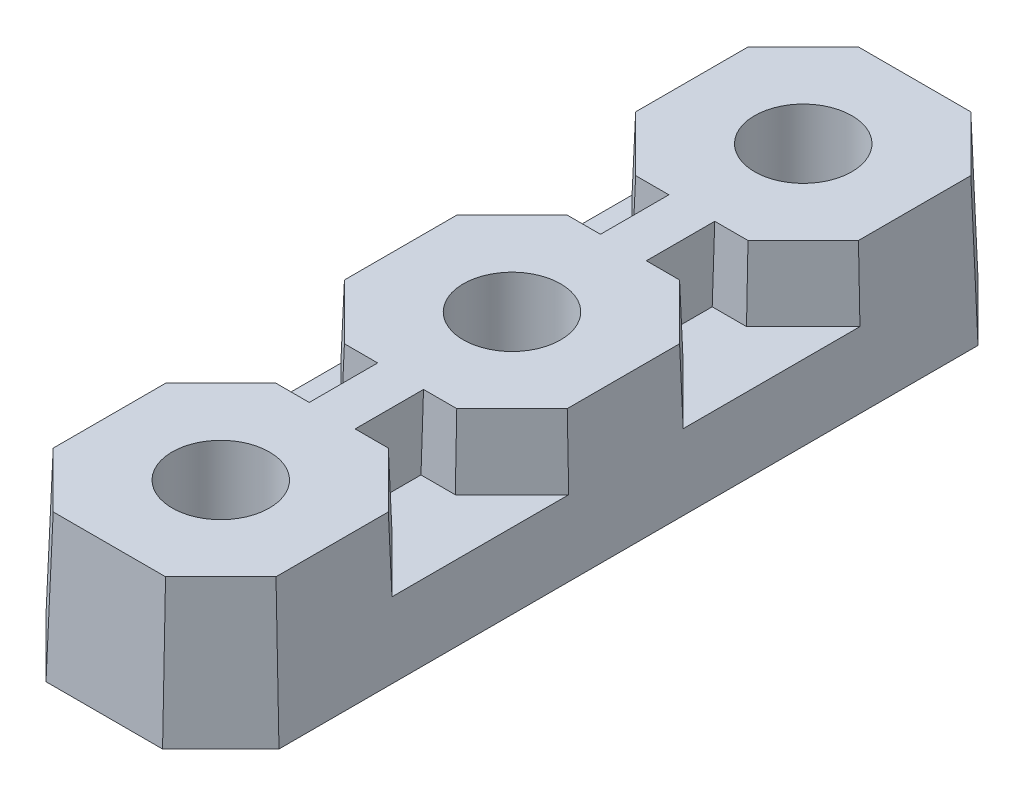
ISO-10303-21;
HEADER;
FILE_DESCRIPTION(('STEP AP214'),'2;1');
FILE_NAME('part.step','',(''),(''),'','','');
FILE_SCHEMA(('AUTOMOTIVE_DESIGN { 1 0 10303 214 1 1 1 1 }'));
ENDSEC;
DATA;
#1=APPLICATION_CONTEXT('core data for automotive mechanical design processes');
#2=APPLICATION_PROTOCOL_DEFINITION('international standard','automotive_design',2000,#1);
#3=PRODUCT_CONTEXT('',#1,'mechanical');
#4=PRODUCT('Part','Part','',(#3));
#5=PRODUCT_RELATED_PRODUCT_CATEGORY('part','',(#4));
#6=PRODUCT_DEFINITION_FORMATION('','',#4);
#7=PRODUCT_DEFINITION_CONTEXT('part definition',#1,'design');
#8=PRODUCT_DEFINITION('design','',#6,#7);
#9=PRODUCT_DEFINITION_SHAPE('','',#8);
#10=(LENGTH_UNIT() NAMED_UNIT(*) SI_UNIT(.MILLI.,.METRE.));
#11=(NAMED_UNIT(*) PLANE_ANGLE_UNIT() SI_UNIT($,.RADIAN.));
#12=(NAMED_UNIT(*) SI_UNIT($,.STERADIAN.) SOLID_ANGLE_UNIT());
#13=UNCERTAINTY_MEASURE_WITH_UNIT(LENGTH_MEASURE(1.E-05),#10,'distance_accuracy_value','');
#14=(GEOMETRIC_REPRESENTATION_CONTEXT(3) GLOBAL_UNCERTAINTY_ASSIGNED_CONTEXT((#13)) GLOBAL_UNIT_ASSIGNED_CONTEXT((#10,
#11,#12)) REPRESENTATION_CONTEXT('',''));
#15=CARTESIAN_POINT('',(0.,0.,0.));
#16=DIRECTION('',(0.,0.,1.));
#17=DIRECTION('',(1.,0.,0.));
#18=AXIS2_PLACEMENT_3D('',#15,#16,#17);
#19=CARTESIAN_POINT('',(-5.08000000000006,0.,17.7799999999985));
#20=DIRECTION('',(0.,-1.,0.));
#21=DIRECTION('',(0.,0.,-1.));
#22=AXIS2_PLACEMENT_3D('',#19,#20,#21);
#23=PLANE('',#22);
#24=DIRECTION('',(-1.,0.,0.));
#25=VECTOR('',#24,1.);
#26=CARTESIAN_POINT('',(2.26059999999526,0.,11.7094048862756));
#27=LINE('',#26,#25);
#28=CARTESIAN_POINT('',(2.26059999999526,0.,11.7094048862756));
#29=VERTEX_POINT('',#28);
#30=CARTESIAN_POINT('',(2.08836816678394,0.,11.7094048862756));
#31=VERTEX_POINT('',#30);
#32=EDGE_CURVE('E1531',#29,#31,#27,.T.);
#33=ORIENTED_EDGE('',*,*,#32,.F.);
#34=DIRECTION('',(0.,0.,1.));
#35=VECTOR('',#34,1.);
#36=CARTESIAN_POINT('',(2.26059999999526,0.,10.4394048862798));
#37=LINE('',#36,#35);
#38=CARTESIAN_POINT('',(2.26059999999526,0.,10.9391002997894));
#39=VERTEX_POINT('',#38);
#40=EDGE_CURVE('E737',#39,#29,#37,.T.);
#41=ORIENTED_EDGE('',*,*,#40,.F.);
#42=CARTESIAN_POINT('',(1.76029522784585,0.,10.9397096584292));
#43=DIRECTION('',(0.,-1.,0.));
#44=DIRECTION('',(0.707106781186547,0.,-0.707106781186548));
#45=AXIS2_PLACEMENT_3D('',#42,#43,#44);
#46=ELLIPSE('',#45,0.500609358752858,0.5);
#47=CARTESIAN_POINT('',(1.76090458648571,0.,10.4394048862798));
#48=VERTEX_POINT('',#47);
#49=EDGE_CURVE('E1497',#39,#48,#46,.F.);
#50=ORIENTED_EDGE('',*,*,#49,.T.);
#51=DIRECTION('',(1.,0.,0.));
#52=VECTOR('',#51,1.);
#53=CARTESIAN_POINT('',(0.990599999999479,0.,10.4394048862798));
#54=LINE('',#53,#52);
#55=CARTESIAN_POINT('',(0.99059999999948,0.,10.4394048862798));
#56=VERTEX_POINT('',#55);
#57=EDGE_CURVE('E1538',#56,#48,#54,.T.);
#58=ORIENTED_EDGE('',*,*,#57,.F.);
#59=DIRECTION('',(0.,0.,-1.));
#60=VECTOR('',#59,1.);
#61=CARTESIAN_POINT('',(0.990599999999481,0.,10.6116367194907));
#62=LINE('',#61,#60);
#63=CARTESIAN_POINT('',(0.990599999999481,0.,10.6116367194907));
#64=VERTEX_POINT('',#63);
#65=EDGE_CURVE('E1535',#64,#56,#62,.T.);
#66=ORIENTED_EDGE('',*,*,#65,.F.);
#67=CARTESIAN_POINT('',(0.,0.,12.7000048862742));
#68=DIRECTION('',(0.,1.,0.));
#69=DIRECTION('',(0.,0.,-1.));
#70=AXIS2_PLACEMENT_3D('',#67,#68,#69);
#71=CIRCLE('',#70,2.3114000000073);
#72=EDGE_CURVE('E1533',#31,#64,#71,.T.);
#73=ORIENTED_EDGE('',*,*,#72,.F.);
#74=EDGE_LOOP('',(#33,#41,#50,#58,#66,#73));
#75=FACE_BOUND('',#74,.T.);
#76=DIRECTION('',(1.,0.,0.));
#77=VECTOR('',#76,1.);
#78=CARTESIAN_POINT('',(-2.26059999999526,0.,13.6906048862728));
#79=LINE('',#78,#77);
#80=CARTESIAN_POINT('',(-2.26059999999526,0.,13.6906048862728));
#81=VERTEX_POINT('',#80);
#82=CARTESIAN_POINT('',(-2.08836816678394,0.,13.6906048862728));
#83=VERTEX_POINT('',#82);
#84=EDGE_CURVE('E1566',#81,#83,#79,.T.);
#85=ORIENTED_EDGE('',*,*,#84,.F.);
#86=DIRECTION('',(0.,0.,-1.));
#87=VECTOR('',#86,1.);
#88=CARTESIAN_POINT('',(-2.26059999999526,0.,14.9606048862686));
#89=LINE('',#88,#87);
#90=CARTESIAN_POINT('',(-2.26059999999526,0.,14.460909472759));
#91=VERTEX_POINT('',#90);
#92=EDGE_CURVE('E1563',#91,#81,#89,.T.);
#93=ORIENTED_EDGE('',*,*,#92,.F.);
#94=CARTESIAN_POINT('',(-1.76029522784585,0.,14.4603001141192));
#95=DIRECTION('',(0.,-1.,0.));
#96=DIRECTION('',(-0.707106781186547,0.,0.707106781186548));
#97=AXIS2_PLACEMENT_3D('',#94,#95,#96);
#98=ELLIPSE('',#97,0.500609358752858,0.5);
#99=CARTESIAN_POINT('',(-1.76090458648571,0.,14.9606048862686));
#100=VERTEX_POINT('',#99);
#101=EDGE_CURVE('E11',#91,#100,#98,.F.);
#102=ORIENTED_EDGE('',*,*,#101,.T.);
#103=DIRECTION('',(-1.,0.,0.));
#104=VECTOR('',#103,1.);
#105=CARTESIAN_POINT('',(-0.99059999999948,0.,14.9606048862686));
#106=LINE('',#105,#104);
#107=CARTESIAN_POINT('',(-0.99059999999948,0.,14.9606048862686));
#108=VERTEX_POINT('',#107);
#109=EDGE_CURVE('E1580',#108,#100,#106,.T.);
#110=ORIENTED_EDGE('',*,*,#109,.F.);
#111=DIRECTION('',(0.,0.,1.));
#112=VECTOR('',#111,1.);
#113=CARTESIAN_POINT('',(-0.990599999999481,0.,14.7883730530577));
#114=LINE('',#113,#112);
#115=CARTESIAN_POINT('',(-0.990599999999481,0.,14.7883730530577));
#116=VERTEX_POINT('',#115);
#117=EDGE_CURVE('E1577',#116,#108,#114,.T.);
#118=ORIENTED_EDGE('',*,*,#117,.F.);
#119=CARTESIAN_POINT('',(0.,0.,12.7000048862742));
#120=DIRECTION('',(0.,1.,0.));
#121=DIRECTION('',(0.,0.,-1.));
#122=AXIS2_PLACEMENT_3D('',#119,#120,#121);
#123=CIRCLE('',#122,2.3114000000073);
#124=EDGE_CURVE('E1570',#83,#116,#123,.T.);
#125=ORIENTED_EDGE('',*,*,#124,.F.);
#126=EDGE_LOOP('',(#85,#93,#102,#110,#118,#125));
#127=FACE_BOUND('',#126,.T.);
#128=DIRECTION('',(-1.,0.,0.));
#129=VECTOR('',#128,1.);
#130=CARTESIAN_POINT('',(2.26059999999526,0.,-13.6905951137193));
#131=LINE('',#130,#129);
#132=CARTESIAN_POINT('',(2.26059999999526,0.,-13.6905951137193));
#133=VERTEX_POINT('',#132);
#134=CARTESIAN_POINT('',(2.08836816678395,0.,-13.6905951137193));
#135=VERTEX_POINT('',#134);
#136=EDGE_CURVE('E1605',#133,#135,#131,.T.);
#137=ORIENTED_EDGE('',*,*,#136,.F.);
#138=DIRECTION('',(0.,0.,1.));
#139=VECTOR('',#138,1.);
#140=CARTESIAN_POINT('',(2.26059999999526,0.,-14.9605951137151));
#141=LINE('',#140,#139);
#142=CARTESIAN_POINT('',(2.26059999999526,0.,-14.4608997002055));
#143=VERTEX_POINT('',#142);
#144=EDGE_CURVE('E1602',#143,#133,#141,.T.);
#145=ORIENTED_EDGE('',*,*,#144,.F.);
#146=CARTESIAN_POINT('',(1.76029522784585,0.,-14.4602903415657));
#147=DIRECTION('',(0.,-1.,0.));
#148=DIRECTION('',(0.707106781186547,0.,-0.707106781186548));
#149=AXIS2_PLACEMENT_3D('',#146,#147,#148);
#150=ELLIPSE('',#149,0.500609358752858,0.5);
#151=CARTESIAN_POINT('',(1.76090458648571,0.,-14.9605951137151));
#152=VERTEX_POINT('',#151);
#153=EDGE_CURVE('E1505',#143,#152,#150,.F.);
#154=ORIENTED_EDGE('',*,*,#153,.T.);
#155=DIRECTION('',(1.,0.,0.));
#156=VECTOR('',#155,1.);
#157=CARTESIAN_POINT('',(0.990599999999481,0.,-14.9605951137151));
#158=LINE('',#157,#156);
#159=CARTESIAN_POINT('',(0.990599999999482,0.,-14.9605951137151));
#160=VERTEX_POINT('',#159);
#161=EDGE_CURVE('E1621',#160,#152,#158,.T.);
#162=ORIENTED_EDGE('',*,*,#161,.F.);
#163=DIRECTION('',(0.,0.,-1.));
#164=VECTOR('',#163,1.);
#165=CARTESIAN_POINT('',(0.990599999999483,0.,-14.7883632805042));
#166=LINE('',#165,#164);
#167=CARTESIAN_POINT('',(0.990599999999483,0.,-14.7883632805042));
#168=VERTEX_POINT('',#167);
#169=EDGE_CURVE('E1618',#168,#160,#166,.T.);
#170=ORIENTED_EDGE('',*,*,#169,.F.);
#171=CARTESIAN_POINT('',(0.,0.,-12.6999951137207));
#172=DIRECTION('',(0.,1.,0.));
#173=DIRECTION('',(0.,0.,-1.));
#174=AXIS2_PLACEMENT_3D('',#171,#172,#173);
#175=CIRCLE('',#174,2.3114000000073);
#176=EDGE_CURVE('E1611',#135,#168,#175,.T.);
#177=ORIENTED_EDGE('',*,*,#176,.F.);
#178=EDGE_LOOP('',(#137,#145,#154,#162,#170,#177));
#179=FACE_BOUND('',#178,.T.);
#180=DIRECTION('',(1.,0.,0.));
#181=VECTOR('',#180,1.);
#182=CARTESIAN_POINT('',(-2.26059999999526,0.,-11.7093951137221));
#183=LINE('',#182,#181);
#184=CARTESIAN_POINT('',(-2.26059999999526,0.,-11.7093951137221));
#185=VERTEX_POINT('',#184);
#186=CARTESIAN_POINT('',(-2.08836816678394,0.,-11.7093951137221));
#187=VERTEX_POINT('',#186);
#188=EDGE_CURVE('E1647',#185,#187,#183,.T.);
#189=ORIENTED_EDGE('',*,*,#188,.F.);
#190=DIRECTION('',(0.,0.,-1.));
#191=VECTOR('',#190,1.);
#192=CARTESIAN_POINT('',(-2.26059999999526,0.,-10.4393951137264));
#193=LINE('',#192,#191);
#194=CARTESIAN_POINT('',(-2.26059999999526,0.,-10.9390905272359));
#195=VERTEX_POINT('',#194);
#196=EDGE_CURVE('E1644',#195,#185,#193,.T.);
#197=ORIENTED_EDGE('',*,*,#196,.F.);
#198=CARTESIAN_POINT('',(-1.76029522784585,0.,-10.9396998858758));
#199=DIRECTION('',(0.,-1.,0.));
#200=DIRECTION('',(-0.707106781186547,0.,0.707106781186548));
#201=AXIS2_PLACEMENT_3D('',#198,#199,#200);
#202=ELLIPSE('',#201,0.500609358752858,0.5);
#203=CARTESIAN_POINT('',(-1.76090458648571,0.,-10.4393951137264));
#204=VERTEX_POINT('',#203);
#205=EDGE_CURVE('E1511',#195,#204,#202,.F.);
#206=ORIENTED_EDGE('',*,*,#205,.T.);
#207=DIRECTION('',(-1.,0.,0.));
#208=VECTOR('',#207,1.);
#209=CARTESIAN_POINT('',(-0.990599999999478,0.,-10.4393951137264));
#210=LINE('',#209,#208);
#211=CARTESIAN_POINT('',(-0.990599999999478,0.,-10.4393951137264));
#212=VERTEX_POINT('',#211);
#213=EDGE_CURVE('E1663',#212,#204,#210,.T.);
#214=ORIENTED_EDGE('',*,*,#213,.F.);
#215=DIRECTION('',(0.,0.,1.));
#216=VECTOR('',#215,1.);
#217=CARTESIAN_POINT('',(-0.990599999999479,0.,-10.6116269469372));
#218=LINE('',#217,#216);
#219=CARTESIAN_POINT('',(-0.990599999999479,0.,-10.6116269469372));
#220=VERTEX_POINT('',#219);
#221=EDGE_CURVE('E1660',#220,#212,#218,.T.);
#222=ORIENTED_EDGE('',*,*,#221,.F.);
#223=CARTESIAN_POINT('',(0.,0.,-12.6999951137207));
#224=DIRECTION('',(0.,1.,0.));
#225=DIRECTION('',(0.,0.,-1.));
#226=AXIS2_PLACEMENT_3D('',#223,#224,#225);
#227=CIRCLE('',#226,2.3114000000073);
#228=EDGE_CURVE('E1653',#187,#220,#227,.T.);
#229=ORIENTED_EDGE('',*,*,#228,.F.);
#230=EDGE_LOOP('',(#189,#197,#206,#214,#222,#229));
#231=FACE_BOUND('',#230,.T.);
#232=DIRECTION('',(-1.,0.,0.));
#233=VECTOR('',#232,1.);
#234=CARTESIAN_POINT('',(2.26059999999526,0.,-0.990599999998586));
#235=LINE('',#234,#233);
#236=CARTESIAN_POINT('',(2.26059999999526,0.,-0.990599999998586));
#237=VERTEX_POINT('',#236);
#238=CARTESIAN_POINT('',(2.08836816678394,0.,-0.990599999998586));
#239=VERTEX_POINT('',#238);
#240=EDGE_CURVE('E1689',#237,#239,#235,.T.);
#241=ORIENTED_EDGE('',*,*,#240,.F.);
#242=DIRECTION('',(0.,0.,1.));
#243=VECTOR('',#242,1.);
#244=CARTESIAN_POINT('',(2.26059999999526,0.,-2.26059999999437));
#245=LINE('',#244,#243);
#246=CARTESIAN_POINT('',(2.26059999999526,0.,-1.76090458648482));
#247=VERTEX_POINT('',#246);
#248=EDGE_CURVE('E1686',#247,#237,#245,.T.);
#249=ORIENTED_EDGE('',*,*,#248,.F.);
#250=CARTESIAN_POINT('',(1.76029522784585,0.,-1.76029522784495));
#251=DIRECTION('',(0.,-1.,0.));
#252=DIRECTION('',(0.707106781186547,0.,-0.707106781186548));
#253=AXIS2_PLACEMENT_3D('',#250,#251,#252);
#254=ELLIPSE('',#253,0.500609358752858,0.5);
#255=CARTESIAN_POINT('',(1.76090458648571,0.,-2.26059999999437));
#256=VERTEX_POINT('',#255);
#257=EDGE_CURVE('E1501',#247,#256,#254,.F.);
#258=ORIENTED_EDGE('',*,*,#257,.T.);
#259=DIRECTION('',(1.,0.,0.));
#260=VECTOR('',#259,1.);
#261=CARTESIAN_POINT('',(0.990599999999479,0.,-2.26059999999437));
#262=LINE('',#261,#260);
#263=CARTESIAN_POINT('',(0.99059999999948,0.,-2.26059999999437));
#264=VERTEX_POINT('',#263);
#265=EDGE_CURVE('E1705',#264,#256,#262,.T.);
#266=ORIENTED_EDGE('',*,*,#265,.F.);
#267=DIRECTION('',(0.,0.,-1.));
#268=VECTOR('',#267,1.);
#269=CARTESIAN_POINT('',(0.990599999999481,0.,-2.08836816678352));
#270=LINE('',#269,#268);
#271=CARTESIAN_POINT('',(0.990599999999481,0.,-2.08836816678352));
#272=VERTEX_POINT('',#271);
#273=EDGE_CURVE('E1702',#272,#264,#270,.T.);
#274=ORIENTED_EDGE('',*,*,#273,.F.);
#275=CARTESIAN_POINT('',(0.,0.,0.));
#276=DIRECTION('',(0.,1.,0.));
#277=DIRECTION('',(0.,0.,-1.));
#278=AXIS2_PLACEMENT_3D('',#275,#276,#277);
#279=CIRCLE('',#278,2.3114000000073);
#280=EDGE_CURVE('E1695',#239,#272,#279,.T.);
#281=ORIENTED_EDGE('',*,*,#280,.F.);
#282=EDGE_LOOP('',(#241,#249,#258,#266,#274,#281));
#283=FACE_BOUND('',#282,.T.);
#284=DIRECTION('',(1.,0.,0.));
#285=VECTOR('',#284,1.);
#286=CARTESIAN_POINT('',(-2.26059999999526,0.,0.990599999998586));
#287=LINE('',#286,#285);
#288=CARTESIAN_POINT('',(-2.26059999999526,0.,0.990599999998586));
#289=VERTEX_POINT('',#288);
#290=CARTESIAN_POINT('',(-2.08836816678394,0.,0.990599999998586));
#291=VERTEX_POINT('',#290);
#292=EDGE_CURVE('E1731',#289,#291,#287,.T.);
#293=ORIENTED_EDGE('',*,*,#292,.F.);
#294=DIRECTION('',(0.,0.,-1.));
#295=VECTOR('',#294,1.);
#296=CARTESIAN_POINT('',(-2.26059999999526,0.,2.26059999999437));
#297=LINE('',#296,#295);
#298=CARTESIAN_POINT('',(-2.26059999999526,0.,1.76090458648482));
#299=VERTEX_POINT('',#298);
#300=EDGE_CURVE('E1728',#299,#289,#297,.T.);
#301=ORIENTED_EDGE('',*,*,#300,.F.);
#302=CARTESIAN_POINT('',(-1.76029522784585,0.,1.76029522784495));
#303=DIRECTION('',(0.,-1.,0.));
#304=DIRECTION('',(-0.707106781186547,0.,0.707106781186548));
#305=AXIS2_PLACEMENT_3D('',#302,#303,#304);
#306=ELLIPSE('',#305,0.500609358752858,0.5);
#307=CARTESIAN_POINT('',(-1.76090458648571,0.,2.26059999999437));
#308=VERTEX_POINT('',#307);
#309=EDGE_CURVE('E1515',#299,#308,#306,.F.);
#310=ORIENTED_EDGE('',*,*,#309,.T.);
#311=DIRECTION('',(-1.,0.,0.));
#312=VECTOR('',#311,1.);
#313=CARTESIAN_POINT('',(-0.99059999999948,0.,2.26059999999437));
#314=LINE('',#313,#312);
#315=CARTESIAN_POINT('',(-0.99059999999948,0.,2.26059999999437));
#316=VERTEX_POINT('',#315);
#317=EDGE_CURVE('E1747',#316,#308,#314,.T.);
#318=ORIENTED_EDGE('',*,*,#317,.F.);
#319=DIRECTION('',(0.,0.,1.));
#320=VECTOR('',#319,1.);
#321=CARTESIAN_POINT('',(-0.990599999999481,0.,2.08836816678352));
#322=LINE('',#321,#320);
#323=CARTESIAN_POINT('',(-0.990599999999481,0.,2.08836816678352));
#324=VERTEX_POINT('',#323);
#325=EDGE_CURVE('E1744',#324,#316,#322,.T.);
#326=ORIENTED_EDGE('',*,*,#325,.F.);
#327=CARTESIAN_POINT('',(0.,0.,0.));
#328=DIRECTION('',(0.,1.,0.));
#329=DIRECTION('',(0.,0.,-1.));
#330=AXIS2_PLACEMENT_3D('',#327,#328,#329);
#331=CIRCLE('',#330,2.3114000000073);
#332=EDGE_CURVE('E1737',#291,#324,#331,.T.);
#333=ORIENTED_EDGE('',*,*,#332,.F.);
#334=EDGE_LOOP('',(#293,#301,#310,#318,#326,#333));
#335=FACE_BOUND('',#334,.T.);
#336=DIRECTION('',(1.,0.,0.));
#337=VECTOR('',#336,1.);
#338=CARTESIAN_POINT('',(-2.5415472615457,0.,17.7799999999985));
#339=LINE('',#338,#337);
#340=CARTESIAN_POINT('',(-2.5415472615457,0.,17.7799999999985));
#341=VERTEX_POINT('',#340);
#342=CARTESIAN_POINT('',(2.5415472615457,0.,17.7799999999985));
#343=VERTEX_POINT('',#342);
#344=EDGE_CURVE('E2011',#341,#343,#339,.T.);
#345=ORIENTED_EDGE('',*,*,#344,.F.);
#346=DIRECTION('',(0.70710678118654,0.,0.707106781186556));
#347=VECTOR('',#346,1.);
#348=CARTESIAN_POINT('',(-5.08000000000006,0.,15.2415472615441));
#349=LINE('',#348,#347);
#350=CARTESIAN_POINT('',(-5.08000000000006,0.,15.2415472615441));
#351=VERTEX_POINT('',#350);
#352=EDGE_CURVE('E2054',#351,#341,#349,.T.);
#353=ORIENTED_EDGE('',*,*,#352,.F.);
#354=DIRECTION('',(0.,0.,1.));
#355=VECTOR('',#354,1.);
#356=CARTESIAN_POINT('',(-5.08000000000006,0.,-15.2415472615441));
#357=LINE('',#356,#355);
#358=CARTESIAN_POINT('',(-5.08000000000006,0.,-15.2415472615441));
#359=VERTEX_POINT('',#358);
#360=EDGE_CURVE('E2052',#359,#351,#357,.T.);
#361=ORIENTED_EDGE('',*,*,#360,.F.);
#362=DIRECTION('',(-0.707106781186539,0.,0.707106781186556));
#363=VECTOR('',#362,1.);
#364=CARTESIAN_POINT('',(-2.5415472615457,0.,-17.7799999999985));
#365=LINE('',#364,#363);
#366=CARTESIAN_POINT('',(-2.5415472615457,0.,-17.7799999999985));
#367=VERTEX_POINT('',#366);
#368=EDGE_CURVE('E2050',#367,#359,#365,.T.);
#369=ORIENTED_EDGE('',*,*,#368,.F.);
#370=DIRECTION('',(-1.,0.,0.));
#371=VECTOR('',#370,1.);
#372=CARTESIAN_POINT('',(2.5415472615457,0.,-17.7799999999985));
#373=LINE('',#372,#371);
#374=CARTESIAN_POINT('',(2.5415472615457,0.,-17.7799999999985));
#375=VERTEX_POINT('',#374);
#376=EDGE_CURVE('E2048',#375,#367,#373,.T.);
#377=ORIENTED_EDGE('',*,*,#376,.F.);
#378=DIRECTION('',(-0.70710678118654,0.,-0.707106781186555));
#379=VECTOR('',#378,1.);
#380=CARTESIAN_POINT('',(5.08000000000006,0.,-15.2415472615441));
#381=LINE('',#380,#379);
#382=CARTESIAN_POINT('',(5.08000000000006,0.,-15.2415472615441));
#383=VERTEX_POINT('',#382);
#384=EDGE_CURVE('E2046',#383,#375,#381,.T.);
#385=ORIENTED_EDGE('',*,*,#384,.F.);
#386=DIRECTION('',(0.,0.,-1.));
#387=VECTOR('',#386,1.);
#388=CARTESIAN_POINT('',(5.08000000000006,0.,15.2415472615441));
#389=LINE('',#388,#387);
#390=CARTESIAN_POINT('',(5.08000000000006,0.,15.2415472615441));
#391=VERTEX_POINT('',#390);
#392=EDGE_CURVE('E2044',#391,#383,#389,.T.);
#393=ORIENTED_EDGE('',*,*,#392,.F.);
#394=DIRECTION('',(0.707106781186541,0.,-0.707106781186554));
#395=VECTOR('',#394,1.);
#396=CARTESIAN_POINT('',(2.5415472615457,0.,17.7799999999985));
#397=LINE('',#396,#395);
#398=EDGE_CURVE('E2016',#343,#391,#397,.T.);
#399=ORIENTED_EDGE('',*,*,#398,.F.);
#400=EDGE_LOOP('',(#345,#353,#361,#369,#377,#385,#393,#399));
#401=FACE_BOUND('',#400,.T.);
#402=CARTESIAN_POINT('',(0.,0.,-12.6999951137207));
#403=DIRECTION('',(0.,-1.,0.));
#404=DIRECTION('',(0.,0.,-1.));
#405=AXIS2_PLACEMENT_3D('',#402,#403,#404);
#406=CIRCLE('',#405,2.1209);
#407=CARTESIAN_POINT('',(0.,0.,-14.8208951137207));
#408=VERTEX_POINT('',#407);
#409=EDGE_CURVE('E1823',#408,#408,#406,.T.);
#410=ORIENTED_EDGE('',*,*,#409,.F.);
#411=EDGE_LOOP('',(#410));
#412=FACE_BOUND('',#411,.T.);
#413=CARTESIAN_POINT('',(0.,0.,0.));
#414=DIRECTION('',(0.,-1.,0.));
#415=DIRECTION('',(0.,0.,-1.));
#416=AXIS2_PLACEMENT_3D('',#413,#414,#415);
#417=CIRCLE('',#416,2.1209);
#418=CARTESIAN_POINT('',(0.,0.,-2.1209));
#419=VERTEX_POINT('',#418);
#420=EDGE_CURVE('E1817',#419,#419,#417,.T.);
#421=ORIENTED_EDGE('',*,*,#420,.F.);
#422=EDGE_LOOP('',(#421));
#423=FACE_BOUND('',#422,.T.);
#424=CARTESIAN_POINT('',(0.,0.,12.7000048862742));
#425=DIRECTION('',(0.,-1.,0.));
#426=DIRECTION('',(0.,0.,-1.));
#427=AXIS2_PLACEMENT_3D('',#424,#425,#426);
#428=CIRCLE('',#427,2.1209);
#429=CARTESIAN_POINT('',(0.,0.,10.5791048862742));
#430=VERTEX_POINT('',#429);
#431=EDGE_CURVE('E1805',#430,#430,#428,.T.);
#432=ORIENTED_EDGE('',*,*,#431,.F.);
#433=EDGE_LOOP('',(#432));
#434=FACE_BOUND('',#433,.T.);
#435=DIRECTION('',(0.,0.,-1.));
#436=VECTOR('',#435,1.);
#437=CARTESIAN_POINT('',(-3.59999962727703,0.,10.0500013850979));
#438=LINE('',#437,#436);
#439=CARTESIAN_POINT('',(-3.59999962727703,0.,10.0500013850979));
#440=VERTEX_POINT('',#439);
#441=CARTESIAN_POINT('',(-3.59999962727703,0.,3.84999861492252));
#442=VERTEX_POINT('',#441);
#443=EDGE_CURVE('E1772',#440,#442,#438,.T.);
#444=ORIENTED_EDGE('',*,*,#443,.F.);
#445=DIRECTION('',(-1.,0.,0.));
#446=VECTOR('',#445,1.);
#447=CARTESIAN_POINT('',(3.59999962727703,0.,10.0500013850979));
#448=LINE('',#447,#446);
#449=CARTESIAN_POINT('',(3.59999962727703,0.,10.0500013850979));
#450=VERTEX_POINT('',#449);
#451=EDGE_CURVE('E1784',#450,#440,#448,.T.);
#452=ORIENTED_EDGE('',*,*,#451,.F.);
#453=DIRECTION('',(0.,0.,1.));
#454=VECTOR('',#453,1.);
#455=CARTESIAN_POINT('',(3.59999962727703,0.,3.84999861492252));
#456=LINE('',#455,#454);
#457=CARTESIAN_POINT('',(3.59999962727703,0.,3.84999861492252));
#458=VERTEX_POINT('',#457);
#459=EDGE_CURVE('E1798',#458,#450,#456,.T.);
#460=ORIENTED_EDGE('',*,*,#459,.F.);
#461=DIRECTION('',(1.,0.,0.));
#462=VECTOR('',#461,1.);
#463=CARTESIAN_POINT('',(-3.59999962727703,0.,3.84999861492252));
#464=LINE('',#463,#462);
#465=EDGE_CURVE('E1795',#442,#458,#464,.T.);
#466=ORIENTED_EDGE('',*,*,#465,.F.);
#467=EDGE_LOOP('',(#444,#452,#460,#466));
#468=FACE_BOUND('',#467,.T.);
#469=DIRECTION('',(-1.,0.,0.));
#470=VECTOR('',#469,1.);
#471=CARTESIAN_POINT('',(3.59999962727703,0.,-10.0500013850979));
#472=LINE('',#471,#470);
#473=CARTESIAN_POINT('',(3.59999962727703,0.,-10.0500013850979));
#474=VERTEX_POINT('',#473);
#475=CARTESIAN_POINT('',(-3.59999962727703,0.,-10.0500013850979));
#476=VERTEX_POINT('',#475);
#477=EDGE_CURVE('E1753',#474,#476,#472,.T.);
#478=ORIENTED_EDGE('',*,*,#477,.T.);
#479=DIRECTION('',(0.,0.,1.));
#480=VECTOR('',#479,1.);
#481=CARTESIAN_POINT('',(-3.59999962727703,0.,-10.0500013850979));
#482=LINE('',#481,#480);
#483=CARTESIAN_POINT('',(-3.59999962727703,0.,-3.84999861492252));
#484=VERTEX_POINT('',#483);
#485=EDGE_CURVE('E1749',#476,#484,#482,.T.);
#486=ORIENTED_EDGE('',*,*,#485,.T.);
#487=DIRECTION('',(1.,0.,0.));
#488=VECTOR('',#487,1.);
#489=CARTESIAN_POINT('',(-3.59999962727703,0.,-3.84999861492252));
#490=LINE('',#489,#488);
#491=CARTESIAN_POINT('',(3.59999962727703,0.,-3.84999861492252));
#492=VERTEX_POINT('',#491);
#493=EDGE_CURVE('E1766',#484,#492,#490,.T.);
#494=ORIENTED_EDGE('',*,*,#493,.T.);
#495=DIRECTION('',(0.,0.,-1.));
#496=VECTOR('',#495,1.);
#497=CARTESIAN_POINT('',(3.59999962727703,0.,-3.84999861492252));
#498=LINE('',#497,#496);
#499=EDGE_CURVE('E1758',#492,#474,#498,.T.);
#500=ORIENTED_EDGE('',*,*,#499,.T.);
#501=EDGE_LOOP('',(#478,#486,#494,#500));
#502=FACE_BOUND('',#501,.T.);
#503=DIRECTION('',(0.,0.,1.));
#504=VECTOR('',#503,1.);
#505=CARTESIAN_POINT('',(-0.990599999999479,0.,-2.26059999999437));
#506=LINE('',#505,#504);
#507=CARTESIAN_POINT('',(-0.990599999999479,0.,-2.26059999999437));
#508=VERTEX_POINT('',#507);
#509=CARTESIAN_POINT('',(-0.990599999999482,0.,-2.08836816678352));
#510=VERTEX_POINT('',#509);
#511=EDGE_CURVE('E1710',#508,#510,#506,.T.);
#512=ORIENTED_EDGE('',*,*,#511,.F.);
#513=DIRECTION('',(1.,0.,0.));
#514=VECTOR('',#513,1.);
#515=CARTESIAN_POINT('',(-2.26059999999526,0.,-2.26059999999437));
#516=LINE('',#515,#514);
#517=CARTESIAN_POINT('',(-1.76090458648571,0.,-2.26059999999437));
#518=VERTEX_POINT('',#517);
#519=EDGE_CURVE('E1707',#518,#508,#516,.T.);
#520=ORIENTED_EDGE('',*,*,#519,.F.);
#521=CARTESIAN_POINT('',(-1.76029522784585,0.,-1.76029522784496));
#522=DIRECTION('',(0.,-1.,0.));
#523=DIRECTION('',(-0.707106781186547,0.,-0.707106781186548));
#524=AXIS2_PLACEMENT_3D('',#521,#522,#523);
#525=ELLIPSE('',#524,0.500609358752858,0.5);
#526=CARTESIAN_POINT('',(-2.26059999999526,0.,-1.76090458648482));
#527=VERTEX_POINT('',#526);
#528=EDGE_CURVE('E1503',#518,#527,#525,.F.);
#529=ORIENTED_EDGE('',*,*,#528,.T.);
#530=DIRECTION('',(0.,0.,-1.));
#531=VECTOR('',#530,1.);
#532=CARTESIAN_POINT('',(-2.26059999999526,0.,-0.990599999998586));
#533=LINE('',#532,#531);
#534=CARTESIAN_POINT('',(-2.26059999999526,0.,-0.990599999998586));
#535=VERTEX_POINT('',#534);
#536=EDGE_CURVE('E1726',#535,#527,#533,.T.);
#537=ORIENTED_EDGE('',*,*,#536,.F.);
#538=DIRECTION('',(-1.,0.,0.));
#539=VECTOR('',#538,1.);
#540=CARTESIAN_POINT('',(-2.08836816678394,0.,-0.990599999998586));
#541=LINE('',#540,#539);
#542=CARTESIAN_POINT('',(-2.08836816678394,0.,-0.990599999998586));
#543=VERTEX_POINT('',#542);
#544=EDGE_CURVE('E1723',#543,#535,#541,.T.);
#545=ORIENTED_EDGE('',*,*,#544,.F.);
#546=CARTESIAN_POINT('',(0.,0.,0.));
#547=DIRECTION('',(0.,1.,0.));
#548=DIRECTION('',(0.,0.,-1.));
#549=AXIS2_PLACEMENT_3D('',#546,#547,#548);
#550=CIRCLE('',#549,2.3114000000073);
#551=EDGE_CURVE('E1716',#510,#543,#550,.T.);
#552=ORIENTED_EDGE('',*,*,#551,.F.);
#553=EDGE_LOOP('',(#512,#520,#529,#537,#545,#552));
#554=FACE_BOUND('',#553,.T.);
#555=DIRECTION('',(0.,0.,-1.));
#556=VECTOR('',#555,1.);
#557=CARTESIAN_POINT('',(0.990599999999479,0.,2.26059999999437));
#558=LINE('',#557,#556);
#559=CARTESIAN_POINT('',(0.990599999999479,0.,2.26059999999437));
#560=VERTEX_POINT('',#559);
#561=CARTESIAN_POINT('',(0.990599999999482,0.,2.08836816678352));
#562=VERTEX_POINT('',#561);
#563=EDGE_CURVE('E1668',#560,#562,#558,.T.);
#564=ORIENTED_EDGE('',*,*,#563,.F.);
#565=DIRECTION('',(-1.,0.,0.));
#566=VECTOR('',#565,1.);
#567=CARTESIAN_POINT('',(2.26059999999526,0.,2.26059999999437));
#568=LINE('',#567,#566);
#569=CARTESIAN_POINT('',(1.76090458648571,0.,2.26059999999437));
#570=VERTEX_POINT('',#569);
#571=EDGE_CURVE('E1665',#570,#560,#568,.T.);
#572=ORIENTED_EDGE('',*,*,#571,.F.);
#573=CARTESIAN_POINT('',(1.76029522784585,0.,1.76029522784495));
#574=DIRECTION('',(0.,-1.,0.));
#575=DIRECTION('',(0.707106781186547,0.,0.707106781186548));
#576=AXIS2_PLACEMENT_3D('',#573,#574,#575);
#577=ELLIPSE('',#576,0.500609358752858,0.5);
#578=CARTESIAN_POINT('',(2.26059999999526,0.,1.76090458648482));
#579=VERTEX_POINT('',#578);
#580=EDGE_CURVE('E1513',#570,#579,#577,.F.);
#581=ORIENTED_EDGE('',*,*,#580,.T.);
#582=DIRECTION('',(0.,0.,1.));
#583=VECTOR('',#582,1.);
#584=CARTESIAN_POINT('',(2.26059999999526,0.,0.990599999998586));
#585=LINE('',#584,#583);
#586=CARTESIAN_POINT('',(2.26059999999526,0.,0.990599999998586));
#587=VERTEX_POINT('',#586);
#588=EDGE_CURVE('E1684',#587,#579,#585,.T.);
#589=ORIENTED_EDGE('',*,*,#588,.F.);
#590=DIRECTION('',(1.,0.,0.));
#591=VECTOR('',#590,1.);
#592=CARTESIAN_POINT('',(2.08836816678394,0.,0.990599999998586));
#593=LINE('',#592,#591);
#594=CARTESIAN_POINT('',(2.08836816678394,0.,0.990599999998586));
#595=VERTEX_POINT('',#594);
#596=EDGE_CURVE('E1681',#595,#587,#593,.T.);
#597=ORIENTED_EDGE('',*,*,#596,.F.);
#598=CARTESIAN_POINT('',(0.,0.,0.));
#599=DIRECTION('',(0.,1.,0.));
#600=DIRECTION('',(0.,0.,-1.));
#601=AXIS2_PLACEMENT_3D('',#598,#599,#600);
#602=CIRCLE('',#601,2.3114000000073);
#603=EDGE_CURVE('E1674',#562,#595,#602,.T.);
#604=ORIENTED_EDGE('',*,*,#603,.F.);
#605=EDGE_LOOP('',(#564,#572,#581,#589,#597,#604));
#606=FACE_BOUND('',#605,.T.);
#607=DIRECTION('',(0.,0.,1.));
#608=VECTOR('',#607,1.);
#609=CARTESIAN_POINT('',(-0.990599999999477,0.,-14.9605951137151));
#610=LINE('',#609,#608);
#611=CARTESIAN_POINT('',(-0.990599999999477,0.,-14.9605951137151));
#612=VERTEX_POINT('',#611);
#613=CARTESIAN_POINT('',(-0.99059999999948,0.,-14.7883632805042));
#614=VERTEX_POINT('',#613);
#615=EDGE_CURVE('E1626',#612,#614,#610,.T.);
#616=ORIENTED_EDGE('',*,*,#615,.F.);
#617=DIRECTION('',(1.,0.,0.));
#618=VECTOR('',#617,1.);
#619=CARTESIAN_POINT('',(-2.26059999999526,0.,-14.9605951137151));
#620=LINE('',#619,#618);
#621=CARTESIAN_POINT('',(-1.76090458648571,0.,-14.9605951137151));
#622=VERTEX_POINT('',#621);
#623=EDGE_CURVE('E1623',#622,#612,#620,.T.);
#624=ORIENTED_EDGE('',*,*,#623,.F.);
#625=CARTESIAN_POINT('',(-1.76029522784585,0.,-14.4602903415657));
#626=DIRECTION('',(0.,-1.,0.));
#627=DIRECTION('',(-0.707106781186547,0.,-0.707106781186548));
#628=AXIS2_PLACEMENT_3D('',#625,#626,#627);
#629=ELLIPSE('',#628,0.500609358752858,0.5);
#630=CARTESIAN_POINT('',(-2.26059999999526,0.,-14.4608997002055));
#631=VERTEX_POINT('',#630);
#632=EDGE_CURVE('E1507',#622,#631,#629,.F.);
#633=ORIENTED_EDGE('',*,*,#632,.T.);
#634=DIRECTION('',(0.,0.,-1.));
#635=VECTOR('',#634,1.);
#636=CARTESIAN_POINT('',(-2.26059999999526,0.,-13.6905951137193));
#637=LINE('',#636,#635);
#638=CARTESIAN_POINT('',(-2.26059999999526,0.,-13.6905951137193));
#639=VERTEX_POINT('',#638);
#640=EDGE_CURVE('E1642',#639,#631,#637,.T.);
#641=ORIENTED_EDGE('',*,*,#640,.F.);
#642=DIRECTION('',(-1.,0.,0.));
#643=VECTOR('',#642,1.);
#644=CARTESIAN_POINT('',(-2.08836816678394,0.,-13.6905951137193));
#645=LINE('',#644,#643);
#646=CARTESIAN_POINT('',(-2.08836816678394,0.,-13.6905951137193));
#647=VERTEX_POINT('',#646);
#648=EDGE_CURVE('E1639',#647,#639,#645,.T.);
#649=ORIENTED_EDGE('',*,*,#648,.F.);
#650=CARTESIAN_POINT('',(0.,0.,-12.6999951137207));
#651=DIRECTION('',(0.,1.,0.));
#652=DIRECTION('',(0.,0.,-1.));
#653=AXIS2_PLACEMENT_3D('',#650,#651,#652);
#654=CIRCLE('',#653,2.3114000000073);
#655=EDGE_CURVE('E1632',#614,#647,#654,.T.);
#656=ORIENTED_EDGE('',*,*,#655,.F.);
#657=EDGE_LOOP('',(#616,#624,#633,#641,#649,#656));
#658=FACE_BOUND('',#657,.T.);
#659=DIRECTION('',(0.,0.,-1.));
#660=VECTOR('',#659,1.);
#661=CARTESIAN_POINT('',(0.990599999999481,0.,-10.4393951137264));
#662=LINE('',#661,#660);
#663=CARTESIAN_POINT('',(0.990599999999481,0.,-10.4393951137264));
#664=VERTEX_POINT('',#663);
#665=CARTESIAN_POINT('',(0.990599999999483,0.,-10.6116269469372));
#666=VERTEX_POINT('',#665);
#667=EDGE_CURVE('E1584',#664,#666,#662,.T.);
#668=ORIENTED_EDGE('',*,*,#667,.F.);
#669=DIRECTION('',(-1.,0.,0.));
#670=VECTOR('',#669,1.);
#671=CARTESIAN_POINT('',(2.26059999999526,0.,-10.4393951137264));
#672=LINE('',#671,#670);
#673=CARTESIAN_POINT('',(1.76090458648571,0.,-10.4393951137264));
#674=VERTEX_POINT('',#673);
#675=EDGE_CURVE('E1581',#674,#664,#672,.T.);
#676=ORIENTED_EDGE('',*,*,#675,.F.);
#677=CARTESIAN_POINT('',(1.76029522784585,0.,-10.9396998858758));
#678=DIRECTION('',(0.,-1.,0.));
#679=DIRECTION('',(0.707106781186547,0.,0.707106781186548));
#680=AXIS2_PLACEMENT_3D('',#677,#678,#679);
#681=ELLIPSE('',#680,0.500609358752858,0.5);
#682=CARTESIAN_POINT('',(2.26059999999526,0.,-10.9390905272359));
#683=VERTEX_POINT('',#682);
#684=EDGE_CURVE('E1509',#674,#683,#681,.F.);
#685=ORIENTED_EDGE('',*,*,#684,.T.);
#686=DIRECTION('',(0.,0.,1.));
#687=VECTOR('',#686,1.);
#688=CARTESIAN_POINT('',(2.26059999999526,0.,-11.7093951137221));
#689=LINE('',#688,#687);
#690=CARTESIAN_POINT('',(2.26059999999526,0.,-11.7093951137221));
#691=VERTEX_POINT('',#690);
#692=EDGE_CURVE('E1600',#691,#683,#689,.T.);
#693=ORIENTED_EDGE('',*,*,#692,.F.);
#694=DIRECTION('',(1.,0.,0.));
#695=VECTOR('',#694,1.);
#696=CARTESIAN_POINT('',(2.08836816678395,0.,-11.7093951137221));
#697=LINE('',#696,#695);
#698=CARTESIAN_POINT('',(2.08836816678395,0.,-11.7093951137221));
#699=VERTEX_POINT('',#698);
#700=EDGE_CURVE('E1597',#699,#691,#697,.T.);
#701=ORIENTED_EDGE('',*,*,#700,.F.);
#702=CARTESIAN_POINT('',(0.,0.,-12.6999951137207));
#703=DIRECTION('',(0.,1.,0.));
#704=DIRECTION('',(0.,0.,-1.));
#705=AXIS2_PLACEMENT_3D('',#702,#703,#704);
#706=CIRCLE('',#705,2.3114000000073);
#707=EDGE_CURVE('E1590',#666,#699,#706,.T.);
#708=ORIENTED_EDGE('',*,*,#707,.F.);
#709=EDGE_LOOP('',(#668,#676,#685,#693,#701,#708));
#710=FACE_BOUND('',#709,.T.);
#711=DIRECTION('',(0.,0.,1.));
#712=VECTOR('',#711,1.);
#713=CARTESIAN_POINT('',(-0.990599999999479,0.,10.4394048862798));
#714=LINE('',#713,#712);
#715=CARTESIAN_POINT('',(-0.990599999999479,0.,10.4394048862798));
#716=VERTEX_POINT('',#715);
#717=CARTESIAN_POINT('',(-0.990599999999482,0.,10.6116367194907));
#718=VERTEX_POINT('',#717);
#719=EDGE_CURVE('E1545',#716,#718,#714,.T.);
#720=ORIENTED_EDGE('',*,*,#719,.F.);
#721=DIRECTION('',(1.,0.,0.));
#722=VECTOR('',#721,1.);
#723=CARTESIAN_POINT('',(-2.26059999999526,0.,10.4394048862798));
#724=LINE('',#723,#722);
#725=CARTESIAN_POINT('',(-1.76090458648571,0.,10.4394048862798));
#726=VERTEX_POINT('',#725);
#727=EDGE_CURVE('E1541',#726,#716,#724,.T.);
#728=ORIENTED_EDGE('',*,*,#727,.F.);
#729=CARTESIAN_POINT('',(-1.76029522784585,0.,10.9397096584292));
#730=DIRECTION('',(0.,-1.,0.));
#731=DIRECTION('',(-0.707106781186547,0.,-0.707106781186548));
#732=AXIS2_PLACEMENT_3D('',#729,#730,#731);
#733=ELLIPSE('',#732,0.500609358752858,0.5);
#734=CARTESIAN_POINT('',(-2.26059999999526,0.,10.9391002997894));
#735=VERTEX_POINT('',#734);
#736=EDGE_CURVE('E1499',#726,#735,#733,.F.);
#737=ORIENTED_EDGE('',*,*,#736,.T.);
#738=DIRECTION('',(0.,0.,-1.));
#739=VECTOR('',#738,1.);
#740=CARTESIAN_POINT('',(-2.26059999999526,0.,11.7094048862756));
#741=LINE('',#740,#739);
#742=CARTESIAN_POINT('',(-2.26059999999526,0.,11.7094048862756));
#743=VERTEX_POINT('',#742);
#744=EDGE_CURVE('E1561',#743,#735,#741,.T.);
#745=ORIENTED_EDGE('',*,*,#744,.F.);
#746=DIRECTION('',(-1.,0.,0.));
#747=VECTOR('',#746,1.);
#748=CARTESIAN_POINT('',(-2.08836816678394,0.,11.7094048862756));
#749=LINE('',#748,#747);
#750=CARTESIAN_POINT('',(-2.08836816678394,0.,11.7094048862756));
#751=VERTEX_POINT('',#750);
#752=EDGE_CURVE('E1558',#751,#743,#749,.T.);
#753=ORIENTED_EDGE('',*,*,#752,.F.);
#754=CARTESIAN_POINT('',(0.,0.,12.7000048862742));
#755=DIRECTION('',(0.,1.,0.));
#756=DIRECTION('',(0.,0.,-1.));
#757=AXIS2_PLACEMENT_3D('',#754,#755,#756);
#758=CIRCLE('',#757,2.3114000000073);
#759=EDGE_CURVE('E1551',#718,#751,#758,.T.);
#760=ORIENTED_EDGE('',*,*,#759,.F.);
#761=EDGE_LOOP('',(#720,#728,#737,#745,#753,#760));
#762=FACE_BOUND('',#761,.T.);
#763=DIRECTION('',(0.,0.,-1.));
#764=VECTOR('',#763,1.);
#765=CARTESIAN_POINT('',(0.990599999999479,0.,14.9606048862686));
#766=LINE('',#765,#764);
#767=CARTESIAN_POINT('',(0.990599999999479,0.,14.9606048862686));
#768=VERTEX_POINT('',#767);
#769=CARTESIAN_POINT('',(0.990599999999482,0.,14.7883730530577));
#770=VERTEX_POINT('',#769);
#771=EDGE_CURVE('E729',#768,#770,#766,.T.);
#772=ORIENTED_EDGE('',*,*,#771,.F.);
#773=DIRECTION('',(-1.,0.,0.));
#774=VECTOR('',#773,1.);
#775=CARTESIAN_POINT('',(2.26059999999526,0.,14.9606048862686));
#776=LINE('',#775,#774);
#777=CARTESIAN_POINT('',(1.76090458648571,0.,14.9606048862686));
#778=VERTEX_POINT('',#777);
#779=EDGE_CURVE('E720',#778,#768,#776,.T.);
#780=ORIENTED_EDGE('',*,*,#779,.F.);
#781=CARTESIAN_POINT('',(1.76029522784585,0.,14.4603001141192));
#782=DIRECTION('',(0.,-1.,0.));
#783=DIRECTION('',(0.707106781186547,0.,0.707106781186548));
#784=AXIS2_PLACEMENT_3D('',#781,#782,#783);
#785=ELLIPSE('',#784,0.500609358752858,0.5);
#786=CARTESIAN_POINT('',(2.26059999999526,0.,14.460909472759));
#787=VERTEX_POINT('',#786);
#788=EDGE_CURVE('E38',#778,#787,#785,.F.);
#789=ORIENTED_EDGE('',*,*,#788,.T.);
#790=DIRECTION('',(0.,0.,1.));
#791=VECTOR('',#790,1.);
#792=CARTESIAN_POINT('',(2.26059999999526,0.,13.6906048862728));
#793=LINE('',#792,#791);
#794=CARTESIAN_POINT('',(2.26059999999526,0.,13.6906048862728));
#795=VERTEX_POINT('',#794);
#796=EDGE_CURVE('E749',#795,#787,#793,.T.);
#797=ORIENTED_EDGE('',*,*,#796,.F.);
#798=DIRECTION('',(1.,0.,0.));
#799=VECTOR('',#798,1.);
#800=CARTESIAN_POINT('',(2.08836816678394,0.,13.6906048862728));
#801=LINE('',#800,#799);
#802=CARTESIAN_POINT('',(2.08836816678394,0.,13.6906048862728));
#803=VERTEX_POINT('',#802);
#804=EDGE_CURVE('E744',#803,#795,#801,.T.);
#805=ORIENTED_EDGE('',*,*,#804,.F.);
#806=CARTESIAN_POINT('',(0.,0.,12.7000048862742));
#807=DIRECTION('',(0.,1.,0.));
#808=DIRECTION('',(0.,0.,-1.));
#809=AXIS2_PLACEMENT_3D('',#806,#807,#808);
#810=CIRCLE('',#809,2.3114000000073);
#811=EDGE_CURVE('E742',#770,#803,#810,.T.);
#812=ORIENTED_EDGE('',*,*,#811,.F.);
#813=EDGE_LOOP('',(#772,#780,#789,#797,#805,#812));
#814=FACE_BOUND('',#813,.T.);
#815=ADVANCED_FACE('F30',(#75,#127,#179,#231,#283,#335,#401,#412,#423,#434,#468,#502,#554,#606,
#658,#710,#762,#814),#23,.T.);
#816=CARTESIAN_POINT('',(-5.08000000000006,3.175,17.7799999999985));
#817=DIRECTION('',(0.,-1.,0.));
#818=DIRECTION('',(0.,0.,-1.));
#819=AXIS2_PLACEMENT_3D('',#816,#817,#818);
#820=PLANE('',#819);
#821=DIRECTION('',(-1.,0.,0.));
#822=VECTOR('',#821,1.);
#823=CARTESIAN_POINT('',(2.49562197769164,3.175,7.7308734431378));
#824=LINE('',#823,#822);
#825=CARTESIAN_POINT('',(-0.999999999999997,3.175,7.7308734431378));
#826=VERTEX_POINT('',#825);
#827=CARTESIAN_POINT('',(-2.49562197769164,3.175,7.7308734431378));
#828=VERTEX_POINT('',#827);
#829=EDGE_CURVE('E1973',#826,#828,#824,.T.);
#830=ORIENTED_EDGE('',*,*,#829,.F.);
#831=DIRECTION('',(0.,0.,1.));
#832=VECTOR('',#831,1.);
#833=CARTESIAN_POINT('',(-0.999999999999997,3.175,4.85825311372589));
#834=LINE('',#833,#832);
#835=CARTESIAN_POINT('',(-0.999999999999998,3.175,4.96912655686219));
#836=VERTEX_POINT('',#835);
#837=EDGE_CURVE('E1832',#836,#826,#834,.T.);
#838=ORIENTED_EDGE('',*,*,#837,.F.);
#839=DIRECTION('',(1.,0.,0.));
#840=VECTOR('',#839,1.);
#841=CARTESIAN_POINT('',(2.49562197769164,3.175,4.96912655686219));
#842=LINE('',#841,#840);
#843=CARTESIAN_POINT('',(-2.49562197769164,3.175,4.96912655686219));
#844=VERTEX_POINT('',#843);
#845=EDGE_CURVE('E1863',#844,#836,#842,.T.);
#846=ORIENTED_EDGE('',*,*,#845,.F.);
#847=DIRECTION('',(0.707106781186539,0.,0.707106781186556));
#848=VECTOR('',#847,1.);
#849=CARTESIAN_POINT('',(-2.49562197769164,3.175,4.96912655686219));
#850=LINE('',#849,#848);
#851=CARTESIAN_POINT('',(-4.96912655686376,3.175,2.49562197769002));
#852=VERTEX_POINT('',#851);
#853=EDGE_CURVE('E1859',#852,#844,#850,.T.);
#854=ORIENTED_EDGE('',*,*,#853,.F.);
#855=DIRECTION('',(0.,0.,-1.));
#856=VECTOR('',#855,1.);
#857=CARTESIAN_POINT('',(-4.96912655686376,3.175,17.7799999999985));
#858=LINE('',#857,#856);
#859=CARTESIAN_POINT('',(-4.96912655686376,3.175,10.20437802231));
#860=VERTEX_POINT('',#859);
#861=EDGE_CURVE('E1995',#852,#860,#858,.F.);
#862=ORIENTED_EDGE('',*,*,#861,.T.);
#863=DIRECTION('',(-0.707106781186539,0.,0.707106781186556));
#864=VECTOR('',#863,1.);
#865=CARTESIAN_POINT('',(-2.49562197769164,3.175,7.7308734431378));
#866=LINE('',#865,#864);
#867=EDGE_CURVE('E1972',#828,#860,#866,.T.);
#868=ORIENTED_EDGE('',*,*,#867,.F.);
#869=EDGE_LOOP('',(#830,#838,#846,#854,#862,#868));
#870=FACE_BOUND('',#869,.T.);
#871=ADVANCED_FACE('F1400',(#870),#820,.F.);
#872=CARTESIAN_POINT('',(2.49562197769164,3.175,7.7308734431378));
#873=DIRECTION('',(0.,0.034899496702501,-0.999390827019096));
#874=DIRECTION('',(0.,0.999390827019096,0.034899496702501));
#875=AXIS2_PLACEMENT_3D('',#872,#873,#874);
#876=PLANE('',#875);
#877=DIRECTION('',(1.,0.,0.));
#878=VECTOR('',#877,1.);
#879=CARTESIAN_POINT('',(-4.96912655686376,6.35,7.8417468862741));
#880=LINE('',#879,#878);
#881=CARTESIAN_POINT('',(-0.999999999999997,6.35,7.8417468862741));
#882=VERTEX_POINT('',#881);
#883=CARTESIAN_POINT('',(-2.44969669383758,6.35,7.8417468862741));
#884=VERTEX_POINT('',#883);
#885=EDGE_CURVE('E2032',#882,#884,#880,.F.);
#886=ORIENTED_EDGE('',*,*,#885,.F.);
#887=DIRECTION('',(0.,0.999390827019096,0.034899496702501));
#888=VECTOR('',#887,1.);
#889=CARTESIAN_POINT('',(-0.999999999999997,3.175,7.7308734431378));
#890=LINE('',#889,#888);
#891=EDGE_CURVE('E1841',#882,#826,#890,.F.);
#892=ORIENTED_EDGE('',*,*,#891,.T.);
#893=ORIENTED_EDGE('',*,*,#829,.T.);
#894=DIRECTION('',(-0.0144543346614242,-0.999286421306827,-0.0348958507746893));
#895=VECTOR('',#894,1.);
#896=CARTESIAN_POINT('',(-2.49562197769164,3.175,7.7308734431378));
#897=LINE('',#896,#895);
#898=EDGE_CURVE('E1976',#884,#828,#897,.T.);
#899=ORIENTED_EDGE('',*,*,#898,.F.);
#900=EDGE_LOOP('',(#886,#892,#893,#899));
#901=FACE_BOUND('',#900,.T.);
#902=ADVANCED_FACE('F1390',(#901),#876,.T.);
#903=CARTESIAN_POINT('',(2.49562197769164,3.175,4.96912655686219));
#904=DIRECTION('',(0.,0.034899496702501,0.999390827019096));
#905=DIRECTION('',(0.,-0.999390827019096,0.034899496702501));
#906=AXIS2_PLACEMENT_3D('',#903,#904,#905);
#907=PLANE('',#906);
#908=ORIENTED_EDGE('',*,*,#845,.T.);
#909=DIRECTION('',(0.,-0.999390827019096,0.034899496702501));
#910=VECTOR('',#909,1.);
#911=CARTESIAN_POINT('',(-0.999999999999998,3.175,4.96912655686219));
#912=LINE('',#911,#910);
#913=CARTESIAN_POINT('',(-0.999999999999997,6.35,4.85825311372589));
#914=VERTEX_POINT('',#913);
#915=EDGE_CURVE('E2110',#836,#914,#912,.F.);
#916=ORIENTED_EDGE('',*,*,#915,.T.);
#917=DIRECTION('',(-1.,0.,0.));
#918=VECTOR('',#917,1.);
#919=CARTESIAN_POINT('',(2.49562197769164,6.35,4.85825311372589));
#920=LINE('',#919,#918);
#921=CARTESIAN_POINT('',(-2.44969669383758,6.35,4.85825311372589));
#922=VERTEX_POINT('',#921);
#923=EDGE_CURVE('E1909',#922,#914,#920,.F.);
#924=ORIENTED_EDGE('',*,*,#923,.F.);
#925=DIRECTION('',(-0.0144543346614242,-0.999286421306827,0.0348958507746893));
#926=VECTOR('',#925,1.);
#927=CARTESIAN_POINT('',(-2.49457916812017,3.24709362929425,4.96660899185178));
#928=LINE('',#927,#926);
#929=EDGE_CURVE('E1880',#922,#844,#928,.T.);
#930=ORIENTED_EDGE('',*,*,#929,.T.);
#931=EDGE_LOOP('',(#908,#916,#924,#930));
#932=FACE_BOUND('',#931,.T.);
#933=ADVANCED_FACE('F1364',(#932),#907,.T.);
#934=DIRECTION('',(-1.,0.,0.));
#935=VECTOR('',#934,1.);
#936=CARTESIAN_POINT('',(2.49562197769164,3.175,-4.9691265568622));
#937=LINE('',#936,#935);
#938=CARTESIAN_POINT('',(-0.999999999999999,3.175,-4.9691265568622));
#939=VERTEX_POINT('',#938);
#940=CARTESIAN_POINT('',(-2.49562197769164,3.175,-4.96912655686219));
#941=VERTEX_POINT('',#940);
#942=EDGE_CURVE('E1872',#939,#941,#937,.T.);
#943=ORIENTED_EDGE('',*,*,#942,.F.);
#944=DIRECTION('',(0.,0.,1.));
#945=VECTOR('',#944,1.);
#946=CARTESIAN_POINT('',(-0.999999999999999,3.175,-7.8417468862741));
#947=LINE('',#946,#945);
#948=CARTESIAN_POINT('',(-0.999999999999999,3.175,-7.7308734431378));
#949=VERTEX_POINT('',#948);
#950=EDGE_CURVE('E1848',#949,#939,#947,.T.);
#951=ORIENTED_EDGE('',*,*,#950,.F.);
#952=DIRECTION('',(1.,0.,0.));
#953=VECTOR('',#952,1.);
#954=CARTESIAN_POINT('',(2.49562197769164,3.175,-7.7308734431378));
#955=LINE('',#954,#953);
#956=CARTESIAN_POINT('',(-2.49562197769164,3.175,-7.7308734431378));
#957=VERTEX_POINT('',#956);
#958=EDGE_CURVE('E1928',#957,#949,#955,.T.);
#959=ORIENTED_EDGE('',*,*,#958,.F.);
#960=DIRECTION('',(0.707106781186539,0.,0.707106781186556));
#961=VECTOR('',#960,1.);
#962=CARTESIAN_POINT('',(-2.49562197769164,3.175,-7.7308734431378));
#963=LINE('',#962,#961);
#964=CARTESIAN_POINT('',(-4.96912655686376,3.175,-10.20437802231));
#965=VERTEX_POINT('',#964);
#966=EDGE_CURVE('E1883',#965,#957,#963,.T.);
#967=ORIENTED_EDGE('',*,*,#966,.F.);
#968=CARTESIAN_POINT('',(-4.96912655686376,3.175,-2.49562197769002));
#969=VERTEX_POINT('',#968);
#970=EDGE_CURVE('E1991',#965,#969,#858,.F.);
#971=ORIENTED_EDGE('',*,*,#970,.T.);
#972=DIRECTION('',(-0.707106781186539,0.,0.707106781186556));
#973=VECTOR('',#972,1.);
#974=CARTESIAN_POINT('',(-2.49562197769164,3.175,-4.9691265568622));
#975=LINE('',#974,#973);
#976=EDGE_CURVE('E1876',#941,#969,#975,.T.);
#977=ORIENTED_EDGE('',*,*,#976,.F.);
#978=EDGE_LOOP('',(#943,#951,#959,#967,#971,#977));
#979=FACE_BOUND('',#978,.T.);
#980=ADVANCED_FACE('F2927',(#979),#820,.F.);
#981=CARTESIAN_POINT('',(2.49562197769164,3.175,-7.7308734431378));
#982=DIRECTION('',(0.,0.034899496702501,0.999390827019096));
#983=DIRECTION('',(0.,-0.999390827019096,0.034899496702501));
#984=AXIS2_PLACEMENT_3D('',#981,#982,#983);
#985=PLANE('',#984);
#986=ORIENTED_EDGE('',*,*,#958,.T.);
#987=DIRECTION('',(0.,-0.999390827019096,0.034899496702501));
#988=VECTOR('',#987,1.);
#989=CARTESIAN_POINT('',(-0.999999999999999,3.175,-7.7308734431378));
#990=LINE('',#989,#988);
#991=CARTESIAN_POINT('',(-0.999999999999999,6.35,-7.8417468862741));
#992=VERTEX_POINT('',#991);
#993=EDGE_CURVE('E1856',#949,#992,#990,.F.);
#994=ORIENTED_EDGE('',*,*,#993,.T.);
#995=DIRECTION('',(-1.,0.,0.));
#996=VECTOR('',#995,1.);
#997=CARTESIAN_POINT('',(2.49562197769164,6.35,-7.8417468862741));
#998=LINE('',#997,#996);
#999=CARTESIAN_POINT('',(-2.44969669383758,6.35,-7.8417468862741));
#1000=VERTEX_POINT('',#999);
#1001=EDGE_CURVE('E1962',#1000,#992,#998,.F.);
#1002=ORIENTED_EDGE('',*,*,#1001,.F.);
#1003=DIRECTION('',(-0.0144543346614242,-0.999286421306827,0.0348958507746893));
#1004=VECTOR('',#1003,1.);
#1005=CARTESIAN_POINT('',(-2.49457916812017,3.24709362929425,-7.73339100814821));
#1006=LINE('',#1005,#1004);
#1007=EDGE_CURVE('E1942',#1000,#957,#1006,.T.);
#1008=ORIENTED_EDGE('',*,*,#1007,.T.);
#1009=EDGE_LOOP('',(#986,#994,#1002,#1008));
#1010=FACE_BOUND('',#1009,.T.);
#1011=ADVANCED_FACE('F1373',(#1010),#985,.T.);
#1012=CARTESIAN_POINT('',(2.49562197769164,3.175,-4.9691265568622));
#1013=DIRECTION('',(0.,0.034899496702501,-0.999390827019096));
#1014=DIRECTION('',(0.,0.999390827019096,0.034899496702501));
#1015=AXIS2_PLACEMENT_3D('',#1012,#1013,#1014);
#1016=PLANE('',#1015);
#1017=DIRECTION('',(1.,0.,0.));
#1018=VECTOR('',#1017,1.);
#1019=CARTESIAN_POINT('',(2.49562197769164,6.35,-4.8582531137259));
#1020=LINE('',#1019,#1018);
#1021=CARTESIAN_POINT('',(-0.999999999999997,6.35,-4.8582531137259));
#1022=VERTEX_POINT('',#1021);
#1023=CARTESIAN_POINT('',(-2.44969669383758,6.35,-4.8582531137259));
#1024=VERTEX_POINT('',#1023);
#1025=EDGE_CURVE('E1918',#1022,#1024,#1020,.F.);
#1026=ORIENTED_EDGE('',*,*,#1025,.F.);
#1027=DIRECTION('',(0.,0.999390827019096,0.034899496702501));
#1028=VECTOR('',#1027,1.);
#1029=CARTESIAN_POINT('',(-0.999999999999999,3.175,-4.9691265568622));
#1030=LINE('',#1029,#1028);
#1031=EDGE_CURVE('E2104',#1022,#939,#1030,.F.);
#1032=ORIENTED_EDGE('',*,*,#1031,.T.);
#1033=ORIENTED_EDGE('',*,*,#942,.T.);
#1034=DIRECTION('',(-0.0144543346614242,-0.999286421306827,-0.0348958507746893));
#1035=VECTOR('',#1034,1.);
#1036=CARTESIAN_POINT('',(-2.49562197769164,3.175,-4.9691265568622));
#1037=LINE('',#1036,#1035);
#1038=EDGE_CURVE('E1892',#1024,#941,#1037,.T.);
#1039=ORIENTED_EDGE('',*,*,#1038,.F.);
#1040=EDGE_LOOP('',(#1026,#1032,#1033,#1039));
#1041=FACE_BOUND('',#1040,.T.);
#1042=ADVANCED_FACE('F1353',(#1041),#1016,.T.);
#1043=CARTESIAN_POINT('',(1.,3.175,4.96912655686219));
#1044=VERTEX_POINT('',#1043);
#1045=CARTESIAN_POINT('',(2.49562197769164,3.175,4.96912655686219));
#1046=VERTEX_POINT('',#1045);
#1047=EDGE_CURVE('E1862',#1044,#1046,#842,.T.);
#1048=ORIENTED_EDGE('',*,*,#1047,.F.);
#1049=DIRECTION('',(0.,0.,-1.));
#1050=VECTOR('',#1049,1.);
#1051=CARTESIAN_POINT('',(1.,3.175,4.85825311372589));
#1052=LINE('',#1051,#1050);
#1053=CARTESIAN_POINT('',(1.,3.175,7.7308734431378));
#1054=VERTEX_POINT('',#1053);
#1055=EDGE_CURVE('E1836',#1054,#1044,#1052,.T.);
#1056=ORIENTED_EDGE('',*,*,#1055,.F.);
#1057=CARTESIAN_POINT('',(2.49562197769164,3.175,7.7308734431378));
#1058=VERTEX_POINT('',#1057);
#1059=EDGE_CURVE('E1969',#1058,#1054,#824,.T.);
#1060=ORIENTED_EDGE('',*,*,#1059,.F.);
#1061=DIRECTION('',(-0.70710678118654,0.,-0.707106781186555));
#1062=VECTOR('',#1061,1.);
#1063=CARTESIAN_POINT('',(4.96912655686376,3.175,10.20437802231));
#1064=LINE('',#1063,#1062);
#1065=CARTESIAN_POINT('',(4.96912655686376,3.175,10.20437802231));
#1066=VERTEX_POINT('',#1065);
#1067=EDGE_CURVE('E1948',#1066,#1058,#1064,.T.);
#1068=ORIENTED_EDGE('',*,*,#1067,.F.);
#1069=DIRECTION('',(0.,0.,1.));
#1070=VECTOR('',#1069,1.);
#1071=CARTESIAN_POINT('',(4.96912655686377,3.175,17.7799999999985));
#1072=LINE('',#1071,#1070);
#1073=CARTESIAN_POINT('',(4.96912655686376,3.175,2.49562197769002));
#1074=VERTEX_POINT('',#1073);
#1075=EDGE_CURVE('E2002',#1066,#1074,#1072,.F.);
#1076=ORIENTED_EDGE('',*,*,#1075,.T.);
#1077=DIRECTION('',(0.70710678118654,0.,-0.707106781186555));
#1078=VECTOR('',#1077,1.);
#1079=CARTESIAN_POINT('',(4.96912655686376,3.175,2.49562197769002));
#1080=LINE('',#1079,#1078);
#1081=EDGE_CURVE('E1866',#1046,#1074,#1080,.T.);
#1082=ORIENTED_EDGE('',*,*,#1081,.F.);
#1083=EDGE_LOOP('',(#1048,#1056,#1060,#1068,#1076,#1082));
#1084=FACE_BOUND('',#1083,.T.);
#1085=ADVANCED_FACE('F1395',(#1084),#820,.F.);
#1086=CARTESIAN_POINT('',(1.,3.175,-7.7308734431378));
#1087=VERTEX_POINT('',#1086);
#1088=CARTESIAN_POINT('',(2.49562197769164,3.175,-7.7308734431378));
#1089=VERTEX_POINT('',#1088);
#1090=EDGE_CURVE('E1927',#1087,#1089,#955,.T.);
#1091=ORIENTED_EDGE('',*,*,#1090,.F.);
#1092=DIRECTION('',(0.,0.,-1.));
#1093=VECTOR('',#1092,1.);
#1094=CARTESIAN_POINT('',(1.,3.175,-7.8417468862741));
#1095=LINE('',#1094,#1093);
#1096=CARTESIAN_POINT('',(1.,3.175,-4.9691265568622));
#1097=VERTEX_POINT('',#1096);
#1098=EDGE_CURVE('E1851',#1097,#1087,#1095,.T.);
#1099=ORIENTED_EDGE('',*,*,#1098,.F.);
#1100=CARTESIAN_POINT('',(2.49562197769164,3.175,-4.96912655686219));
#1101=VERTEX_POINT('',#1100);
#1102=EDGE_CURVE('E1873',#1101,#1097,#937,.T.);
#1103=ORIENTED_EDGE('',*,*,#1102,.F.);
#1104=DIRECTION('',(-0.70710678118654,0.,-0.707106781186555));
#1105=VECTOR('',#1104,1.);
#1106=CARTESIAN_POINT('',(4.96912655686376,3.175,-2.49562197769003));
#1107=LINE('',#1106,#1105);
#1108=CARTESIAN_POINT('',(4.96912655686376,3.175,-2.49562197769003));
#1109=VERTEX_POINT('',#1108);
#1110=EDGE_CURVE('E1869',#1109,#1101,#1107,.T.);
#1111=ORIENTED_EDGE('',*,*,#1110,.F.);
#1112=CARTESIAN_POINT('',(4.96912655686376,3.175,-10.20437802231));
#1113=VERTEX_POINT('',#1112);
#1114=EDGE_CURVE('E2005',#1109,#1113,#1072,.F.);
#1115=ORIENTED_EDGE('',*,*,#1114,.T.);
#1116=DIRECTION('',(0.70710678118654,0.,-0.707106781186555));
#1117=VECTOR('',#1116,1.);
#1118=CARTESIAN_POINT('',(4.96912655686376,3.175,-10.20437802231));
#1119=LINE('',#1118,#1117);
#1120=EDGE_CURVE('E1931',#1089,#1113,#1119,.T.);
#1121=ORIENTED_EDGE('',*,*,#1120,.F.);
#1122=EDGE_LOOP('',(#1091,#1099,#1103,#1111,#1115,#1121));
#1123=FACE_BOUND('',#1122,.T.);
#1124=ADVANCED_FACE('F1398',(#1123),#820,.F.);
#1125=CARTESIAN_POINT('',(-2.5415472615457,0.,17.7799999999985));
#1126=DIRECTION('',(0.,0.034899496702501,0.999390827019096));
#1127=DIRECTION('',(0.,-0.999390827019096,0.034899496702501));
#1128=AXIS2_PLACEMENT_3D('',#1125,#1126,#1127);
#1129=PLANE('',#1128);
#1130=ORIENTED_EDGE('',*,*,#344,.T.);
#1131=DIRECTION('',(0.0144543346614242,-0.999286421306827,0.0348958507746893));
#1132=VECTOR('',#1131,1.);
#1133=CARTESIAN_POINT('',(2.5415472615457,0.,17.7799999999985));
#1134=LINE('',#1133,#1132);
#1135=CARTESIAN_POINT('',(2.44969669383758,6.35,17.5582531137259));
#1136=VERTEX_POINT('',#1135);
#1137=EDGE_CURVE('E2056',#1136,#343,#1134,.T.);
#1138=ORIENTED_EDGE('',*,*,#1137,.F.);
#1139=DIRECTION('',(-1.,0.,0.));
#1140=VECTOR('',#1139,1.);
#1141=CARTESIAN_POINT('',(-4.96912655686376,6.35,17.5582531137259));
#1142=LINE('',#1141,#1140);
#1143=CARTESIAN_POINT('',(-2.44969669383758,6.35,17.5582531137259));
#1144=VERTEX_POINT('',#1143);
#1145=EDGE_CURVE('E1982',#1144,#1136,#1142,.F.);
#1146=ORIENTED_EDGE('',*,*,#1145,.F.);
#1147=DIRECTION('',(-0.0144543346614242,-0.999286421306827,0.0348958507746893));
#1148=VECTOR('',#1147,1.);
#1149=CARTESIAN_POINT('',(-2.5415472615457,0.,17.7799999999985));
#1150=LINE('',#1149,#1148);
#1151=EDGE_CURVE('E1994',#1144,#341,#1150,.T.);
#1152=ORIENTED_EDGE('',*,*,#1151,.T.);
#1153=EDGE_LOOP('',(#1130,#1138,#1146,#1152));
#1154=FACE_BOUND('',#1153,.T.);
#1155=ADVANCED_FACE('F1404',(#1154),#1129,.T.);
#1156=CARTESIAN_POINT('',(2.5415472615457,0.,17.7799999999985));
#1157=DIRECTION('',(0.706676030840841,0.034899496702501,0.706676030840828));
#1158=DIRECTION('',(0.707106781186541,0.,-0.707106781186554));
#1159=AXIS2_PLACEMENT_3D('',#1156,#1157,#1158);
#1160=PLANE('',#1159);
#1161=ORIENTED_EDGE('',*,*,#398,.T.);
#1162=DIRECTION('',(0.0348958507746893,-0.999286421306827,0.0144543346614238));
#1163=VECTOR('',#1162,1.);
#1164=CARTESIAN_POINT('',(5.08000000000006,0.,15.2415472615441));
#1165=LINE('',#1164,#1163);
#1166=CARTESIAN_POINT('',(4.85825311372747,6.35,15.149696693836));
#1167=VERTEX_POINT('',#1166);
#1168=EDGE_CURVE('E2060',#1167,#391,#1165,.T.);
#1169=ORIENTED_EDGE('',*,*,#1168,.F.);
#1170=DIRECTION('',(-0.707106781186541,0.,0.707106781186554));
#1171=VECTOR('',#1170,1.);
#1172=CARTESIAN_POINT('',(-1.31515165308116,6.35,21.3231014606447));
#1173=LINE('',#1172,#1171);
#1174=EDGE_CURVE('E2025',#1136,#1167,#1173,.F.);
#1175=ORIENTED_EDGE('',*,*,#1174,.F.);
#1176=ORIENTED_EDGE('',*,*,#1137,.T.);
#1177=EDGE_LOOP('',(#1161,#1169,#1175,#1176));
#1178=FACE_BOUND('',#1177,.T.);
#1179=ADVANCED_FACE('F1407',(#1178),#1160,.T.);
#1180=CARTESIAN_POINT('',(5.08000000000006,0.,15.2415472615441));
#1181=DIRECTION('',(0.999390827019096,0.034899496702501,0.));
#1182=DIRECTION('',(-0.034899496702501,0.999390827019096,0.));
#1183=AXIS2_PLACEMENT_3D('',#1180,#1181,#1182);
#1184=PLANE('',#1183);
#1185=ORIENTED_EDGE('',*,*,#392,.T.);
#1186=DIRECTION('',(0.0348958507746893,-0.999286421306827,-0.0144543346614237));
#1187=VECTOR('',#1186,1.);
#1188=CARTESIAN_POINT('',(5.08000000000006,0.,-15.2415472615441));
#1189=LINE('',#1188,#1187);
#1190=CARTESIAN_POINT('',(4.85825311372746,6.35,-15.149696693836));
#1191=VERTEX_POINT('',#1190);
#1192=EDGE_CURVE('E2075',#1191,#383,#1189,.T.);
#1193=ORIENTED_EDGE('',*,*,#1192,.F.);
#1194=DIRECTION('',(0.,0.,1.));
#1195=VECTOR('',#1194,1.);
#1196=CARTESIAN_POINT('',(4.85825311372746,6.35,-10.20437802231));
#1197=LINE('',#1196,#1195);
#1198=CARTESIAN_POINT('',(4.85825311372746,6.35,-10.250303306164));
#1199=VERTEX_POINT('',#1198);
#1200=EDGE_CURVE('E1939',#1199,#1191,#1197,.F.);
#1201=ORIENTED_EDGE('',*,*,#1200,.F.);
#1202=DIRECTION('',(0.0348958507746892,-0.999286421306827,0.0144543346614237));
#1203=VECTOR('',#1202,1.);
#1204=CARTESIAN_POINT('',(4.96912655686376,3.175,-10.20437802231));
#1205=LINE('',#1204,#1203);
#1206=EDGE_CURVE('E1935',#1199,#1113,#1205,.T.);
#1207=ORIENTED_EDGE('',*,*,#1206,.T.);
#1208=ORIENTED_EDGE('',*,*,#1114,.F.);
#1209=DIRECTION('',(0.0348958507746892,-0.999286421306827,-0.0144543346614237));
#1210=VECTOR('',#1209,1.);
#1211=CARTESIAN_POINT('',(4.96912655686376,3.175,-2.49562197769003));
#1212=LINE('',#1211,#1210);
#1213=CARTESIAN_POINT('',(4.85825311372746,6.35,-2.44969669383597));
#1214=VERTEX_POINT('',#1213);
#1215=EDGE_CURVE('E1898',#1214,#1109,#1212,.T.);
#1216=ORIENTED_EDGE('',*,*,#1215,.F.);
#1217=DIRECTION('',(0.,0.,1.));
#1218=VECTOR('',#1217,1.);
#1219=CARTESIAN_POINT('',(4.85825311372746,6.35,-2.49562197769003));
#1220=LINE('',#1219,#1218);
#1221=CARTESIAN_POINT('',(4.85825311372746,6.35,2.44969669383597));
#1222=VERTEX_POINT('',#1221);
#1223=EDGE_CURVE('E1914',#1222,#1214,#1220,.F.);
#1224=ORIENTED_EDGE('',*,*,#1223,.F.);
#1225=DIRECTION('',(0.0348958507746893,-0.999286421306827,0.0144543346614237));
#1226=VECTOR('',#1225,1.);
#1227=CARTESIAN_POINT('',(4.96660899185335,3.2470936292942,2.49457916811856));
#1228=LINE('',#1227,#1226);
#1229=EDGE_CURVE('E1901',#1222,#1074,#1228,.T.);
#1230=ORIENTED_EDGE('',*,*,#1229,.T.);
#1231=ORIENTED_EDGE('',*,*,#1075,.F.);
#1232=DIRECTION('',(0.0348958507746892,-0.999286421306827,-0.0144543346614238));
#1233=VECTOR('',#1232,1.);
#1234=CARTESIAN_POINT('',(4.96912655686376,3.175,10.20437802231));
#1235=LINE('',#1234,#1233);
#1236=CARTESIAN_POINT('',(4.85825311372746,6.35,10.250303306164));
#1237=VERTEX_POINT('',#1236);
#1238=EDGE_CURVE('E2009',#1237,#1066,#1235,.T.);
#1239=ORIENTED_EDGE('',*,*,#1238,.F.);
#1240=DIRECTION('',(0.,0.,1.));
#1241=VECTOR('',#1240,1.);
#1242=CARTESIAN_POINT('',(4.85825311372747,6.35,17.6691265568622));
#1243=LINE('',#1242,#1241);
#1244=EDGE_CURVE('E2028',#1167,#1237,#1243,.F.);
#1245=ORIENTED_EDGE('',*,*,#1244,.F.);
#1246=ORIENTED_EDGE('',*,*,#1168,.T.);
#1247=EDGE_LOOP('',(#1185,#1193,#1201,#1207,#1208,#1216,#1224,#1230,#1231,#1239,#1245,#1246));
#1248=FACE_BOUND('',#1247,.T.);
#1249=ADVANCED_FACE('F1427',(#1248),#1184,.T.);
#1250=CARTESIAN_POINT('',(5.08000000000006,0.,-15.2415472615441));
#1251=DIRECTION('',(0.706676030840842,0.034899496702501,-0.706676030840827));
#1252=DIRECTION('',(-0.70710678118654,0.,-0.707106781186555));
#1253=AXIS2_PLACEMENT_3D('',#1250,#1251,#1252);
#1254=PLANE('',#1253);
#1255=ORIENTED_EDGE('',*,*,#384,.T.);
#1256=DIRECTION('',(0.0144543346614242,-0.999286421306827,-0.0348958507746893));
#1257=VECTOR('',#1256,1.);
#1258=CARTESIAN_POINT('',(2.5415472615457,0.,-17.7799999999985));
#1259=LINE('',#1258,#1257);
#1260=CARTESIAN_POINT('',(2.44969669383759,6.35,-17.5582531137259));
#1261=VERTEX_POINT('',#1260);
#1262=EDGE_CURVE('E2072',#1261,#375,#1259,.T.);
#1263=ORIENTED_EDGE('',*,*,#1262,.F.);
#1264=DIRECTION('',(0.70710678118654,0.,0.707106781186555));
#1265=VECTOR('',#1264,1.);
#1266=CARTESIAN_POINT('',(4.89072719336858,6.35,-15.1172226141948));
#1267=LINE('',#1266,#1265);
#1268=EDGE_CURVE('E1934',#1191,#1261,#1267,.F.);
#1269=ORIENTED_EDGE('',*,*,#1268,.F.);
#1270=ORIENTED_EDGE('',*,*,#1192,.T.);
#1271=EDGE_LOOP('',(#1255,#1263,#1269,#1270));
#1272=FACE_BOUND('',#1271,.T.);
#1273=ADVANCED_FACE('F1423',(#1272),#1254,.T.);
#1274=CARTESIAN_POINT('',(2.5415472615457,0.,-17.7799999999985));
#1275=DIRECTION('',(0.,0.034899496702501,-0.999390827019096));
#1276=DIRECTION('',(0.,0.999390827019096,0.034899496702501));
#1277=AXIS2_PLACEMENT_3D('',#1274,#1275,#1276);
#1278=PLANE('',#1277);
#1279=ORIENTED_EDGE('',*,*,#376,.T.);
#1280=DIRECTION('',(-0.0144543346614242,-0.999286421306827,-0.0348958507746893));
#1281=VECTOR('',#1280,1.);
#1282=CARTESIAN_POINT('',(-2.5415472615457,0.,-17.7799999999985));
#1283=LINE('',#1282,#1281);
#1284=CARTESIAN_POINT('',(-2.44969669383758,6.35,-17.5582531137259));
#1285=VERTEX_POINT('',#1284);
#1286=EDGE_CURVE('E2069',#1285,#367,#1283,.T.);
#1287=ORIENTED_EDGE('',*,*,#1286,.F.);
#1288=DIRECTION('',(1.,0.,0.));
#1289=VECTOR('',#1288,1.);
#1290=CARTESIAN_POINT('',(2.49562197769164,6.35,-17.5582531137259));
#1291=LINE('',#1290,#1289);
#1292=EDGE_CURVE('E1951',#1261,#1285,#1291,.F.);
#1293=ORIENTED_EDGE('',*,*,#1292,.F.);
#1294=ORIENTED_EDGE('',*,*,#1262,.T.);
#1295=EDGE_LOOP('',(#1279,#1287,#1293,#1294));
#1296=FACE_BOUND('',#1295,.T.);
#1297=ADVANCED_FACE('F1419',(#1296),#1278,.T.);
#1298=CARTESIAN_POINT('',(-2.5415472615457,0.,-17.7799999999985));
#1299=DIRECTION('',(-0.706676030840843,0.034899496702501,-0.706676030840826));
#1300=DIRECTION('',(-0.707106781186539,0.,0.707106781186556));
#1301=AXIS2_PLACEMENT_3D('',#1298,#1299,#1300);
#1302=PLANE('',#1301);
#1303=ORIENTED_EDGE('',*,*,#368,.T.);
#1304=DIRECTION('',(-0.0348958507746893,-0.999286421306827,-0.0144543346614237));
#1305=VECTOR('',#1304,1.);
#1306=CARTESIAN_POINT('',(-5.08000000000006,0.,-15.2415472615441));
#1307=LINE('',#1306,#1305);
#1308=CARTESIAN_POINT('',(-4.85825311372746,6.35,-15.149696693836));
#1309=VERTEX_POINT('',#1308);
#1310=EDGE_CURVE('E2066',#1309,#359,#1307,.T.);
#1311=ORIENTED_EDGE('',*,*,#1310,.F.);
#1312=DIRECTION('',(0.707106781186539,0.,-0.707106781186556));
#1313=VECTOR('',#1312,1.);
#1314=CARTESIAN_POINT('',(-2.41722261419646,6.35,-17.590727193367));
#1315=LINE('',#1314,#1313);
#1316=EDGE_CURVE('E1954',#1285,#1309,#1315,.F.);
#1317=ORIENTED_EDGE('',*,*,#1316,.F.);
#1318=ORIENTED_EDGE('',*,*,#1286,.T.);
#1319=EDGE_LOOP('',(#1303,#1311,#1317,#1318));
#1320=FACE_BOUND('',#1319,.T.);
#1321=ADVANCED_FACE('F1415',(#1320),#1302,.T.);
#1322=CARTESIAN_POINT('',(-5.08000000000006,0.,-15.2415472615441));
#1323=DIRECTION('',(-0.999390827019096,0.034899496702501,0.));
#1324=DIRECTION('',(-0.034899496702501,-0.999390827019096,0.));
#1325=AXIS2_PLACEMENT_3D('',#1322,#1323,#1324);
#1326=PLANE('',#1325);
#1327=ORIENTED_EDGE('',*,*,#360,.T.);
#1328=DIRECTION('',(-0.0348958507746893,-0.999286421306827,0.0144543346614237));
#1329=VECTOR('',#1328,1.);
#1330=CARTESIAN_POINT('',(-5.08000000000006,0.,15.2415472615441));
#1331=LINE('',#1330,#1329);
#1332=CARTESIAN_POINT('',(-4.85825311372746,6.35,15.149696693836));
#1333=VERTEX_POINT('',#1332);
#1334=EDGE_CURVE('E2063',#1333,#351,#1331,.T.);
#1335=ORIENTED_EDGE('',*,*,#1334,.F.);
#1336=DIRECTION('',(0.,0.,-1.));
#1337=VECTOR('',#1336,1.);
#1338=CARTESIAN_POINT('',(-4.85825311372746,6.35,17.6691265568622));
#1339=LINE('',#1338,#1337);
#1340=CARTESIAN_POINT('',(-4.85825311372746,6.35,10.250303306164));
#1341=VERTEX_POINT('',#1340);
#1342=EDGE_CURVE('E2038',#1341,#1333,#1339,.F.);
#1343=ORIENTED_EDGE('',*,*,#1342,.F.);
#1344=DIRECTION('',(-0.0348958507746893,-0.999286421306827,-0.0144543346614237));
#1345=VECTOR('',#1344,1.);
#1346=CARTESIAN_POINT('',(-4.96660899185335,3.2470936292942,10.2054208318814));
#1347=LINE('',#1346,#1345);
#1348=EDGE_CURVE('E1985',#1341,#860,#1347,.T.);
#1349=ORIENTED_EDGE('',*,*,#1348,.T.);
#1350=ORIENTED_EDGE('',*,*,#861,.F.);
#1351=DIRECTION('',(-0.0348958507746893,-0.999286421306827,0.0144543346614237));
#1352=VECTOR('',#1351,1.);
#1353=CARTESIAN_POINT('',(-4.96736214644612,3.2255261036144,2.49489113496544));
#1354=LINE('',#1353,#1352);
#1355=CARTESIAN_POINT('',(-4.85825311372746,6.35,2.44969669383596));
#1356=VERTEX_POINT('',#1355);
#1357=EDGE_CURVE('E1885',#1356,#852,#1354,.T.);
#1358=ORIENTED_EDGE('',*,*,#1357,.F.);
#1359=DIRECTION('',(0.,0.,-1.));
#1360=VECTOR('',#1359,1.);
#1361=CARTESIAN_POINT('',(-4.85825311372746,6.35,2.49562197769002));
#1362=LINE('',#1361,#1360);
#1363=CARTESIAN_POINT('',(-4.85825311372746,6.35,-2.44969669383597));
#1364=VERTEX_POINT('',#1363);
#1365=EDGE_CURVE('E1889',#1364,#1356,#1362,.F.);
#1366=ORIENTED_EDGE('',*,*,#1365,.F.);
#1367=DIRECTION('',(-0.0348958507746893,-0.999286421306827,-0.0144543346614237));
#1368=VECTOR('',#1367,1.);
#1369=CARTESIAN_POINT('',(-4.96660899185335,3.2470936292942,-2.49457916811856));
#1370=LINE('',#1369,#1368);
#1371=EDGE_CURVE('E1888',#1364,#969,#1370,.T.);
#1372=ORIENTED_EDGE('',*,*,#1371,.T.);
#1373=ORIENTED_EDGE('',*,*,#970,.F.);
#1374=DIRECTION('',(-0.0348958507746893,-0.999286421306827,0.0144543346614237));
#1375=VECTOR('',#1374,1.);
#1376=CARTESIAN_POINT('',(-4.96736214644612,3.2255261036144,-10.2051088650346));
#1377=LINE('',#1376,#1375);
#1378=CARTESIAN_POINT('',(-4.85825311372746,6.35,-10.250303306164));
#1379=VERTEX_POINT('',#1378);
#1380=EDGE_CURVE('E1945',#1379,#965,#1377,.T.);
#1381=ORIENTED_EDGE('',*,*,#1380,.F.);
#1382=DIRECTION('',(0.,0.,-1.));
#1383=VECTOR('',#1382,1.);
#1384=CARTESIAN_POINT('',(-4.85825311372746,6.35,-15.19562197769));
#1385=LINE('',#1384,#1383);
#1386=EDGE_CURVE('E1957',#1309,#1379,#1385,.F.);
#1387=ORIENTED_EDGE('',*,*,#1386,.F.);
#1388=ORIENTED_EDGE('',*,*,#1310,.T.);
#1389=EDGE_LOOP('',(#1327,#1335,#1343,#1349,#1350,#1358,#1366,#1372,#1373,#1381,#1387,#1388));
#1390=FACE_BOUND('',#1389,.T.);
#1391=ADVANCED_FACE('F1411',(#1390),#1326,.T.);
#1392=CARTESIAN_POINT('',(-5.08000000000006,0.,15.2415472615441));
#1393=DIRECTION('',(-0.706676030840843,0.034899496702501,0.706676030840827));
#1394=DIRECTION('',(0.707106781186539,0.,0.707106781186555));
#1395=AXIS2_PLACEMENT_3D('',#1392,#1393,#1394);
#1396=PLANE('',#1395);
#1397=ORIENTED_EDGE('',*,*,#352,.T.);
#1398=ORIENTED_EDGE('',*,*,#1151,.F.);
#1399=DIRECTION('',(-0.707106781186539,0.,-0.707106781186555));
#1400=VECTOR('',#1399,1.);
#1401=CARTESIAN_POINT('',(-3.65397490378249,6.35,16.353974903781));
#1402=LINE('',#1401,#1400);
#1403=EDGE_CURVE('E1988',#1333,#1144,#1402,.F.);
#1404=ORIENTED_EDGE('',*,*,#1403,.F.);
#1405=ORIENTED_EDGE('',*,*,#1334,.T.);
#1406=EDGE_LOOP('',(#1397,#1398,#1404,#1405));
#1407=FACE_BOUND('',#1406,.T.);
#1408=ADVANCED_FACE('F1393',(#1407),#1396,.T.);
#1409=CARTESIAN_POINT('',(4.96912655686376,3.175,10.20437802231));
#1410=DIRECTION('',(0.706676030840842,0.034899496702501,-0.706676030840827));
#1411=DIRECTION('',(-0.70710678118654,0.,-0.707106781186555));
#1412=AXIS2_PLACEMENT_3D('',#1409,#1410,#1411);
#1413=PLANE('',#1412);
#1414=ORIENTED_EDGE('',*,*,#1067,.T.);
#1415=DIRECTION('',(0.0144543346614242,-0.999286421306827,-0.0348958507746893));
#1416=VECTOR('',#1415,1.);
#1417=CARTESIAN_POINT('',(2.49562197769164,3.175,7.7308734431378));
#1418=LINE('',#1417,#1416);
#1419=CARTESIAN_POINT('',(2.44969669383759,6.35,7.8417468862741));
#1420=VERTEX_POINT('',#1419);
#1421=EDGE_CURVE('E2012',#1420,#1058,#1418,.T.);
#1422=ORIENTED_EDGE('',*,*,#1421,.F.);
#1423=DIRECTION('',(0.70710678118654,0.,0.707106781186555));
#1424=VECTOR('',#1423,1.);
#1425=CARTESIAN_POINT('',(3.65397490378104,6.35,9.04602509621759));
#1426=LINE('',#1425,#1424);
#1427=EDGE_CURVE('E2030',#1237,#1420,#1426,.F.);
#1428=ORIENTED_EDGE('',*,*,#1427,.F.);
#1429=ORIENTED_EDGE('',*,*,#1238,.T.);
#1430=EDGE_LOOP('',(#1414,#1422,#1428,#1429));
#1431=FACE_BOUND('',#1430,.T.);
#1432=ADVANCED_FACE('F1388',(#1431),#1413,.T.);
#1433=ORIENTED_EDGE('',*,*,#1059,.T.);
#1434=DIRECTION('',(0.,-0.999390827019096,-0.034899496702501));
#1435=VECTOR('',#1434,1.);
#1436=CARTESIAN_POINT('',(1.,3.175,7.7308734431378));
#1437=LINE('',#1436,#1435);
#1438=CARTESIAN_POINT('',(1.,6.35,7.8417468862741));
#1439=VERTEX_POINT('',#1438);
#1440=EDGE_CURVE('E1838',#1054,#1439,#1437,.F.);
#1441=ORIENTED_EDGE('',*,*,#1440,.T.);
#1442=EDGE_CURVE('E2033',#1420,#1439,#880,.F.);
#1443=ORIENTED_EDGE('',*,*,#1442,.F.);
#1444=ORIENTED_EDGE('',*,*,#1421,.T.);
#1445=EDGE_LOOP('',(#1433,#1441,#1443,#1444));
#1446=FACE_BOUND('',#1445,.T.);
#1447=ADVANCED_FACE('F1384',(#1446),#876,.T.);
#1448=CARTESIAN_POINT('',(-2.49562197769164,3.175,7.7308734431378));
#1449=DIRECTION('',(-0.706676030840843,0.034899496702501,-0.706676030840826));
#1450=DIRECTION('',(-0.707106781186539,0.,0.707106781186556));
#1451=AXIS2_PLACEMENT_3D('',#1448,#1449,#1450);
#1452=PLANE('',#1451);
#1453=ORIENTED_EDGE('',*,*,#867,.T.);
#1454=ORIENTED_EDGE('',*,*,#1348,.F.);
#1455=DIRECTION('',(0.707106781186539,0.,-0.707106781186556));
#1456=VECTOR('',#1455,1.);
#1457=CARTESIAN_POINT('',(-8.62310146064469,6.35,14.0151516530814));
#1458=LINE('',#1457,#1456);
#1459=EDGE_CURVE('E2036',#884,#1341,#1458,.F.);
#1460=ORIENTED_EDGE('',*,*,#1459,.F.);
#1461=ORIENTED_EDGE('',*,*,#898,.T.);
#1462=EDGE_LOOP('',(#1453,#1454,#1460,#1461));
#1463=FACE_BOUND('',#1462,.T.);
#1464=ADVANCED_FACE('F1380',(#1463),#1452,.T.);
#1465=CARTESIAN_POINT('',(-4.96912655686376,6.35,17.6691265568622));
#1466=DIRECTION('',(0.,-1.,0.));
#1467=DIRECTION('',(0.,0.,-1.));
#1468=AXIS2_PLACEMENT_3D('',#1465,#1466,#1467);
#1469=PLANE('',#1468);
#1470=CARTESIAN_POINT('',(0.,6.35,12.7000048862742));
#1471=DIRECTION('',(0.,-1.,0.));
#1472=DIRECTION('',(0.,0.,-1.));
#1473=AXIS2_PLACEMENT_3D('',#1470,#1471,#1472);
#1474=CIRCLE('',#1473,2.1209);
#1475=CARTESIAN_POINT('',(0.,6.35,10.5791048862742));
#1476=VERTEX_POINT('',#1475);
#1477=EDGE_CURVE('E1814',#1476,#1476,#1474,.F.);
#1478=ORIENTED_EDGE('',*,*,#1477,.F.);
#1479=EDGE_LOOP('',(#1478));
#1480=FACE_BOUND('',#1479,.T.);
#1481=CARTESIAN_POINT('',(0.,6.35,0.));
#1482=DIRECTION('',(0.,-1.,0.));
#1483=DIRECTION('',(0.,0.,-1.));
#1484=AXIS2_PLACEMENT_3D('',#1481,#1482,#1483);
#1485=CIRCLE('',#1484,2.1209);
#1486=CARTESIAN_POINT('',(0.,6.35,-2.1209));
#1487=VERTEX_POINT('',#1486);
#1488=EDGE_CURVE('E1820',#1487,#1487,#1485,.F.);
#1489=ORIENTED_EDGE('',*,*,#1488,.F.);
#1490=EDGE_LOOP('',(#1489));
#1491=FACE_BOUND('',#1490,.T.);
#1492=CARTESIAN_POINT('',(0.,6.35,-12.6999951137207));
#1493=DIRECTION('',(0.,-1.,0.));
#1494=DIRECTION('',(0.,0.,-1.));
#1495=AXIS2_PLACEMENT_3D('',#1492,#1493,#1494);
#1496=CIRCLE('',#1495,2.1209);
#1497=CARTESIAN_POINT('',(0.,6.35,-14.8208951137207));
#1498=VERTEX_POINT('',#1497);
#1499=EDGE_CURVE('E1826',#1498,#1498,#1496,.F.);
#1500=ORIENTED_EDGE('',*,*,#1499,.F.);
#1501=EDGE_LOOP('',(#1500));
#1502=FACE_BOUND('',#1501,.T.);
#1503=ORIENTED_EDGE('',*,*,#1145,.T.);
#1504=ORIENTED_EDGE('',*,*,#1174,.T.);
#1505=ORIENTED_EDGE('',*,*,#1244,.T.);
#1506=ORIENTED_EDGE('',*,*,#1427,.T.);
#1507=ORIENTED_EDGE('',*,*,#1442,.T.);
#1508=DIRECTION('',(0.,0.,-1.));
#1509=VECTOR('',#1508,1.);
#1510=CARTESIAN_POINT('',(1.,6.35,4.85825311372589));
#1511=LINE('',#1510,#1509);
#1512=CARTESIAN_POINT('',(1.,6.35,4.85825311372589));
#1513=VERTEX_POINT('',#1512);
#1514=EDGE_CURVE('E1830',#1439,#1513,#1511,.T.);
#1515=ORIENTED_EDGE('',*,*,#1514,.T.);
#1516=CARTESIAN_POINT('',(2.44969669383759,6.35,4.85825311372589));
#1517=VERTEX_POINT('',#1516);
#1518=EDGE_CURVE('E1908',#1513,#1517,#920,.F.);
#1519=ORIENTED_EDGE('',*,*,#1518,.T.);
#1520=DIRECTION('',(-0.70710678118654,0.,0.707106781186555));
#1521=VECTOR('',#1520,1.);
#1522=CARTESIAN_POINT('',(4.89072719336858,6.35,2.41722261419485));
#1523=LINE('',#1522,#1521);
#1524=EDGE_CURVE('E1912',#1517,#1222,#1523,.F.);
#1525=ORIENTED_EDGE('',*,*,#1524,.T.);
#1526=ORIENTED_EDGE('',*,*,#1223,.T.);
#1527=DIRECTION('',(0.70710678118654,0.,0.707106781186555));
#1528=VECTOR('',#1527,1.);
#1529=CARTESIAN_POINT('',(4.89072719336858,6.35,-2.41722261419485));
#1530=LINE('',#1529,#1528);
#1531=CARTESIAN_POINT('',(2.44969669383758,6.35,-4.8582531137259));
#1532=VERTEX_POINT('',#1531);
#1533=EDGE_CURVE('E1916',#1214,#1532,#1530,.F.);
#1534=ORIENTED_EDGE('',*,*,#1533,.T.);
#1535=CARTESIAN_POINT('',(1.,6.35,-4.8582531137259));
#1536=VERTEX_POINT('',#1535);
#1537=EDGE_CURVE('E1919',#1532,#1536,#1020,.F.);
#1538=ORIENTED_EDGE('',*,*,#1537,.T.);
#1539=DIRECTION('',(0.,0.,-1.));
#1540=VECTOR('',#1539,1.);
#1541=CARTESIAN_POINT('',(1.,6.35,-7.8417468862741));
#1542=LINE('',#1541,#1540);
#1543=CARTESIAN_POINT('',(1.,6.35,-7.8417468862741));
#1544=VERTEX_POINT('',#1543);
#1545=EDGE_CURVE('E1845',#1536,#1544,#1542,.T.);
#1546=ORIENTED_EDGE('',*,*,#1545,.T.);
#1547=CARTESIAN_POINT('',(2.44969669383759,6.35,-7.8417468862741));
#1548=VERTEX_POINT('',#1547);
#1549=EDGE_CURVE('E1961',#1544,#1548,#998,.F.);
#1550=ORIENTED_EDGE('',*,*,#1549,.T.);
#1551=DIRECTION('',(-0.70710678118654,0.,0.707106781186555));
#1552=VECTOR('',#1551,1.);
#1553=CARTESIAN_POINT('',(4.89072719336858,6.35,-10.2827773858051));
#1554=LINE('',#1553,#1552);
#1555=EDGE_CURVE('E1965',#1548,#1199,#1554,.F.);
#1556=ORIENTED_EDGE('',*,*,#1555,.T.);
#1557=ORIENTED_EDGE('',*,*,#1200,.T.);
#1558=ORIENTED_EDGE('',*,*,#1268,.T.);
#1559=ORIENTED_EDGE('',*,*,#1292,.T.);
#1560=ORIENTED_EDGE('',*,*,#1316,.T.);
#1561=ORIENTED_EDGE('',*,*,#1386,.T.);
#1562=DIRECTION('',(-0.707106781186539,0.,-0.707106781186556));
#1563=VECTOR('',#1562,1.);
#1564=CARTESIAN_POINT('',(-2.41722261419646,6.35,-7.80927280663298));
#1565=LINE('',#1564,#1563);
#1566=EDGE_CURVE('E1959',#1379,#1000,#1565,.F.);
#1567=ORIENTED_EDGE('',*,*,#1566,.T.);
#1568=ORIENTED_EDGE('',*,*,#1001,.T.);
#1569=DIRECTION('',(0.,0.,1.));
#1570=VECTOR('',#1569,1.);
#1571=CARTESIAN_POINT('',(-0.999999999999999,6.35,-7.8417468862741));
#1572=LINE('',#1571,#1570);
#1573=EDGE_CURVE('E1844',#992,#1022,#1572,.T.);
#1574=ORIENTED_EDGE('',*,*,#1573,.T.);
#1575=ORIENTED_EDGE('',*,*,#1025,.T.);
#1576=DIRECTION('',(0.707106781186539,0.,-0.707106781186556));
#1577=VECTOR('',#1576,1.);
#1578=CARTESIAN_POINT('',(-2.41722261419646,6.35,-4.89072719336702));
#1579=LINE('',#1578,#1577);
#1580=EDGE_CURVE('E1922',#1024,#1364,#1579,.F.);
#1581=ORIENTED_EDGE('',*,*,#1580,.T.);
#1582=ORIENTED_EDGE('',*,*,#1365,.T.);
#1583=DIRECTION('',(-0.707106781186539,0.,-0.707106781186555));
#1584=VECTOR('',#1583,1.);
#1585=CARTESIAN_POINT('',(-2.41722261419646,6.35,4.89072719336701));
#1586=LINE('',#1585,#1584);
#1587=EDGE_CURVE('E1879',#1356,#922,#1586,.F.);
#1588=ORIENTED_EDGE('',*,*,#1587,.T.);
#1589=ORIENTED_EDGE('',*,*,#923,.T.);
#1590=DIRECTION('',(0.,0.,1.));
#1591=VECTOR('',#1590,1.);
#1592=CARTESIAN_POINT('',(-0.999999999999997,6.35,4.85825311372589));
#1593=LINE('',#1592,#1591);
#1594=EDGE_CURVE('E1829',#914,#882,#1593,.T.);
#1595=ORIENTED_EDGE('',*,*,#1594,.T.);
#1596=ORIENTED_EDGE('',*,*,#885,.T.);
#1597=ORIENTED_EDGE('',*,*,#1459,.T.);
#1598=ORIENTED_EDGE('',*,*,#1342,.T.);
#1599=ORIENTED_EDGE('',*,*,#1403,.T.);
#1600=EDGE_LOOP('',(#1503,#1504,#1505,#1506,#1507,#1515,#1519,#1525,#1526,#1534,#1538,#1546,
#1550,#1556,#1557,#1558,#1559,#1560,#1561,#1567,#1568,#1574,#1575,#1581,#1582,#1588,#1589,#1595,
#1596,#1597,#1598,#1599));
#1601=FACE_BOUND('',#1600,.T.);
#1602=ADVANCED_FACE('F1376',(#1480,#1491,#1502,#1601),#1469,.F.);
#1603=CARTESIAN_POINT('',(-2.49562197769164,3.175,-7.7308734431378));
#1604=DIRECTION('',(-0.706676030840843,0.034899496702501,0.706676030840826));
#1605=DIRECTION('',(0.707106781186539,0.,0.707106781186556));
#1606=AXIS2_PLACEMENT_3D('',#1603,#1604,#1605);
#1607=PLANE('',#1606);
#1608=ORIENTED_EDGE('',*,*,#966,.T.);
#1609=ORIENTED_EDGE('',*,*,#1007,.F.);
#1610=ORIENTED_EDGE('',*,*,#1566,.F.);
#1611=ORIENTED_EDGE('',*,*,#1380,.T.);
#1612=EDGE_LOOP('',(#1608,#1609,#1610,#1611));
#1613=FACE_BOUND('',#1612,.T.);
#1614=ADVANCED_FACE('F1371',(#1613),#1607,.T.);
#1615=ORIENTED_EDGE('',*,*,#1549,.F.);
#1616=DIRECTION('',(0.,0.999390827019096,-0.034899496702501));
#1617=VECTOR('',#1616,1.);
#1618=CARTESIAN_POINT('',(1.,3.175,-7.7308734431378));
#1619=LINE('',#1618,#1617);
#1620=EDGE_CURVE('E1853',#1544,#1087,#1619,.F.);
#1621=ORIENTED_EDGE('',*,*,#1620,.T.);
#1622=ORIENTED_EDGE('',*,*,#1090,.T.);
#1623=DIRECTION('',(0.0144543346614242,-0.999286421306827,0.0348958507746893));
#1624=VECTOR('',#1623,1.);
#1625=CARTESIAN_POINT('',(2.49489113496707,3.22552610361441,-7.73263785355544));
#1626=LINE('',#1625,#1624);
#1627=EDGE_CURVE('E1938',#1548,#1089,#1626,.T.);
#1628=ORIENTED_EDGE('',*,*,#1627,.F.);
#1629=EDGE_LOOP('',(#1615,#1621,#1622,#1628));
#1630=FACE_BOUND('',#1629,.T.);
#1631=ADVANCED_FACE('F1367',(#1630),#985,.T.);
#1632=CARTESIAN_POINT('',(4.96912655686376,3.175,-10.20437802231));
#1633=DIRECTION('',(0.706676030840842,0.034899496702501,0.706676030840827));
#1634=DIRECTION('',(0.70710678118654,0.,-0.707106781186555));
#1635=AXIS2_PLACEMENT_3D('',#1632,#1633,#1634);
#1636=PLANE('',#1635);
#1637=ORIENTED_EDGE('',*,*,#1120,.T.);
#1638=ORIENTED_EDGE('',*,*,#1206,.F.);
#1639=ORIENTED_EDGE('',*,*,#1555,.F.);
#1640=ORIENTED_EDGE('',*,*,#1627,.T.);
#1641=EDGE_LOOP('',(#1637,#1638,#1639,#1640));
#1642=FACE_BOUND('',#1641,.T.);
#1643=ADVANCED_FACE('F1343',(#1642),#1636,.T.);
#1644=CARTESIAN_POINT('',(-2.49562197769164,3.175,4.96912655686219));
#1645=DIRECTION('',(-0.706676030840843,0.034899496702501,0.706676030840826));
#1646=DIRECTION('',(0.707106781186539,0.,0.707106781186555));
#1647=AXIS2_PLACEMENT_3D('',#1644,#1645,#1646);
#1648=PLANE('',#1647);
#1649=ORIENTED_EDGE('',*,*,#853,.T.);
#1650=ORIENTED_EDGE('',*,*,#929,.F.);
#1651=ORIENTED_EDGE('',*,*,#1587,.F.);
#1652=ORIENTED_EDGE('',*,*,#1357,.T.);
#1653=EDGE_LOOP('',(#1649,#1650,#1651,#1652));
#1654=FACE_BOUND('',#1653,.T.);
#1655=ADVANCED_FACE('F1339',(#1654),#1648,.T.);
#1656=ORIENTED_EDGE('',*,*,#1518,.F.);
#1657=DIRECTION('',(0.,0.999390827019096,-0.034899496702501));
#1658=VECTOR('',#1657,1.);
#1659=CARTESIAN_POINT('',(1.,3.175,4.96912655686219));
#1660=LINE('',#1659,#1658);
#1661=EDGE_CURVE('E2107',#1513,#1044,#1660,.F.);
#1662=ORIENTED_EDGE('',*,*,#1661,.T.);
#1663=ORIENTED_EDGE('',*,*,#1047,.T.);
#1664=DIRECTION('',(0.0144543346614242,-0.999286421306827,0.0348958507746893));
#1665=VECTOR('',#1664,1.);
#1666=CARTESIAN_POINT('',(2.49489113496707,3.22552610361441,4.96736214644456));
#1667=LINE('',#1666,#1665);
#1668=EDGE_CURVE('E1884',#1517,#1046,#1667,.T.);
#1669=ORIENTED_EDGE('',*,*,#1668,.F.);
#1670=EDGE_LOOP('',(#1656,#1662,#1663,#1669));
#1671=FACE_BOUND('',#1670,.T.);
#1672=ADVANCED_FACE('F1342',(#1671),#907,.T.);
#1673=CARTESIAN_POINT('',(4.96912655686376,3.175,2.49562197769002));
#1674=DIRECTION('',(0.706676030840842,0.034899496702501,0.706676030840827));
#1675=DIRECTION('',(0.70710678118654,0.,-0.707106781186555));
#1676=AXIS2_PLACEMENT_3D('',#1673,#1674,#1675);
#1677=PLANE('',#1676);
#1678=ORIENTED_EDGE('',*,*,#1081,.T.);
#1679=ORIENTED_EDGE('',*,*,#1229,.F.);
#1680=ORIENTED_EDGE('',*,*,#1524,.F.);
#1681=ORIENTED_EDGE('',*,*,#1668,.T.);
#1682=EDGE_LOOP('',(#1678,#1679,#1680,#1681));
#1683=FACE_BOUND('',#1682,.T.);
#1684=ADVANCED_FACE('F1356',(#1683),#1677,.T.);
#1685=CARTESIAN_POINT('',(4.96912655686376,3.175,-2.49562197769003));
#1686=DIRECTION('',(0.706676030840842,0.034899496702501,-0.706676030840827));
#1687=DIRECTION('',(-0.70710678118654,0.,-0.707106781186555));
#1688=AXIS2_PLACEMENT_3D('',#1685,#1686,#1687);
#1689=PLANE('',#1688);
#1690=ORIENTED_EDGE('',*,*,#1110,.T.);
#1691=DIRECTION('',(0.0144543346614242,-0.999286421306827,-0.0348958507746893));
#1692=VECTOR('',#1691,1.);
#1693=CARTESIAN_POINT('',(2.49562197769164,3.175,-4.9691265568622));
#1694=LINE('',#1693,#1692);
#1695=EDGE_CURVE('E1895',#1532,#1101,#1694,.T.);
#1696=ORIENTED_EDGE('',*,*,#1695,.F.);
#1697=ORIENTED_EDGE('',*,*,#1533,.F.);
#1698=ORIENTED_EDGE('',*,*,#1215,.T.);
#1699=EDGE_LOOP('',(#1690,#1696,#1697,#1698));
#1700=FACE_BOUND('',#1699,.T.);
#1701=ADVANCED_FACE('F1351',(#1700),#1689,.T.);
#1702=ORIENTED_EDGE('',*,*,#1102,.T.);
#1703=DIRECTION('',(0.,-0.999390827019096,-0.034899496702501));
#1704=VECTOR('',#1703,1.);
#1705=CARTESIAN_POINT('',(1.,3.175,-4.9691265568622));
#1706=LINE('',#1705,#1704);
#1707=EDGE_CURVE('E2059',#1097,#1536,#1706,.F.);
#1708=ORIENTED_EDGE('',*,*,#1707,.T.);
#1709=ORIENTED_EDGE('',*,*,#1537,.F.);
#1710=ORIENTED_EDGE('',*,*,#1695,.T.);
#1711=EDGE_LOOP('',(#1702,#1708,#1709,#1710));
#1712=FACE_BOUND('',#1711,.T.);
#1713=ADVANCED_FACE('F1347',(#1712),#1016,.T.);
#1714=CARTESIAN_POINT('',(-2.49562197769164,3.175,-4.9691265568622));
#1715=DIRECTION('',(-0.706676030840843,0.034899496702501,-0.706676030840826));
#1716=DIRECTION('',(-0.707106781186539,0.,0.707106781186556));
#1717=AXIS2_PLACEMENT_3D('',#1714,#1715,#1716);
#1718=PLANE('',#1717);
#1719=ORIENTED_EDGE('',*,*,#976,.T.);
#1720=ORIENTED_EDGE('',*,*,#1371,.F.);
#1721=ORIENTED_EDGE('',*,*,#1580,.F.);
#1722=ORIENTED_EDGE('',*,*,#1038,.T.);
#1723=EDGE_LOOP('',(#1719,#1720,#1721,#1722));
#1724=FACE_BOUND('',#1723,.T.);
#1725=ADVANCED_FACE('F1337',(#1724),#1718,.T.);
#1726=CARTESIAN_POINT('',(-0.999999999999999,-0.416828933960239,-7.8417468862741));
#1727=DIRECTION('',(-1.,0.,0.));
#1728=DIRECTION('',(0.,0.,1.));
#1729=AXIS2_PLACEMENT_3D('',#1726,#1727,#1728);
#1730=PLANE('',#1729);
#1731=ORIENTED_EDGE('',*,*,#993,.F.);
#1732=ORIENTED_EDGE('',*,*,#950,.T.);
#1733=ORIENTED_EDGE('',*,*,#1031,.F.);
#1734=ORIENTED_EDGE('',*,*,#1573,.F.);
#1735=EDGE_LOOP('',(#1731,#1732,#1733,#1734));
#1736=FACE_BOUND('',#1735,.T.);
#1737=ADVANCED_FACE('F1333',(#1736),#1730,.T.);
#1738=CARTESIAN_POINT('',(1.,-0.416828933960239,-7.8417468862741));
#1739=DIRECTION('',(1.,0.,0.));
#1740=DIRECTION('',(0.,0.,-1.));
#1741=AXIS2_PLACEMENT_3D('',#1738,#1739,#1740);
#1742=PLANE('',#1741);
#1743=ORIENTED_EDGE('',*,*,#1620,.F.);
#1744=ORIENTED_EDGE('',*,*,#1545,.F.);
#1745=ORIENTED_EDGE('',*,*,#1707,.F.);
#1746=ORIENTED_EDGE('',*,*,#1098,.T.);
#1747=EDGE_LOOP('',(#1743,#1744,#1745,#1746));
#1748=FACE_BOUND('',#1747,.T.);
#1749=ADVANCED_FACE('F1329',(#1748),#1742,.T.);
#1750=CARTESIAN_POINT('',(-0.999999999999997,-0.416828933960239,4.85825311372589));
#1751=DIRECTION('',(-1.,0.,0.));
#1752=DIRECTION('',(0.,0.,1.));
#1753=AXIS2_PLACEMENT_3D('',#1750,#1751,#1752);
#1754=PLANE('',#1753);
#1755=ORIENTED_EDGE('',*,*,#891,.F.);
#1756=ORIENTED_EDGE('',*,*,#1594,.F.);
#1757=ORIENTED_EDGE('',*,*,#915,.F.);
#1758=ORIENTED_EDGE('',*,*,#837,.T.);
#1759=EDGE_LOOP('',(#1755,#1756,#1757,#1758));
#1760=FACE_BOUND('',#1759,.T.);
#1761=ADVANCED_FACE('F1325',(#1760),#1754,.T.);
#1762=CARTESIAN_POINT('',(1.,-0.416828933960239,4.85825311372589));
#1763=DIRECTION('',(1.,0.,0.));
#1764=DIRECTION('',(0.,0.,-1.));
#1765=AXIS2_PLACEMENT_3D('',#1762,#1763,#1764);
#1766=PLANE('',#1765);
#1767=ORIENTED_EDGE('',*,*,#1440,.F.);
#1768=ORIENTED_EDGE('',*,*,#1055,.T.);
#1769=ORIENTED_EDGE('',*,*,#1661,.F.);
#1770=ORIENTED_EDGE('',*,*,#1514,.F.);
#1771=EDGE_LOOP('',(#1767,#1768,#1769,#1770));
#1772=FACE_BOUND('',#1771,.T.);
#1773=ADVANCED_FACE('F1321',(#1772),#1766,.T.);
#1774=CARTESIAN_POINT('',(0.,12.3488110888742,-12.6999951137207));
#1775=DIRECTION('',(0.,-1.,0.));
#1776=DIRECTION('',(0.,0.,-1.));
#1777=AXIS2_PLACEMENT_3D('',#1774,#1775,#1776);
#1778=CYLINDRICAL_SURFACE('',#1777,2.1209);
#1779=ORIENTED_EDGE('',*,*,#1499,.T.);
#1780=EDGE_LOOP('',(#1779));
#1781=FACE_BOUND('',#1780,.T.);
#1782=ORIENTED_EDGE('',*,*,#409,.T.);
#1783=EDGE_LOOP('',(#1782));
#1784=FACE_BOUND('',#1783,.T.);
#1785=ADVANCED_FACE('F1317',(#1781,#1784),#1778,.F.);
#1786=CARTESIAN_POINT('',(0.,12.3488110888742,0.));
#1787=DIRECTION('',(0.,-1.,0.));
#1788=DIRECTION('',(0.,0.,-1.));
#1789=AXIS2_PLACEMENT_3D('',#1786,#1787,#1788);
#1790=CYLINDRICAL_SURFACE('',#1789,2.1209);
#1791=ORIENTED_EDGE('',*,*,#1488,.T.);
#1792=EDGE_LOOP('',(#1791));
#1793=FACE_BOUND('',#1792,.T.);
#1794=ORIENTED_EDGE('',*,*,#420,.T.);
#1795=EDGE_LOOP('',(#1794));
#1796=FACE_BOUND('',#1795,.T.);
#1797=ADVANCED_FACE('F1313',(#1793,#1796),#1790,.F.);
#1798=CARTESIAN_POINT('',(0.,12.3488110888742,12.7000048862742));
#1799=DIRECTION('',(0.,-1.,0.));
#1800=DIRECTION('',(0.,0.,-1.));
#1801=AXIS2_PLACEMENT_3D('',#1798,#1799,#1800);
#1802=CYLINDRICAL_SURFACE('',#1801,2.1209);
#1803=ORIENTED_EDGE('',*,*,#1477,.T.);
#1804=EDGE_LOOP('',(#1803));
#1805=FACE_BOUND('',#1804,.T.);
#1806=ORIENTED_EDGE('',*,*,#431,.T.);
#1807=EDGE_LOOP('',(#1806));
#1808=FACE_BOUND('',#1807,.T.);
#1809=ADVANCED_FACE('F1309',(#1805,#1808),#1802,.F.);
#1810=CARTESIAN_POINT('',(-3.59999962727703,2.032,10.0500013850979));
#1811=DIRECTION('',(-1.,0.,0.));
#1812=DIRECTION('',(0.,0.,1.));
#1813=AXIS2_PLACEMENT_3D('',#1810,#1811,#1812);
#1814=PLANE('',#1813);
#1815=ORIENTED_EDGE('',*,*,#443,.T.);
#1816=DIRECTION('',(0.,-1.,0.));
#1817=VECTOR('',#1816,1.);
#1818=CARTESIAN_POINT('',(-3.59999962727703,2.032,3.84999861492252));
#1819=LINE('',#1818,#1817);
#1820=CARTESIAN_POINT('',(-3.59999962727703,2.032,3.84999861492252));
#1821=VERTEX_POINT('',#1820);
#1822=EDGE_CURVE('E1793',#1821,#442,#1819,.T.);
#1823=ORIENTED_EDGE('',*,*,#1822,.F.);
#1824=DIRECTION('',(0.,0.,-1.));
#1825=VECTOR('',#1824,1.);
#1826=CARTESIAN_POINT('',(-3.59999962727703,2.032,10.0500013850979));
#1827=LINE('',#1826,#1825);
#1828=CARTESIAN_POINT('',(-3.59999962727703,2.032,10.0500013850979));
#1829=VERTEX_POINT('',#1828);
#1830=EDGE_CURVE('E1780',#1829,#1821,#1827,.T.);
#1831=ORIENTED_EDGE('',*,*,#1830,.F.);
#1832=DIRECTION('',(0.,-1.,0.));
#1833=VECTOR('',#1832,1.);
#1834=CARTESIAN_POINT('',(-3.59999962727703,2.032,10.0500013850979));
#1835=LINE('',#1834,#1833);
#1836=EDGE_CURVE('E1803',#1829,#440,#1835,.T.);
#1837=ORIENTED_EDGE('',*,*,#1836,.T.);
#1838=EDGE_LOOP('',(#1815,#1823,#1831,#1837));
#1839=FACE_BOUND('',#1838,.T.);
#1840=ADVANCED_FACE('F1299',(#1839),#1814,.F.);
#1841=CARTESIAN_POINT('',(3.59999962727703,2.032,10.0500013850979));
#1842=DIRECTION('',(0.,0.,1.));
#1843=DIRECTION('',(1.,0.,0.));
#1844=AXIS2_PLACEMENT_3D('',#1841,#1842,#1843);
#1845=PLANE('',#1844);
#1846=ORIENTED_EDGE('',*,*,#451,.T.);
#1847=ORIENTED_EDGE('',*,*,#1836,.F.);
#1848=DIRECTION('',(-1.,0.,0.));
#1849=VECTOR('',#1848,1.);
#1850=CARTESIAN_POINT('',(3.59999962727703,2.032,10.0500013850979));
#1851=LINE('',#1850,#1849);
#1852=CARTESIAN_POINT('',(3.59999962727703,2.032,10.0500013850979));
#1853=VERTEX_POINT('',#1852);
#1854=EDGE_CURVE('E1790',#1853,#1829,#1851,.T.);
#1855=ORIENTED_EDGE('',*,*,#1854,.F.);
#1856=DIRECTION('',(0.,-1.,0.));
#1857=VECTOR('',#1856,1.);
#1858=CARTESIAN_POINT('',(3.59999962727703,2.032,10.0500013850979));
#1859=LINE('',#1858,#1857);
#1860=EDGE_CURVE('E1806',#1853,#450,#1859,.T.);
#1861=ORIENTED_EDGE('',*,*,#1860,.T.);
#1862=EDGE_LOOP('',(#1846,#1847,#1855,#1861));
#1863=FACE_BOUND('',#1862,.T.);
#1864=ADVANCED_FACE('F1295',(#1863),#1845,.F.);
#1865=CARTESIAN_POINT('',(3.59999962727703,2.032,3.84999861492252));
#1866=DIRECTION('',(1.,0.,0.));
#1867=DIRECTION('',(0.,0.,-1.));
#1868=AXIS2_PLACEMENT_3D('',#1865,#1866,#1867);
#1869=PLANE('',#1868);
#1870=ORIENTED_EDGE('',*,*,#459,.T.);
#1871=ORIENTED_EDGE('',*,*,#1860,.F.);
#1872=DIRECTION('',(0.,0.,1.));
#1873=VECTOR('',#1872,1.);
#1874=CARTESIAN_POINT('',(3.59999962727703,2.032,3.84999861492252));
#1875=LINE('',#1874,#1873);
#1876=CARTESIAN_POINT('',(3.59999962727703,2.032,3.84999861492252));
#1877=VERTEX_POINT('',#1876);
#1878=EDGE_CURVE('E1787',#1877,#1853,#1875,.T.);
#1879=ORIENTED_EDGE('',*,*,#1878,.F.);
#1880=DIRECTION('',(0.,-1.,0.));
#1881=VECTOR('',#1880,1.);
#1882=CARTESIAN_POINT('',(3.59999962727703,2.032,3.84999861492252));
#1883=LINE('',#1882,#1881);
#1884=EDGE_CURVE('E1808',#1877,#458,#1883,.T.);
#1885=ORIENTED_EDGE('',*,*,#1884,.T.);
#1886=EDGE_LOOP('',(#1870,#1871,#1879,#1885));
#1887=FACE_BOUND('',#1886,.T.);
#1888=ADVANCED_FACE('F1298',(#1887),#1869,.F.);
#1889=CARTESIAN_POINT('',(-3.59999962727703,2.032,3.84999861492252));
#1890=DIRECTION('',(0.,0.,-1.));
#1891=DIRECTION('',(-1.,0.,0.));
#1892=AXIS2_PLACEMENT_3D('',#1889,#1890,#1891);
#1893=PLANE('',#1892);
#1894=ORIENTED_EDGE('',*,*,#465,.T.);
#1895=ORIENTED_EDGE('',*,*,#1884,.F.);
#1896=DIRECTION('',(1.,0.,0.));
#1897=VECTOR('',#1896,1.);
#1898=CARTESIAN_POINT('',(-3.59999962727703,2.032,3.84999861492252));
#1899=LINE('',#1898,#1897);
#1900=EDGE_CURVE('E1783',#1821,#1877,#1899,.T.);
#1901=ORIENTED_EDGE('',*,*,#1900,.F.);
#1902=ORIENTED_EDGE('',*,*,#1822,.T.);
#1903=EDGE_LOOP('',(#1894,#1895,#1901,#1902));
#1904=FACE_BOUND('',#1903,.T.);
#1905=ADVANCED_FACE('F1293',(#1904),#1893,.F.);
#1906=CARTESIAN_POINT('',(-3.59999962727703,2.032,3.84999861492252));
#1907=DIRECTION('',(0.,-1.,0.));
#1908=DIRECTION('',(0.,0.,-1.));
#1909=AXIS2_PLACEMENT_3D('',#1906,#1907,#1908);
#1910=PLANE('',#1909);
#1911=ORIENTED_EDGE('',*,*,#1830,.T.);
#1912=ORIENTED_EDGE('',*,*,#1900,.T.);
#1913=ORIENTED_EDGE('',*,*,#1878,.T.);
#1914=ORIENTED_EDGE('',*,*,#1854,.T.);
#1915=EDGE_LOOP('',(#1911,#1912,#1913,#1914));
#1916=FACE_BOUND('',#1915,.T.);
#1917=ADVANCED_FACE('F1289',(#1916),#1910,.T.);
#1918=CARTESIAN_POINT('',(-3.59999962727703,2.032,-10.0500013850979));
#1919=DIRECTION('',(1.,0.,0.));
#1920=DIRECTION('',(0.,0.,-1.));
#1921=AXIS2_PLACEMENT_3D('',#1918,#1919,#1920);
#1922=PLANE('',#1921);
#1923=ORIENTED_EDGE('',*,*,#485,.F.);
#1924=DIRECTION('',(0.,-1.,0.));
#1925=VECTOR('',#1924,1.);
#1926=CARTESIAN_POINT('',(-3.59999962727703,2.032,-10.0500013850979));
#1927=LINE('',#1926,#1925);
#1928=CARTESIAN_POINT('',(-3.59999962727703,2.032,-10.0500013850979));
#1929=VERTEX_POINT('',#1928);
#1930=EDGE_CURVE('E1777',#1929,#476,#1927,.T.);
#1931=ORIENTED_EDGE('',*,*,#1930,.F.);
#1932=DIRECTION('',(0.,0.,1.));
#1933=VECTOR('',#1932,1.);
#1934=CARTESIAN_POINT('',(-3.59999962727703,2.032,-10.0500013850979));
#1935=LINE('',#1934,#1933);
#1936=CARTESIAN_POINT('',(-3.59999962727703,2.032,-3.84999861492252));
#1937=VERTEX_POINT('',#1936);
#1938=EDGE_CURVE('E1768',#1929,#1937,#1935,.T.);
#1939=ORIENTED_EDGE('',*,*,#1938,.T.);
#1940=DIRECTION('',(0.,-1.,0.));
#1941=VECTOR('',#1940,1.);
#1942=CARTESIAN_POINT('',(-3.59999962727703,2.032,-3.84999861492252));
#1943=LINE('',#1942,#1941);
#1944=EDGE_CURVE('E1769',#1937,#484,#1943,.T.);
#1945=ORIENTED_EDGE('',*,*,#1944,.T.);
#1946=EDGE_LOOP('',(#1923,#1931,#1939,#1945));
#1947=FACE_BOUND('',#1946,.T.);
#1948=ADVANCED_FACE('F1279',(#1947),#1922,.T.);
#1949=CARTESIAN_POINT('',(-3.59999962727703,2.032,-3.84999861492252));
#1950=DIRECTION('',(0.,0.,-1.));
#1951=DIRECTION('',(-1.,0.,0.));
#1952=AXIS2_PLACEMENT_3D('',#1949,#1950,#1951);
#1953=PLANE('',#1952);
#1954=ORIENTED_EDGE('',*,*,#493,.F.);
#1955=ORIENTED_EDGE('',*,*,#1944,.F.);
#1956=DIRECTION('',(1.,0.,0.));
#1957=VECTOR('',#1956,1.);
#1958=CARTESIAN_POINT('',(-3.59999962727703,2.032,-3.84999861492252));
#1959=LINE('',#1958,#1957);
#1960=CARTESIAN_POINT('',(3.59999962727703,2.032,-3.84999861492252));
#1961=VERTEX_POINT('',#1960);
#1962=EDGE_CURVE('E1761',#1937,#1961,#1959,.T.);
#1963=ORIENTED_EDGE('',*,*,#1962,.T.);
#1964=DIRECTION('',(0.,-1.,0.));
#1965=VECTOR('',#1964,1.);
#1966=CARTESIAN_POINT('',(3.59999962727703,2.032,-3.84999861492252));
#1967=LINE('',#1966,#1965);
#1968=EDGE_CURVE('E1773',#1961,#492,#1967,.T.);
#1969=ORIENTED_EDGE('',*,*,#1968,.T.);
#1970=EDGE_LOOP('',(#1954,#1955,#1963,#1969));
#1971=FACE_BOUND('',#1970,.T.);
#1972=ADVANCED_FACE('F1275',(#1971),#1953,.T.);
#1973=CARTESIAN_POINT('',(3.59999962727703,2.032,-3.84999861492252));
#1974=DIRECTION('',(-1.,0.,0.));
#1975=DIRECTION('',(0.,0.,1.));
#1976=AXIS2_PLACEMENT_3D('',#1973,#1974,#1975);
#1977=PLANE('',#1976);
#1978=ORIENTED_EDGE('',*,*,#499,.F.);
#1979=ORIENTED_EDGE('',*,*,#1968,.F.);
#1980=DIRECTION('',(0.,0.,-1.));
#1981=VECTOR('',#1980,1.);
#1982=CARTESIAN_POINT('',(3.59999962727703,2.032,-3.84999861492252));
#1983=LINE('',#1982,#1981);
#1984=CARTESIAN_POINT('',(3.59999962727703,2.032,-10.0500013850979));
#1985=VERTEX_POINT('',#1984);
#1986=EDGE_CURVE('E2200',#1961,#1985,#1983,.T.);
#1987=ORIENTED_EDGE('',*,*,#1986,.T.);
#1988=DIRECTION('',(0.,-1.,0.));
#1989=VECTOR('',#1988,1.);
#1990=CARTESIAN_POINT('',(3.59999962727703,2.032,-10.0500013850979));
#1991=LINE('',#1990,#1989);
#1992=EDGE_CURVE('E1775',#1985,#474,#1991,.T.);
#1993=ORIENTED_EDGE('',*,*,#1992,.T.);
#1994=EDGE_LOOP('',(#1978,#1979,#1987,#1993));
#1995=FACE_BOUND('',#1994,.T.);
#1996=ADVANCED_FACE('F1278',(#1995),#1977,.T.);
#1997=CARTESIAN_POINT('',(3.59999962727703,2.032,-10.0500013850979));
#1998=DIRECTION('',(0.,0.,1.));
#1999=DIRECTION('',(1.,0.,0.));
#2000=AXIS2_PLACEMENT_3D('',#1997,#1998,#1999);
#2001=PLANE('',#2000);
#2002=ORIENTED_EDGE('',*,*,#477,.F.);
#2003=ORIENTED_EDGE('',*,*,#1992,.F.);
#2004=DIRECTION('',(-1.,0.,0.));
#2005=VECTOR('',#2004,1.);
#2006=CARTESIAN_POINT('',(3.59999962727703,2.032,-10.0500013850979));
#2007=LINE('',#2006,#2005);
#2008=EDGE_CURVE('E2199',#1985,#1929,#2007,.T.);
#2009=ORIENTED_EDGE('',*,*,#2008,.T.);
#2010=ORIENTED_EDGE('',*,*,#1930,.T.);
#2011=EDGE_LOOP('',(#2002,#2003,#2009,#2010));
#2012=FACE_BOUND('',#2011,.T.);
#2013=ADVANCED_FACE('F1273',(#2012),#2001,.T.);
#2014=CARTESIAN_POINT('',(-3.59999962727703,2.032,-3.84999861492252));
#2015=DIRECTION('',(0.,-1.,0.));
#2016=DIRECTION('',(0.,0.,1.));
#2017=AXIS2_PLACEMENT_3D('',#2014,#2015,#2016);
#2018=PLANE('',#2017);
#2019=ORIENTED_EDGE('',*,*,#1938,.F.);
#2020=ORIENTED_EDGE('',*,*,#2008,.F.);
#2021=ORIENTED_EDGE('',*,*,#1986,.F.);
#2022=ORIENTED_EDGE('',*,*,#1962,.F.);
#2023=EDGE_LOOP('',(#2019,#2020,#2021,#2022));
#2024=FACE_BOUND('',#2023,.T.);
#2025=ADVANCED_FACE('F1266',(#2024),#2018,.T.);
#2026=CARTESIAN_POINT('',(-2.26059999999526,0.,2.26059999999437));
#2027=DIRECTION('',(-0.999390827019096,-0.034899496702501,0.));
#2028=DIRECTION('',(0.034899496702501,-0.999390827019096,0.));
#2029=AXIS2_PLACEMENT_3D('',#2026,#2027,#2028);
#2030=PLANE('',#2029);
#2031=DIRECTION('',(0.,0.,1.));
#2032=VECTOR('',#2031,1.);
#2033=CARTESIAN_POINT('',(-2.23665133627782,-0.6858,2.26059999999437));
#2034=LINE('',#2033,#2032);
#2035=CARTESIAN_POINT('',(-2.23665133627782,-0.6858,1.73695592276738));
#2036=VERTEX_POINT('',#2035);
#2037=CARTESIAN_POINT('',(-2.23665133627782,-0.6858,1.01454866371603));
#2038=VERTEX_POINT('',#2037);
#2039=EDGE_CURVE('E1256',#2036,#2038,#2034,.F.);
#2040=ORIENTED_EDGE('',*,*,#2039,.F.);
#2041=DIRECTION('',(0.0348782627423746,-0.998782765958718,-0.0348782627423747));
#2042=VECTOR('',#2041,1.);
#2043=CARTESIAN_POINT('',(-2.26120787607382,0.0174072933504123,1.76151246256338));
#2044=LINE('',#2043,#2042);
#2045=EDGE_CURVE('E2168',#2036,#299,#2044,.F.);
#2046=ORIENTED_EDGE('',*,*,#2045,.T.);
#2047=ORIENTED_EDGE('',*,*,#300,.T.);
#2048=DIRECTION('',(-0.0348782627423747,0.998782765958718,-0.0348782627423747));
#2049=VECTOR('',#2048,1.);
#2050=CARTESIAN_POINT('',(-2.26059999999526,0.,0.990599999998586));
#2051=LINE('',#2050,#2049);
#2052=EDGE_CURVE('E1255',#2038,#289,#2051,.T.);
#2053=ORIENTED_EDGE('',*,*,#2052,.F.);
#2054=EDGE_LOOP('',(#2040,#2046,#2047,#2053));
#2055=FACE_BOUND('',#2054,.T.);
#2056=ADVANCED_FACE('F1262',(#2055),#2030,.T.);
#2057=CARTESIAN_POINT('',(-2.26059999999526,0.,0.990599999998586));
#2058=DIRECTION('',(0.,-0.034899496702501,-0.999390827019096));
#2059=DIRECTION('',(0.,0.999390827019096,-0.034899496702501));
#2060=AXIS2_PLACEMENT_3D('',#2057,#2058,#2059);
#2061=PLANE('',#2060);
#2062=ORIENTED_EDGE('',*,*,#292,.T.);
#2063=CARTESIAN_POINT('',(-2.10346009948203,-0.6858,1.01454866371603));
#2064=CARTESIAN_POINT('',(-2.10095382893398,-0.571499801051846,1.0105572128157));
#2065=CARTESIAN_POINT('',(-2.09844303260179,-0.457199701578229,1.00656576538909));
#2066=CARTESIAN_POINT('',(-2.09341238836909,-0.22859970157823,0.998582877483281));
#2067=CARTESIAN_POINT('',(-2.09089254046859,-0.114299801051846,0.99459143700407));
#2068=CARTESIAN_POINT('',(-2.08836816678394,0.,0.990599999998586));
#2069=B_SPLINE_CURVE_WITH_KNOTS('',3,(#2063,#2064,#2065,#2066,#2067,#2068),.UNSPECIFIED.,.F.,
.F.,(4,2,4),(0.,0.343191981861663,0.686383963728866),.UNSPECIFIED.);
#2070=CARTESIAN_POINT('',(-2.10346009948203,-0.6858,1.01454866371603));
#2071=VERTEX_POINT('',#2070);
#2072=EDGE_CURVE('E1247',#2071,#291,#2069,.T.);
#2073=ORIENTED_EDGE('',*,*,#2072,.F.);
#2074=DIRECTION('',(-1.,0.,0.));
#2075=VECTOR('',#2074,1.);
#2076=CARTESIAN_POINT('',(-2.26059999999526,-0.6858,1.01454866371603));
#2077=LINE('',#2076,#2075);
#2078=EDGE_CURVE('E2180',#2038,#2071,#2077,.F.);
#2079=ORIENTED_EDGE('',*,*,#2078,.F.);
#2080=ORIENTED_EDGE('',*,*,#2052,.T.);
#2081=EDGE_LOOP('',(#2062,#2073,#2079,#2080));
#2082=FACE_BOUND('',#2081,.T.);
#2083=ADVANCED_FACE('F1258',(#2082),#2061,.T.);
#2084=CARTESIAN_POINT('',(0.,0.,0.));
#2085=DIRECTION('',(0.,-1.,0.));
#2086=DIRECTION('',(0.,0.,-1.));
#2087=AXIS2_PLACEMENT_3D('',#2084,#2085,#2086);
#2088=CONICAL_SURFACE('',#2087,2.3114000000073,0.0349065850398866);
#2089=ORIENTED_EDGE('',*,*,#332,.T.);
#2090=CARTESIAN_POINT('',(-1.01454866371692,-0.6858,2.1034600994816));
#2091=CARTESIAN_POINT('',(-1.01055721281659,-0.571499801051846,2.10095382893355));
#2092=CARTESIAN_POINT('',(-1.00656576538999,-0.457199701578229,2.09844303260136));
#2093=CARTESIAN_POINT('',(-0.998582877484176,-0.228599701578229,2.09341238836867));
#2094=CARTESIAN_POINT('',(-0.994591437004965,-0.114299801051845,2.09089254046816));
#2095=CARTESIAN_POINT('',(-0.990599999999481,0.,2.08836816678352));
#2096=B_SPLINE_CURVE_WITH_KNOTS('',3,(#2090,#2091,#2092,#2093,#2094,#2095),.UNSPECIFIED.,.F.,
.F.,(4,2,4),(0.,0.343191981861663,0.686383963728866),.UNSPECIFIED.);
#2097=CARTESIAN_POINT('',(-1.01454866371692,-0.6858,2.1034600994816));
#2098=VERTEX_POINT('',#2097);
#2099=EDGE_CURVE('E1240',#2098,#324,#2096,.T.);
#2100=ORIENTED_EDGE('',*,*,#2099,.F.);
#2101=CARTESIAN_POINT('',(0.,-0.6858,0.));
#2102=DIRECTION('',(0.,-1.,0.));
#2103=DIRECTION('',(0.,0.,-1.));
#2104=AXIS2_PLACEMENT_3D('',#2101,#2102,#2103);
#2105=CIRCLE('',#2104,2.33534866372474);
#2106=EDGE_CURVE('E2191',#2071,#2098,#2105,.F.);
#2107=ORIENTED_EDGE('',*,*,#2106,.F.);
#2108=ORIENTED_EDGE('',*,*,#2072,.T.);
#2109=EDGE_LOOP('',(#2089,#2100,#2107,#2108));
#2110=FACE_BOUND('',#2109,.T.);
#2111=ADVANCED_FACE('F1235',(#2110),#2088,.F.);
#2112=CARTESIAN_POINT('',(-0.990599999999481,0.,2.08836816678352));
#2113=DIRECTION('',(0.999390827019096,-0.034899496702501,0.));
#2114=DIRECTION('',(0.034899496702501,0.999390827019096,0.));
#2115=AXIS2_PLACEMENT_3D('',#2112,#2113,#2114);
#2116=PLANE('',#2115);
#2117=ORIENTED_EDGE('',*,*,#325,.T.);
#2118=DIRECTION('',(0.0348782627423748,0.998782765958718,0.0348782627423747));
#2119=VECTOR('',#2118,1.);
#2120=CARTESIAN_POINT('',(-0.99059999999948,0.,2.26059999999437));
#2121=LINE('',#2120,#2119);
#2122=CARTESIAN_POINT('',(-1.01454866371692,-0.6858,2.23665133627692));
#2123=VERTEX_POINT('',#2122);
#2124=EDGE_CURVE('E1248',#2123,#316,#2121,.T.);
#2125=ORIENTED_EDGE('',*,*,#2124,.F.);
#2126=DIRECTION('',(0.,0.,-1.));
#2127=VECTOR('',#2126,1.);
#2128=CARTESIAN_POINT('',(-1.01454866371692,-0.6858,2.08836816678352));
#2129=LINE('',#2128,#2127);
#2130=EDGE_CURVE('E2192',#2098,#2123,#2129,.F.);
#2131=ORIENTED_EDGE('',*,*,#2130,.F.);
#2132=ORIENTED_EDGE('',*,*,#2099,.T.);
#2133=EDGE_LOOP('',(#2117,#2125,#2131,#2132));
#2134=FACE_BOUND('',#2133,.T.);
#2135=ADVANCED_FACE('F1231',(#2134),#2116,.T.);
#2136=CARTESIAN_POINT('',(-0.99059999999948,0.,2.26059999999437));
#2137=DIRECTION('',(0.,-0.034899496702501,0.999390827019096));
#2138=DIRECTION('',(0.,-0.999390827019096,-0.034899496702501));
#2139=AXIS2_PLACEMENT_3D('',#2136,#2137,#2138);
#2140=PLANE('',#2139);
#2141=ORIENTED_EDGE('',*,*,#317,.T.);
#2142=DIRECTION('',(0.0348782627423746,-0.998782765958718,-0.0348782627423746));
#2143=VECTOR('',#2142,1.);
#2144=CARTESIAN_POINT('',(-1.75996751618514,-0.0268341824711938,2.25966292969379));
#2145=LINE('',#2144,#2143);
#2146=CARTESIAN_POINT('',(-1.73695592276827,-0.6858,2.23665133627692));
#2147=VERTEX_POINT('',#2146);
#2148=EDGE_CURVE('E2170',#308,#2147,#2145,.T.);
#2149=ORIENTED_EDGE('',*,*,#2148,.T.);
#2150=DIRECTION('',(1.,0.,0.));
#2151=VECTOR('',#2150,1.);
#2152=CARTESIAN_POINT('',(-0.99059999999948,-0.6858,2.23665133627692));
#2153=LINE('',#2152,#2151);
#2154=EDGE_CURVE('E2177',#2123,#2147,#2153,.F.);
#2155=ORIENTED_EDGE('',*,*,#2154,.F.);
#2156=ORIENTED_EDGE('',*,*,#2124,.T.);
#2157=EDGE_LOOP('',(#2141,#2149,#2155,#2156));
#2158=FACE_BOUND('',#2157,.T.);
#2159=ADVANCED_FACE('F1229',(#2158),#2140,.T.);
#2160=CARTESIAN_POINT('',(0.,-0.6858,0.));
#2161=DIRECTION('',(0.,-1.,0.));
#2162=DIRECTION('',(0.,0.,-1.));
#2163=AXIS2_PLACEMENT_3D('',#2160,#2161,#2162);
#2164=PLANE('',#2163);
#2165=ORIENTED_EDGE('',*,*,#2154,.T.);
#2166=CARTESIAN_POINT('',(-1.73634656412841,-0.6858,1.73634656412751));
#2167=DIRECTION('',(0.,-1.,0.));
#2168=DIRECTION('',(-0.707106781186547,0.,0.707106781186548));
#2169=AXIS2_PLACEMENT_3D('',#2166,#2167,#2168);
#2170=ELLIPSE('',#2169,0.500609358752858,0.5);
#2171=EDGE_CURVE('E2172',#2147,#2036,#2170,.T.);
#2172=ORIENTED_EDGE('',*,*,#2171,.T.);
#2173=ORIENTED_EDGE('',*,*,#2039,.T.);
#2174=ORIENTED_EDGE('',*,*,#2078,.T.);
#2175=ORIENTED_EDGE('',*,*,#2106,.T.);
#2176=ORIENTED_EDGE('',*,*,#2130,.T.);
#2177=EDGE_LOOP('',(#2165,#2172,#2173,#2174,#2175,#2176));
#2178=FACE_BOUND('',#2177,.T.);
#2179=ADVANCED_FACE('F1222',(#2178),#2164,.T.);
#2180=CARTESIAN_POINT('',(-2.26059999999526,0.,-2.26059999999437));
#2181=DIRECTION('',(0.,-0.034899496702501,-0.999390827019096));
#2182=DIRECTION('',(0.,0.999390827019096,-0.034899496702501));
#2183=AXIS2_PLACEMENT_3D('',#2180,#2181,#2182);
#2184=PLANE('',#2183);
#2185=DIRECTION('',(-1.,0.,0.));
#2186=VECTOR('',#2185,1.);
#2187=CARTESIAN_POINT('',(-2.26059999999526,-0.6858,-2.23665133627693));
#2188=LINE('',#2187,#2186);
#2189=CARTESIAN_POINT('',(-1.73695592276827,-0.6858,-2.23665133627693));
#2190=VERTEX_POINT('',#2189);
#2191=CARTESIAN_POINT('',(-1.01454866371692,-0.6858,-2.23665133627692));
#2192=VERTEX_POINT('',#2191);
#2193=EDGE_CURVE('E1212',#2190,#2192,#2188,.F.);
#2194=ORIENTED_EDGE('',*,*,#2193,.F.);
#2195=DIRECTION('',(0.0348782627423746,-0.998782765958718,0.0348782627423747));
#2196=VECTOR('',#2195,1.);
#2197=CARTESIAN_POINT('',(-1.76151246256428,0.0174072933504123,-2.26120787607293));
#2198=LINE('',#2197,#2196);
#2199=EDGE_CURVE('E2132',#2190,#518,#2198,.F.);
#2200=ORIENTED_EDGE('',*,*,#2199,.T.);
#2201=ORIENTED_EDGE('',*,*,#519,.T.);
#2202=DIRECTION('',(0.0348782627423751,0.998782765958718,-0.0348782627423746));
#2203=VECTOR('',#2202,1.);
#2204=CARTESIAN_POINT('',(-0.990599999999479,0.,-2.26059999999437));
#2205=LINE('',#2204,#2203);
#2206=EDGE_CURVE('E1211',#2192,#508,#2205,.T.);
#2207=ORIENTED_EDGE('',*,*,#2206,.F.);
#2208=EDGE_LOOP('',(#2194,#2200,#2201,#2207));
#2209=FACE_BOUND('',#2208,.T.);
#2210=ADVANCED_FACE('F1218',(#2209),#2184,.T.);
#2211=CARTESIAN_POINT('',(-0.990599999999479,0.,-2.26059999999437));
#2212=DIRECTION('',(0.999390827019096,-0.034899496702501,0.));
#2213=DIRECTION('',(0.034899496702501,0.999390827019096,0.));
#2214=AXIS2_PLACEMENT_3D('',#2211,#2212,#2213);
#2215=PLANE('',#2214);
#2216=ORIENTED_EDGE('',*,*,#511,.T.);
#2217=CARTESIAN_POINT('',(-1.01454866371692,-0.6858,-2.1034600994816));
#2218=CARTESIAN_POINT('',(-1.01055721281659,-0.571499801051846,-2.10095382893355));
#2219=CARTESIAN_POINT('',(-1.00656576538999,-0.457199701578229,-2.09844303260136));
#2220=CARTESIAN_POINT('',(-0.998582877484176,-0.22859970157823,-2.09341238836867));
#2221=CARTESIAN_POINT('',(-0.994591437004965,-0.114299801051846,-2.09089254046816));
#2222=CARTESIAN_POINT('',(-0.990599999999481,0.,-2.08836816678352));
#2223=B_SPLINE_CURVE_WITH_KNOTS('',3,(#2217,#2218,#2219,#2220,#2221,#2222),.UNSPECIFIED.,.F.,
.F.,(4,2,4),(0.,0.343191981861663,0.686383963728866),.UNSPECIFIED.);
#2224=CARTESIAN_POINT('',(-1.01454866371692,-0.6858,-2.1034600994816));
#2225=VERTEX_POINT('',#2224);
#2226=EDGE_CURVE('E1203',#2225,#510,#2223,.T.);
#2227=ORIENTED_EDGE('',*,*,#2226,.F.);
#2228=DIRECTION('',(0.,0.,-1.));
#2229=VECTOR('',#2228,1.);
#2230=CARTESIAN_POINT('',(-1.01454866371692,-0.6858,-2.26059999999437));
#2231=LINE('',#2230,#2229);
#2232=EDGE_CURVE('E3168',#2192,#2225,#2231,.F.);
#2233=ORIENTED_EDGE('',*,*,#2232,.F.);
#2234=ORIENTED_EDGE('',*,*,#2206,.T.);
#2235=EDGE_LOOP('',(#2216,#2227,#2233,#2234));
#2236=FACE_BOUND('',#2235,.T.);
#2237=ADVANCED_FACE('F1214',(#2236),#2215,.T.);
#2238=CARTESIAN_POINT('',(0.,0.,0.));
#2239=DIRECTION('',(0.,-1.,0.));
#2240=DIRECTION('',(0.,0.,-1.));
#2241=AXIS2_PLACEMENT_3D('',#2238,#2239,#2240);
#2242=CONICAL_SURFACE('',#2241,2.3114000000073,0.0349065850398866);
#2243=ORIENTED_EDGE('',*,*,#551,.T.);
#2244=CARTESIAN_POINT('',(-2.10346009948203,-0.6858,-1.01454866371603));
#2245=CARTESIAN_POINT('',(-2.10095382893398,-0.571499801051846,-1.0105572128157));
#2246=CARTESIAN_POINT('',(-2.09844303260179,-0.457199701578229,-1.00656576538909));
#2247=CARTESIAN_POINT('',(-2.09341238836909,-0.22859970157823,-0.998582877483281));
#2248=CARTESIAN_POINT('',(-2.09089254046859,-0.114299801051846,-0.99459143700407));
#2249=CARTESIAN_POINT('',(-2.08836816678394,0.,-0.990599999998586));
#2250=B_SPLINE_CURVE_WITH_KNOTS('',3,(#2244,#2245,#2246,#2247,#2248,#2249),.UNSPECIFIED.,.F.,
.F.,(4,2,4),(0.,0.343191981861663,0.686383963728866),.UNSPECIFIED.);
#2251=CARTESIAN_POINT('',(-2.10346009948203,-0.6858,-1.01454866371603));
#2252=VERTEX_POINT('',#2251);
#2253=EDGE_CURVE('E1196',#2252,#543,#2250,.T.);
#2254=ORIENTED_EDGE('',*,*,#2253,.F.);
#2255=CARTESIAN_POINT('',(0.,-0.6858,0.));
#2256=DIRECTION('',(0.,-1.,0.));
#2257=DIRECTION('',(0.,0.,-1.));
#2258=AXIS2_PLACEMENT_3D('',#2255,#2256,#2257);
#2259=CIRCLE('',#2258,2.33534866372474);
#2260=EDGE_CURVE('E3169',#2225,#2252,#2259,.F.);
#2261=ORIENTED_EDGE('',*,*,#2260,.F.);
#2262=ORIENTED_EDGE('',*,*,#2226,.T.);
#2263=EDGE_LOOP('',(#2243,#2254,#2261,#2262));
#2264=FACE_BOUND('',#2263,.T.);
#2265=ADVANCED_FACE('F1191',(#2264),#2242,.F.);
#2266=CARTESIAN_POINT('',(-2.08836816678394,0.,-0.990599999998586));
#2267=DIRECTION('',(0.,-0.034899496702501,0.999390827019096));
#2268=DIRECTION('',(0.,-0.999390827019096,-0.034899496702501));
#2269=AXIS2_PLACEMENT_3D('',#2266,#2267,#2268);
#2270=PLANE('',#2269);
#2271=ORIENTED_EDGE('',*,*,#544,.T.);
#2272=DIRECTION('',(-0.0348782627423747,0.998782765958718,0.0348782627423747));
#2273=VECTOR('',#2272,1.);
#2274=CARTESIAN_POINT('',(-2.26059999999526,0.,-0.990599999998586));
#2275=LINE('',#2274,#2273);
#2276=CARTESIAN_POINT('',(-2.23665133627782,-0.6858,-1.01454866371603));
#2277=VERTEX_POINT('',#2276);
#2278=EDGE_CURVE('E1204',#2277,#535,#2275,.T.);
#2279=ORIENTED_EDGE('',*,*,#2278,.F.);
#2280=DIRECTION('',(1.,0.,0.));
#2281=VECTOR('',#2280,1.);
#2282=CARTESIAN_POINT('',(-2.08836816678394,-0.6858,-1.01454866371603));
#2283=LINE('',#2282,#2281);
#2284=EDGE_CURVE('E3161',#2252,#2277,#2283,.F.);
#2285=ORIENTED_EDGE('',*,*,#2284,.F.);
#2286=ORIENTED_EDGE('',*,*,#2253,.T.);
#2287=EDGE_LOOP('',(#2271,#2279,#2285,#2286));
#2288=FACE_BOUND('',#2287,.T.);
#2289=ADVANCED_FACE('F1187',(#2288),#2270,.T.);
#2290=CARTESIAN_POINT('',(-2.26059999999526,0.,-0.990599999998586));
#2291=DIRECTION('',(-0.999390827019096,-0.034899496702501,0.));
#2292=DIRECTION('',(0.034899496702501,-0.999390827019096,0.));
#2293=AXIS2_PLACEMENT_3D('',#2290,#2291,#2292);
#2294=PLANE('',#2293);
#2295=ORIENTED_EDGE('',*,*,#536,.T.);
#2296=DIRECTION('',(0.0348782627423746,-0.998782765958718,0.0348782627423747));
#2297=VECTOR('',#2296,1.);
#2298=CARTESIAN_POINT('',(-2.25966292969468,-0.0268341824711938,-1.75996751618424));
#2299=LINE('',#2298,#2297);
#2300=CARTESIAN_POINT('',(-2.23665133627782,-0.6858,-1.73695592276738));
#2301=VERTEX_POINT('',#2300);
#2302=EDGE_CURVE('E2134',#527,#2301,#2299,.T.);
#2303=ORIENTED_EDGE('',*,*,#2302,.T.);
#2304=DIRECTION('',(0.,0.,1.));
#2305=VECTOR('',#2304,1.);
#2306=CARTESIAN_POINT('',(-2.23665133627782,-0.6858,-0.990599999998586));
#2307=LINE('',#2306,#2305);
#2308=EDGE_CURVE('E1740',#2277,#2301,#2307,.F.);
#2309=ORIENTED_EDGE('',*,*,#2308,.F.);
#2310=ORIENTED_EDGE('',*,*,#2278,.T.);
#2311=EDGE_LOOP('',(#2295,#2303,#2309,#2310));
#2312=FACE_BOUND('',#2311,.T.);
#2313=ADVANCED_FACE('F1185',(#2312),#2294,.T.);
#2314=CARTESIAN_POINT('',(0.,-0.6858,0.));
#2315=DIRECTION('',(0.,-1.,0.));
#2316=DIRECTION('',(0.,0.,-1.));
#2317=AXIS2_PLACEMENT_3D('',#2314,#2315,#2316);
#2318=PLANE('',#2317);
#2319=ORIENTED_EDGE('',*,*,#2308,.T.);
#2320=CARTESIAN_POINT('',(-1.73634656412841,-0.6858,-1.73634656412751));
#2321=DIRECTION('',(0.,-1.,0.));
#2322=DIRECTION('',(-0.707106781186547,0.,-0.707106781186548));
#2323=AXIS2_PLACEMENT_3D('',#2320,#2321,#2322);
#2324=ELLIPSE('',#2323,0.500609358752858,0.5);
#2325=EDGE_CURVE('E2136',#2301,#2190,#2324,.T.);
#2326=ORIENTED_EDGE('',*,*,#2325,.T.);
#2327=ORIENTED_EDGE('',*,*,#2193,.T.);
#2328=ORIENTED_EDGE('',*,*,#2232,.T.);
#2329=ORIENTED_EDGE('',*,*,#2260,.T.);
#2330=ORIENTED_EDGE('',*,*,#2284,.T.);
#2331=EDGE_LOOP('',(#2319,#2326,#2327,#2328,#2329,#2330));
#2332=FACE_BOUND('',#2331,.T.);
#2333=ADVANCED_FACE('F1178',(#2332),#2318,.T.);
#2334=CARTESIAN_POINT('',(2.26059999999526,0.,-2.26059999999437));
#2335=DIRECTION('',(0.999390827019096,-0.034899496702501,0.));
#2336=DIRECTION('',(0.034899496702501,0.999390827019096,0.));
#2337=AXIS2_PLACEMENT_3D('',#2334,#2335,#2336);
#2338=PLANE('',#2337);
#2339=DIRECTION('',(0.,0.,-1.));
#2340=VECTOR('',#2339,1.);
#2341=CARTESIAN_POINT('',(2.23665133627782,-0.6858,-2.26059999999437));
#2342=LINE('',#2341,#2340);
#2343=CARTESIAN_POINT('',(2.23665133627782,-0.6858,-1.73695592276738));
#2344=VERTEX_POINT('',#2343);
#2345=CARTESIAN_POINT('',(2.23665133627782,-0.6858,-1.01454866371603));
#2346=VERTEX_POINT('',#2345);
#2347=EDGE_CURVE('E1168',#2344,#2346,#2342,.F.);
#2348=ORIENTED_EDGE('',*,*,#2347,.F.);
#2349=DIRECTION('',(-0.0348782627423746,-0.998782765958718,0.0348782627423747));
#2350=VECTOR('',#2349,1.);
#2351=CARTESIAN_POINT('',(2.26120787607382,0.0174072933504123,-1.76151246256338));
#2352=LINE('',#2351,#2350);
#2353=EDGE_CURVE('E2126',#2344,#247,#2352,.F.);
#2354=ORIENTED_EDGE('',*,*,#2353,.T.);
#2355=ORIENTED_EDGE('',*,*,#248,.T.);
#2356=DIRECTION('',(0.0348782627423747,0.998782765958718,0.0348782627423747));
#2357=VECTOR('',#2356,1.);
#2358=CARTESIAN_POINT('',(2.26059999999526,0.,-0.990599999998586));
#2359=LINE('',#2358,#2357);
#2360=EDGE_CURVE('E1167',#2346,#237,#2359,.T.);
#2361=ORIENTED_EDGE('',*,*,#2360,.F.);
#2362=EDGE_LOOP('',(#2348,#2354,#2355,#2361));
#2363=FACE_BOUND('',#2362,.T.);
#2364=ADVANCED_FACE('F1174',(#2363),#2338,.T.);
#2365=CARTESIAN_POINT('',(2.26059999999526,0.,-0.990599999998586));
#2366=DIRECTION('',(0.,-0.034899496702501,0.999390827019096));
#2367=DIRECTION('',(0.,-0.999390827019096,-0.034899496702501));
#2368=AXIS2_PLACEMENT_3D('',#2365,#2366,#2367);
#2369=PLANE('',#2368);
#2370=ORIENTED_EDGE('',*,*,#240,.T.);
#2371=CARTESIAN_POINT('',(2.10346009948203,-0.6858,-1.01454866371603));
#2372=CARTESIAN_POINT('',(2.10095382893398,-0.571499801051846,-1.0105572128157));
#2373=CARTESIAN_POINT('',(2.09844303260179,-0.457199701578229,-1.00656576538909));
#2374=CARTESIAN_POINT('',(2.09341238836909,-0.22859970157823,-0.998582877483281));
#2375=CARTESIAN_POINT('',(2.09089254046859,-0.114299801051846,-0.99459143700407));
#2376=CARTESIAN_POINT('',(2.08836816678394,0.,-0.990599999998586));
#2377=B_SPLINE_CURVE_WITH_KNOTS('',3,(#2371,#2372,#2373,#2374,#2375,#2376),.UNSPECIFIED.,.F.,
.F.,(4,2,4),(0.,0.343191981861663,0.686383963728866),.UNSPECIFIED.);
#2378=CARTESIAN_POINT('',(2.10346009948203,-0.6858,-1.01454866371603));
#2379=VERTEX_POINT('',#2378);
#2380=EDGE_CURVE('E1159',#2379,#239,#2377,.T.);
#2381=ORIENTED_EDGE('',*,*,#2380,.F.);
#2382=DIRECTION('',(1.,0.,0.));
#2383=VECTOR('',#2382,1.);
#2384=CARTESIAN_POINT('',(2.26059999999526,-0.6858,-1.01454866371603));
#2385=LINE('',#2384,#2383);
#2386=EDGE_CURVE('E3187',#2346,#2379,#2385,.F.);
#2387=ORIENTED_EDGE('',*,*,#2386,.F.);
#2388=ORIENTED_EDGE('',*,*,#2360,.T.);
#2389=EDGE_LOOP('',(#2370,#2381,#2387,#2388));
#2390=FACE_BOUND('',#2389,.T.);
#2391=ADVANCED_FACE('F1170',(#2390),#2369,.T.);
#2392=CARTESIAN_POINT('',(0.,0.,0.));
#2393=DIRECTION('',(0.,-1.,0.));
#2394=DIRECTION('',(0.,0.,-1.));
#2395=AXIS2_PLACEMENT_3D('',#2392,#2393,#2394);
#2396=CONICAL_SURFACE('',#2395,2.3114000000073,0.0349065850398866);
#2397=ORIENTED_EDGE('',*,*,#280,.T.);
#2398=CARTESIAN_POINT('',(1.01454866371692,-0.6858,-2.1034600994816));
#2399=CARTESIAN_POINT('',(1.01055721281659,-0.571499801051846,-2.10095382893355));
#2400=CARTESIAN_POINT('',(1.00656576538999,-0.45719970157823,-2.09844303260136));
#2401=CARTESIAN_POINT('',(0.998582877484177,-0.22859970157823,-2.09341238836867));
#2402=CARTESIAN_POINT('',(0.994591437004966,-0.114299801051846,-2.09089254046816));
#2403=CARTESIAN_POINT('',(0.990599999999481,0.,-2.08836816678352));
#2404=B_SPLINE_CURVE_WITH_KNOTS('',3,(#2398,#2399,#2400,#2401,#2402,#2403),.UNSPECIFIED.,.F.,
.F.,(4,2,4),(0.,0.343191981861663,0.686383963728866),.UNSPECIFIED.);
#2405=CARTESIAN_POINT('',(1.01454866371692,-0.6858,-2.1034600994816));
#2406=VERTEX_POINT('',#2405);
#2407=EDGE_CURVE('E1152',#2406,#272,#2404,.T.);
#2408=ORIENTED_EDGE('',*,*,#2407,.F.);
#2409=CARTESIAN_POINT('',(0.,-0.6858,0.));
#2410=DIRECTION('',(0.,-1.,0.));
#2411=DIRECTION('',(0.,0.,-1.));
#2412=AXIS2_PLACEMENT_3D('',#2409,#2410,#2411);
#2413=CIRCLE('',#2412,2.33534866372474);
#2414=EDGE_CURVE('E3188',#2379,#2406,#2413,.F.);
#2415=ORIENTED_EDGE('',*,*,#2414,.F.);
#2416=ORIENTED_EDGE('',*,*,#2380,.T.);
#2417=EDGE_LOOP('',(#2397,#2408,#2415,#2416));
#2418=FACE_BOUND('',#2417,.T.);
#2419=ADVANCED_FACE('F1147',(#2418),#2396,.F.);
#2420=CARTESIAN_POINT('',(0.990599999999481,0.,-2.08836816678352));
#2421=DIRECTION('',(-0.999390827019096,-0.034899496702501,0.));
#2422=DIRECTION('',(0.034899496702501,-0.999390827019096,0.));
#2423=AXIS2_PLACEMENT_3D('',#2420,#2421,#2422);
#2424=PLANE('',#2423);
#2425=ORIENTED_EDGE('',*,*,#273,.T.);
#2426=DIRECTION('',(-0.0348782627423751,0.998782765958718,-0.0348782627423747));
#2427=VECTOR('',#2426,1.);
#2428=CARTESIAN_POINT('',(0.990599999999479,0.,-2.26059999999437));
#2429=LINE('',#2428,#2427);
#2430=CARTESIAN_POINT('',(1.01454866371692,-0.6858,-2.23665133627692));
#2431=VERTEX_POINT('',#2430);
#2432=EDGE_CURVE('E1160',#2431,#264,#2429,.T.);
#2433=ORIENTED_EDGE('',*,*,#2432,.F.);
#2434=DIRECTION('',(0.,0.,1.));
#2435=VECTOR('',#2434,1.);
#2436=CARTESIAN_POINT('',(1.01454866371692,-0.6858,-2.08836816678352));
#2437=LINE('',#2436,#2435);
#2438=EDGE_CURVE('E3180',#2406,#2431,#2437,.F.);
#2439=ORIENTED_EDGE('',*,*,#2438,.F.);
#2440=ORIENTED_EDGE('',*,*,#2407,.T.);
#2441=EDGE_LOOP('',(#2425,#2433,#2439,#2440));
#2442=FACE_BOUND('',#2441,.T.);
#2443=ADVANCED_FACE('F1143',(#2442),#2424,.T.);
#2444=CARTESIAN_POINT('',(0.990599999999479,0.,-2.26059999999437));
#2445=DIRECTION('',(0.,-0.034899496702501,-0.999390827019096));
#2446=DIRECTION('',(0.,0.999390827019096,-0.034899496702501));
#2447=AXIS2_PLACEMENT_3D('',#2444,#2445,#2446);
#2448=PLANE('',#2447);
#2449=ORIENTED_EDGE('',*,*,#265,.T.);
#2450=DIRECTION('',(-0.0348782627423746,-0.998782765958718,0.0348782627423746));
#2451=VECTOR('',#2450,1.);
#2452=CARTESIAN_POINT('',(1.75996751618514,-0.0268341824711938,-2.25966292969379));
#2453=LINE('',#2452,#2451);
#2454=CARTESIAN_POINT('',(1.73695592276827,-0.6858,-2.23665133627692));
#2455=VERTEX_POINT('',#2454);
#2456=EDGE_CURVE('E2128',#256,#2455,#2453,.T.);
#2457=ORIENTED_EDGE('',*,*,#2456,.T.);
#2458=DIRECTION('',(-1.,0.,0.));
#2459=VECTOR('',#2458,1.);
#2460=CARTESIAN_POINT('',(0.990599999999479,-0.6858,-2.23665133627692));
#2461=LINE('',#2460,#2459);
#2462=EDGE_CURVE('E1719',#2431,#2455,#2461,.F.);
#2463=ORIENTED_EDGE('',*,*,#2462,.F.);
#2464=ORIENTED_EDGE('',*,*,#2432,.T.);
#2465=EDGE_LOOP('',(#2449,#2457,#2463,#2464));
#2466=FACE_BOUND('',#2465,.T.);
#2467=ADVANCED_FACE('F1141',(#2466),#2448,.T.);
#2468=CARTESIAN_POINT('',(0.,-0.6858,0.));
#2469=DIRECTION('',(0.,-1.,0.));
#2470=DIRECTION('',(0.,0.,-1.));
#2471=AXIS2_PLACEMENT_3D('',#2468,#2469,#2470);
#2472=PLANE('',#2471);
#2473=ORIENTED_EDGE('',*,*,#2462,.T.);
#2474=CARTESIAN_POINT('',(1.73634656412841,-0.6858,-1.73634656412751));
#2475=DIRECTION('',(0.,-1.,0.));
#2476=DIRECTION('',(0.707106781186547,0.,-0.707106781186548));
#2477=AXIS2_PLACEMENT_3D('',#2474,#2475,#2476);
#2478=ELLIPSE('',#2477,0.500609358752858,0.5);
#2479=EDGE_CURVE('E2130',#2455,#2344,#2478,.T.);
#2480=ORIENTED_EDGE('',*,*,#2479,.T.);
#2481=ORIENTED_EDGE('',*,*,#2347,.T.);
#2482=ORIENTED_EDGE('',*,*,#2386,.T.);
#2483=ORIENTED_EDGE('',*,*,#2414,.T.);
#2484=ORIENTED_EDGE('',*,*,#2438,.T.);
#2485=EDGE_LOOP('',(#2473,#2480,#2481,#2482,#2483,#2484));
#2486=FACE_BOUND('',#2485,.T.);
#2487=ADVANCED_FACE('F1134',(#2486),#2472,.T.);
#2488=CARTESIAN_POINT('',(2.26059999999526,0.,2.26059999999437));
#2489=DIRECTION('',(0.,-0.034899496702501,0.999390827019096));
#2490=DIRECTION('',(0.,-0.999390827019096,-0.034899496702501));
#2491=AXIS2_PLACEMENT_3D('',#2488,#2489,#2490);
#2492=PLANE('',#2491);
#2493=DIRECTION('',(1.,0.,0.));
#2494=VECTOR('',#2493,1.);
#2495=CARTESIAN_POINT('',(2.26059999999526,-0.6858,2.23665133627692));
#2496=LINE('',#2495,#2494);
#2497=CARTESIAN_POINT('',(1.73695592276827,-0.6858,2.23665133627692));
#2498=VERTEX_POINT('',#2497);
#2499=CARTESIAN_POINT('',(1.01454866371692,-0.6858,2.23665133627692));
#2500=VERTEX_POINT('',#2499);
#2501=EDGE_CURVE('E1124',#2498,#2500,#2496,.F.);
#2502=ORIENTED_EDGE('',*,*,#2501,.F.);
#2503=DIRECTION('',(-0.0348782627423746,-0.998782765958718,-0.0348782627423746));
#2504=VECTOR('',#2503,1.);
#2505=CARTESIAN_POINT('',(1.76151246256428,0.0174072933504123,2.26120787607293));
#2506=LINE('',#2505,#2504);
#2507=EDGE_CURVE('E2162',#2498,#570,#2506,.F.);
#2508=ORIENTED_EDGE('',*,*,#2507,.T.);
#2509=ORIENTED_EDGE('',*,*,#571,.T.);
#2510=DIRECTION('',(-0.0348782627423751,0.998782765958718,0.0348782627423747));
#2511=VECTOR('',#2510,1.);
#2512=CARTESIAN_POINT('',(0.990599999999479,0.,2.26059999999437));
#2513=LINE('',#2512,#2511);
#2514=EDGE_CURVE('E1123',#2500,#560,#2513,.T.);
#2515=ORIENTED_EDGE('',*,*,#2514,.F.);
#2516=EDGE_LOOP('',(#2502,#2508,#2509,#2515));
#2517=FACE_BOUND('',#2516,.T.);
#2518=ADVANCED_FACE('F1130',(#2517),#2492,.T.);
#2519=CARTESIAN_POINT('',(0.990599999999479,0.,2.26059999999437));
#2520=DIRECTION('',(-0.999390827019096,-0.034899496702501,0.));
#2521=DIRECTION('',(0.034899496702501,-0.999390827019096,0.));
#2522=AXIS2_PLACEMENT_3D('',#2519,#2520,#2521);
#2523=PLANE('',#2522);
#2524=ORIENTED_EDGE('',*,*,#563,.T.);
#2525=CARTESIAN_POINT('',(1.01454866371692,-0.6858,2.1034600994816));
#2526=CARTESIAN_POINT('',(1.01055721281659,-0.571499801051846,2.10095382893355));
#2527=CARTESIAN_POINT('',(1.00656576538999,-0.457199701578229,2.09844303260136));
#2528=CARTESIAN_POINT('',(0.998582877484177,-0.22859970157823,2.09341238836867));
#2529=CARTESIAN_POINT('',(0.994591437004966,-0.114299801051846,2.09089254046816));
#2530=CARTESIAN_POINT('',(0.990599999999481,0.,2.08836816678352));
#2531=B_SPLINE_CURVE_WITH_KNOTS('',3,(#2525,#2526,#2527,#2528,#2529,#2530),.UNSPECIFIED.,.F.,
.F.,(4,2,4),(0.,0.343191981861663,0.686383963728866),.UNSPECIFIED.);
#2532=CARTESIAN_POINT('',(1.01454866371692,-0.6858,2.1034600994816));
#2533=VERTEX_POINT('',#2532);
#2534=EDGE_CURVE('E1115',#2533,#562,#2531,.T.);
#2535=ORIENTED_EDGE('',*,*,#2534,.F.);
#2536=DIRECTION('',(0.,0.,1.));
#2537=VECTOR('',#2536,1.);
#2538=CARTESIAN_POINT('',(1.01454866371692,-0.6858,2.26059999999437));
#2539=LINE('',#2538,#2537);
#2540=EDGE_CURVE('E3204',#2500,#2533,#2539,.F.);
#2541=ORIENTED_EDGE('',*,*,#2540,.F.);
#2542=ORIENTED_EDGE('',*,*,#2514,.T.);
#2543=EDGE_LOOP('',(#2524,#2535,#2541,#2542));
#2544=FACE_BOUND('',#2543,.T.);
#2545=ADVANCED_FACE('F1126',(#2544),#2523,.T.);
#2546=CARTESIAN_POINT('',(0.,0.,0.));
#2547=DIRECTION('',(0.,-1.,0.));
#2548=DIRECTION('',(0.,0.,-1.));
#2549=AXIS2_PLACEMENT_3D('',#2546,#2547,#2548);
#2550=CONICAL_SURFACE('',#2549,2.3114000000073,0.0349065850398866);
#2551=ORIENTED_EDGE('',*,*,#603,.T.);
#2552=CARTESIAN_POINT('',(2.10346009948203,-0.6858,1.01454866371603));
#2553=CARTESIAN_POINT('',(2.10095382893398,-0.571499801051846,1.0105572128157));
#2554=CARTESIAN_POINT('',(2.09844303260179,-0.457199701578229,1.00656576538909));
#2555=CARTESIAN_POINT('',(2.09341238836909,-0.22859970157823,0.998582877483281));
#2556=CARTESIAN_POINT('',(2.09089254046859,-0.114299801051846,0.99459143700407));
#2557=CARTESIAN_POINT('',(2.08836816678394,0.,0.990599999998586));
#2558=B_SPLINE_CURVE_WITH_KNOTS('',3,(#2552,#2553,#2554,#2555,#2556,#2557),.UNSPECIFIED.,.F.,
.F.,(4,2,4),(0.,0.343191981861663,0.686383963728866),.UNSPECIFIED.);
#2559=CARTESIAN_POINT('',(2.10346009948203,-0.6858,1.01454866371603));
#2560=VERTEX_POINT('',#2559);
#2561=EDGE_CURVE('E1108',#2560,#595,#2558,.T.);
#2562=ORIENTED_EDGE('',*,*,#2561,.F.);
#2563=CARTESIAN_POINT('',(0.,-0.6858,0.));
#2564=DIRECTION('',(0.,-1.,0.));
#2565=DIRECTION('',(0.,0.,-1.));
#2566=AXIS2_PLACEMENT_3D('',#2563,#2564,#2565);
#2567=CIRCLE('',#2566,2.33534866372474);
#2568=EDGE_CURVE('E3205',#2533,#2560,#2567,.F.);
#2569=ORIENTED_EDGE('',*,*,#2568,.F.);
#2570=ORIENTED_EDGE('',*,*,#2534,.T.);
#2571=EDGE_LOOP('',(#2551,#2562,#2569,#2570));
#2572=FACE_BOUND('',#2571,.T.);
#2573=ADVANCED_FACE('F1103',(#2572),#2550,.F.);
#2574=CARTESIAN_POINT('',(2.08836816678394,0.,0.990599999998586));
#2575=DIRECTION('',(0.,-0.034899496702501,-0.999390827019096));
#2576=DIRECTION('',(0.,0.999390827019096,-0.034899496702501));
#2577=AXIS2_PLACEMENT_3D('',#2574,#2575,#2576);
#2578=PLANE('',#2577);
#2579=ORIENTED_EDGE('',*,*,#596,.T.);
#2580=DIRECTION('',(0.0348782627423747,0.998782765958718,-0.0348782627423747));
#2581=VECTOR('',#2580,1.);
#2582=CARTESIAN_POINT('',(2.26059999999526,0.,0.990599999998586));
#2583=LINE('',#2582,#2581);
#2584=CARTESIAN_POINT('',(2.23665133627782,-0.6858,1.01454866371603));
#2585=VERTEX_POINT('',#2584);
#2586=EDGE_CURVE('E1116',#2585,#587,#2583,.T.);
#2587=ORIENTED_EDGE('',*,*,#2586,.F.);
#2588=DIRECTION('',(-1.,0.,0.));
#2589=VECTOR('',#2588,1.);
#2590=CARTESIAN_POINT('',(2.08836816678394,-0.6858,1.01454866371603));
#2591=LINE('',#2590,#2589);
#2592=EDGE_CURVE('E3197',#2560,#2585,#2591,.F.);
#2593=ORIENTED_EDGE('',*,*,#2592,.F.);
#2594=ORIENTED_EDGE('',*,*,#2561,.T.);
#2595=EDGE_LOOP('',(#2579,#2587,#2593,#2594));
#2596=FACE_BOUND('',#2595,.T.);
#2597=ADVANCED_FACE('F1099',(#2596),#2578,.T.);
#2598=CARTESIAN_POINT('',(2.26059999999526,0.,0.990599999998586));
#2599=DIRECTION('',(0.999390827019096,-0.034899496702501,0.));
#2600=DIRECTION('',(0.034899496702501,0.999390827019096,0.));
#2601=AXIS2_PLACEMENT_3D('',#2598,#2599,#2600);
#2602=PLANE('',#2601);
#2603=ORIENTED_EDGE('',*,*,#588,.T.);
#2604=DIRECTION('',(-0.0348782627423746,-0.998782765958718,-0.0348782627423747));
#2605=VECTOR('',#2604,1.);
#2606=CARTESIAN_POINT('',(2.25966292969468,-0.0268341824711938,1.75996751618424));
#2607=LINE('',#2606,#2605);
#2608=CARTESIAN_POINT('',(2.23665133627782,-0.6858,1.73695592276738));
#2609=VERTEX_POINT('',#2608);
#2610=EDGE_CURVE('E2164',#579,#2609,#2607,.T.);
#2611=ORIENTED_EDGE('',*,*,#2610,.T.);
#2612=DIRECTION('',(0.,0.,-1.));
#2613=VECTOR('',#2612,1.);
#2614=CARTESIAN_POINT('',(2.23665133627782,-0.6858,0.990599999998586));
#2615=LINE('',#2614,#2613);
#2616=EDGE_CURVE('E1698',#2585,#2609,#2615,.F.);
#2617=ORIENTED_EDGE('',*,*,#2616,.F.);
#2618=ORIENTED_EDGE('',*,*,#2586,.T.);
#2619=EDGE_LOOP('',(#2603,#2611,#2617,#2618));
#2620=FACE_BOUND('',#2619,.T.);
#2621=ADVANCED_FACE('F1097',(#2620),#2602,.T.);
#2622=CARTESIAN_POINT('',(0.,-0.6858,0.));
#2623=DIRECTION('',(0.,-1.,0.));
#2624=DIRECTION('',(0.,0.,-1.));
#2625=AXIS2_PLACEMENT_3D('',#2622,#2623,#2624);
#2626=PLANE('',#2625);
#2627=ORIENTED_EDGE('',*,*,#2616,.T.);
#2628=CARTESIAN_POINT('',(1.73634656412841,-0.6858,1.73634656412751));
#2629=DIRECTION('',(0.,-1.,0.));
#2630=DIRECTION('',(0.707106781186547,0.,0.707106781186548));
#2631=AXIS2_PLACEMENT_3D('',#2628,#2629,#2630);
#2632=ELLIPSE('',#2631,0.500609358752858,0.5);
#2633=EDGE_CURVE('E2166',#2609,#2498,#2632,.T.);
#2634=ORIENTED_EDGE('',*,*,#2633,.T.);
#2635=ORIENTED_EDGE('',*,*,#2501,.T.);
#2636=ORIENTED_EDGE('',*,*,#2540,.T.);
#2637=ORIENTED_EDGE('',*,*,#2568,.T.);
#2638=ORIENTED_EDGE('',*,*,#2592,.T.);
#2639=EDGE_LOOP('',(#2627,#2634,#2635,#2636,#2637,#2638));
#2640=FACE_BOUND('',#2639,.T.);
#2641=ADVANCED_FACE('F1090',(#2640),#2626,.T.);
#2642=CARTESIAN_POINT('',(-2.26059999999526,0.,-10.4393951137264));
#2643=DIRECTION('',(-0.999390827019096,-0.034899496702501,0.));
#2644=DIRECTION('',(0.034899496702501,-0.999390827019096,0.));
#2645=AXIS2_PLACEMENT_3D('',#2642,#2643,#2644);
#2646=PLANE('',#2645);
#2647=DIRECTION('',(0.,0.,1.));
#2648=VECTOR('',#2647,1.);
#2649=CARTESIAN_POINT('',(-2.23665133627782,-0.6858,-10.4393951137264));
#2650=LINE('',#2649,#2648);
#2651=CARTESIAN_POINT('',(-2.23665133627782,-0.6858,-10.9630391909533));
#2652=VERTEX_POINT('',#2651);
#2653=CARTESIAN_POINT('',(-2.23665133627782,-0.6858,-11.6854464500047));
#2654=VERTEX_POINT('',#2653);
#2655=EDGE_CURVE('E1080',#2652,#2654,#2650,.F.);
#2656=ORIENTED_EDGE('',*,*,#2655,.F.);
#2657=DIRECTION('',(0.0348782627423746,-0.998782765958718,-0.0348782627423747));
#2658=VECTOR('',#2657,1.);
#2659=CARTESIAN_POINT('',(-2.26120787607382,0.0174072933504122,-10.9384826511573));
#2660=LINE('',#2659,#2658);
#2661=EDGE_CURVE('E2156',#2652,#195,#2660,.F.);
#2662=ORIENTED_EDGE('',*,*,#2661,.T.);
#2663=ORIENTED_EDGE('',*,*,#196,.T.);
#2664=DIRECTION('',(-0.0348782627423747,0.998782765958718,-0.0348782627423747));
#2665=VECTOR('',#2664,1.);
#2666=CARTESIAN_POINT('',(-2.26059999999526,0.,-11.7093951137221));
#2667=LINE('',#2666,#2665);
#2668=EDGE_CURVE('E1079',#2654,#185,#2667,.T.);
#2669=ORIENTED_EDGE('',*,*,#2668,.F.);
#2670=EDGE_LOOP('',(#2656,#2662,#2663,#2669));
#2671=FACE_BOUND('',#2670,.T.);
#2672=ADVANCED_FACE('F1086',(#2671),#2646,.T.);
#2673=CARTESIAN_POINT('',(-2.26059999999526,0.,-11.7093951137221));
#2674=DIRECTION('',(0.,-0.034899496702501,-0.999390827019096));
#2675=DIRECTION('',(0.,0.999390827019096,-0.034899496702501));
#2676=AXIS2_PLACEMENT_3D('',#2673,#2674,#2675);
#2677=PLANE('',#2676);
#2678=ORIENTED_EDGE('',*,*,#188,.T.);
#2679=CARTESIAN_POINT('',(-2.10346009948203,-0.6858,-11.6854464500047));
#2680=CARTESIAN_POINT('',(-2.10095382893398,-0.571499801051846,-11.689437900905));
#2681=CARTESIAN_POINT('',(-2.09844303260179,-0.457199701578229,-11.6934293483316));
#2682=CARTESIAN_POINT('',(-2.09341238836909,-0.228599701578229,-11.7014122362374));
#2683=CARTESIAN_POINT('',(-2.09089254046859,-0.114299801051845,-11.7054036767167));
#2684=CARTESIAN_POINT('',(-2.08836816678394,0.,-11.7093951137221));
#2685=B_SPLINE_CURVE_WITH_KNOTS('',3,(#2679,#2680,#2681,#2682,#2683,#2684),.UNSPECIFIED.,.F.,
.F.,(4,2,4),(0.,0.343191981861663,0.686383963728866),.UNSPECIFIED.);
#2686=CARTESIAN_POINT('',(-2.10346009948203,-0.6858,-11.6854464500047));
#2687=VERTEX_POINT('',#2686);
#2688=EDGE_CURVE('E1071',#2687,#187,#2685,.T.);
#2689=ORIENTED_EDGE('',*,*,#2688,.F.);
#2690=DIRECTION('',(-1.,0.,0.));
#2691=VECTOR('',#2690,1.);
#2692=CARTESIAN_POINT('',(-2.26059999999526,-0.6858,-11.6854464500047));
#2693=LINE('',#2692,#2691);
#2694=EDGE_CURVE('E3223',#2654,#2687,#2693,.F.);
#2695=ORIENTED_EDGE('',*,*,#2694,.F.);
#2696=ORIENTED_EDGE('',*,*,#2668,.T.);
#2697=EDGE_LOOP('',(#2678,#2689,#2695,#2696));
#2698=FACE_BOUND('',#2697,.T.);
#2699=ADVANCED_FACE('F1082',(#2698),#2677,.T.);
#2700=CARTESIAN_POINT('',(0.,0.,-12.6999951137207));
#2701=DIRECTION('',(0.,-1.,0.));
#2702=DIRECTION('',(0.,0.,-1.));
#2703=AXIS2_PLACEMENT_3D('',#2700,#2701,#2702);
#2704=CONICAL_SURFACE('',#2703,2.3114000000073,0.0349065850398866);
#2705=ORIENTED_EDGE('',*,*,#228,.T.);
#2706=CARTESIAN_POINT('',(-1.01454866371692,-0.6858,-10.5965350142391));
#2707=CARTESIAN_POINT('',(-1.01055721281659,-0.571499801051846,-10.5990412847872));
#2708=CARTESIAN_POINT('',(-1.00656576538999,-0.457199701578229,-10.6015520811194));
#2709=CARTESIAN_POINT('',(-0.998582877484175,-0.22859970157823,-10.6065827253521));
#2710=CARTESIAN_POINT('',(-0.994591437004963,-0.114299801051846,-10.6091025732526));
#2711=CARTESIAN_POINT('',(-0.990599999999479,0.,-10.6116269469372));
#2712=B_SPLINE_CURVE_WITH_KNOTS('',3,(#2706,#2707,#2708,#2709,#2710,#2711),.UNSPECIFIED.,.F.,
.F.,(4,2,4),(0.,0.343191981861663,0.686383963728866),.UNSPECIFIED.);
#2713=CARTESIAN_POINT('',(-1.01454866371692,-0.6858,-10.5965350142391));
#2714=VERTEX_POINT('',#2713);
#2715=EDGE_CURVE('E1064',#2714,#220,#2712,.T.);
#2716=ORIENTED_EDGE('',*,*,#2715,.F.);
#2717=CARTESIAN_POINT('',(0.,-0.6858,-12.6999951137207));
#2718=DIRECTION('',(0.,-1.,0.));
#2719=DIRECTION('',(0.,0.,-1.));
#2720=AXIS2_PLACEMENT_3D('',#2717,#2718,#2719);
#2721=CIRCLE('',#2720,2.33534866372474);
#2722=EDGE_CURVE('E3224',#2687,#2714,#2721,.F.);
#2723=ORIENTED_EDGE('',*,*,#2722,.F.);
#2724=ORIENTED_EDGE('',*,*,#2688,.T.);
#2725=EDGE_LOOP('',(#2705,#2716,#2723,#2724));
#2726=FACE_BOUND('',#2725,.T.);
#2727=ADVANCED_FACE('F1059',(#2726),#2704,.F.);
#2728=CARTESIAN_POINT('',(-0.990599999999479,0.,-10.6116269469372));
#2729=DIRECTION('',(0.999390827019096,-0.034899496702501,0.));
#2730=DIRECTION('',(0.034899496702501,0.999390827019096,0.));
#2731=AXIS2_PLACEMENT_3D('',#2728,#2729,#2730);
#2732=PLANE('',#2731);
#2733=ORIENTED_EDGE('',*,*,#221,.T.);
#2734=DIRECTION('',(0.0348782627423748,0.998782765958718,0.0348782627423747));
#2735=VECTOR('',#2734,1.);
#2736=CARTESIAN_POINT('',(-0.990599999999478,0.,-10.4393951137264));
#2737=LINE('',#2736,#2735);
#2738=CARTESIAN_POINT('',(-1.01454866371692,-0.6858,-10.4633437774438));
#2739=VERTEX_POINT('',#2738);
#2740=EDGE_CURVE('E1072',#2739,#212,#2737,.T.);
#2741=ORIENTED_EDGE('',*,*,#2740,.F.);
#2742=DIRECTION('',(0.,0.,-1.));
#2743=VECTOR('',#2742,1.);
#2744=CARTESIAN_POINT('',(-1.01454866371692,-0.6858,-10.6116269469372));
#2745=LINE('',#2744,#2743);
#2746=EDGE_CURVE('E3216',#2714,#2739,#2745,.F.);
#2747=ORIENTED_EDGE('',*,*,#2746,.F.);
#2748=ORIENTED_EDGE('',*,*,#2715,.T.);
#2749=EDGE_LOOP('',(#2733,#2741,#2747,#2748));
#2750=FACE_BOUND('',#2749,.T.);
#2751=ADVANCED_FACE('F1055',(#2750),#2732,.T.);
#2752=CARTESIAN_POINT('',(-0.990599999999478,0.,-10.4393951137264));
#2753=DIRECTION('',(0.,-0.034899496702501,0.999390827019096));
#2754=DIRECTION('',(0.,-0.999390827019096,-0.034899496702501));
#2755=AXIS2_PLACEMENT_3D('',#2752,#2753,#2754);
#2756=PLANE('',#2755);
#2757=ORIENTED_EDGE('',*,*,#213,.T.);
#2758=DIRECTION('',(0.0348782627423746,-0.998782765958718,-0.0348782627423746));
#2759=VECTOR('',#2758,1.);
#2760=CARTESIAN_POINT('',(-1.75996751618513,-0.0268341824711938,-10.4403321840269));
#2761=LINE('',#2760,#2759);
#2762=CARTESIAN_POINT('',(-1.73695592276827,-0.6858,-10.4633437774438));
#2763=VERTEX_POINT('',#2762);
#2764=EDGE_CURVE('E2158',#204,#2763,#2761,.T.);
#2765=ORIENTED_EDGE('',*,*,#2764,.T.);
#2766=DIRECTION('',(1.,0.,0.));
#2767=VECTOR('',#2766,1.);
#2768=CARTESIAN_POINT('',(-0.990599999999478,-0.6858,-10.4633437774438));
#2769=LINE('',#2768,#2767);
#2770=EDGE_CURVE('E1677',#2739,#2763,#2769,.F.);
#2771=ORIENTED_EDGE('',*,*,#2770,.F.);
#2772=ORIENTED_EDGE('',*,*,#2740,.T.);
#2773=EDGE_LOOP('',(#2757,#2765,#2771,#2772));
#2774=FACE_BOUND('',#2773,.T.);
#2775=ADVANCED_FACE('F1053',(#2774),#2756,.T.);
#2776=CARTESIAN_POINT('',(0.,-0.6858,-12.6999951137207));
#2777=DIRECTION('',(0.,-1.,0.));
#2778=DIRECTION('',(0.,0.,-1.));
#2779=AXIS2_PLACEMENT_3D('',#2776,#2777,#2778);
#2780=PLANE('',#2779);
#2781=ORIENTED_EDGE('',*,*,#2770,.T.);
#2782=CARTESIAN_POINT('',(-1.73634656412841,-0.6858,-10.9636485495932));
#2783=DIRECTION('',(0.,-1.,0.));
#2784=DIRECTION('',(-0.707106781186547,0.,0.707106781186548));
#2785=AXIS2_PLACEMENT_3D('',#2782,#2783,#2784);
#2786=ELLIPSE('',#2785,0.500609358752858,0.5);
#2787=EDGE_CURVE('E2160',#2763,#2652,#2786,.T.);
#2788=ORIENTED_EDGE('',*,*,#2787,.T.);
#2789=ORIENTED_EDGE('',*,*,#2655,.T.);
#2790=ORIENTED_EDGE('',*,*,#2694,.T.);
#2791=ORIENTED_EDGE('',*,*,#2722,.T.);
#2792=ORIENTED_EDGE('',*,*,#2746,.T.);
#2793=EDGE_LOOP('',(#2781,#2788,#2789,#2790,#2791,#2792));
#2794=FACE_BOUND('',#2793,.T.);
#2795=ADVANCED_FACE('F1046',(#2794),#2780,.T.);
#2796=CARTESIAN_POINT('',(-2.26059999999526,0.,-14.9605951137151));
#2797=DIRECTION('',(0.,-0.034899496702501,-0.999390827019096));
#2798=DIRECTION('',(0.,0.999390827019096,-0.034899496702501));
#2799=AXIS2_PLACEMENT_3D('',#2796,#2797,#2798);
#2800=PLANE('',#2799);
#2801=DIRECTION('',(-1.,0.,0.));
#2802=VECTOR('',#2801,1.);
#2803=CARTESIAN_POINT('',(-2.26059999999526,-0.6858,-14.9366464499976));
#2804=LINE('',#2803,#2802);
#2805=CARTESIAN_POINT('',(-1.73695592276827,-0.6858,-14.9366464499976));
#2806=VERTEX_POINT('',#2805);
#2807=CARTESIAN_POINT('',(-1.01454866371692,-0.6858,-14.9366464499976));
#2808=VERTEX_POINT('',#2807);
#2809=EDGE_CURVE('E1036',#2806,#2808,#2804,.F.);
#2810=ORIENTED_EDGE('',*,*,#2809,.F.);
#2811=DIRECTION('',(0.0348782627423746,-0.998782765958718,0.0348782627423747));
#2812=VECTOR('',#2811,1.);
#2813=CARTESIAN_POINT('',(-1.76151246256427,0.0174072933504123,-14.9612029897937));
#2814=LINE('',#2813,#2812);
#2815=EDGE_CURVE('E2144',#2806,#622,#2814,.F.);
#2816=ORIENTED_EDGE('',*,*,#2815,.T.);
#2817=ORIENTED_EDGE('',*,*,#623,.T.);
#2818=DIRECTION('',(0.0348782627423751,0.998782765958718,-0.0348782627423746));
#2819=VECTOR('',#2818,1.);
#2820=CARTESIAN_POINT('',(-0.990599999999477,0.,-14.9605951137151));
#2821=LINE('',#2820,#2819);
#2822=EDGE_CURVE('E1035',#2808,#612,#2821,.T.);
#2823=ORIENTED_EDGE('',*,*,#2822,.F.);
#2824=EDGE_LOOP('',(#2810,#2816,#2817,#2823));
#2825=FACE_BOUND('',#2824,.T.);
#2826=ADVANCED_FACE('F1042',(#2825),#2800,.T.);
#2827=CARTESIAN_POINT('',(-0.990599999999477,0.,-14.9605951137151));
#2828=DIRECTION('',(0.999390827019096,-0.034899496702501,0.));
#2829=DIRECTION('',(0.034899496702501,0.999390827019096,0.));
#2830=AXIS2_PLACEMENT_3D('',#2827,#2828,#2829);
#2831=PLANE('',#2830);
#2832=ORIENTED_EDGE('',*,*,#615,.T.);
#2833=CARTESIAN_POINT('',(-1.01454866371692,-0.6858,-14.8034552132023));
#2834=CARTESIAN_POINT('',(-1.01055721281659,-0.571499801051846,-14.8009489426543));
#2835=CARTESIAN_POINT('',(-1.00656576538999,-0.457199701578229,-14.7984381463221));
#2836=CARTESIAN_POINT('',(-0.998582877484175,-0.22859970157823,-14.7934075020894));
#2837=CARTESIAN_POINT('',(-0.994591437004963,-0.114299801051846,-14.7908876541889));
#2838=CARTESIAN_POINT('',(-0.990599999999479,0.,-14.7883632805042));
#2839=B_SPLINE_CURVE_WITH_KNOTS('',3,(#2833,#2834,#2835,#2836,#2837,#2838),.UNSPECIFIED.,.F.,
.F.,(4,2,4),(0.,0.343191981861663,0.686383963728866),.UNSPECIFIED.);
#2840=CARTESIAN_POINT('',(-1.01454866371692,-0.6858,-14.8034552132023));
#2841=VERTEX_POINT('',#2840);
#2842=EDGE_CURVE('E1027',#2841,#614,#2839,.T.);
#2843=ORIENTED_EDGE('',*,*,#2842,.F.);
#2844=DIRECTION('',(0.,0.,-1.));
#2845=VECTOR('',#2844,1.);
#2846=CARTESIAN_POINT('',(-1.01454866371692,-0.6858,-14.9605951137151));
#2847=LINE('',#2846,#2845);
#2848=EDGE_CURVE('E3240',#2808,#2841,#2847,.F.);
#2849=ORIENTED_EDGE('',*,*,#2848,.F.);
#2850=ORIENTED_EDGE('',*,*,#2822,.T.);
#2851=EDGE_LOOP('',(#2832,#2843,#2849,#2850));
#2852=FACE_BOUND('',#2851,.T.);
#2853=ADVANCED_FACE('F1038',(#2852),#2831,.T.);
#2854=CARTESIAN_POINT('',(0.,0.,-12.6999951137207));
#2855=DIRECTION('',(0.,-1.,0.));
#2856=DIRECTION('',(0.,0.,-1.));
#2857=AXIS2_PLACEMENT_3D('',#2854,#2855,#2856);
#2858=CONICAL_SURFACE('',#2857,2.3114000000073,0.0349065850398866);
#2859=ORIENTED_EDGE('',*,*,#655,.T.);
#2860=CARTESIAN_POINT('',(-2.10346009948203,-0.6858,-13.7145437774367));
#2861=CARTESIAN_POINT('',(-2.10095382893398,-0.571499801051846,-13.7105523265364));
#2862=CARTESIAN_POINT('',(-2.09844303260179,-0.457199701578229,-13.7065608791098));
#2863=CARTESIAN_POINT('',(-2.09341238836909,-0.228599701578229,-13.698577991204));
#2864=CARTESIAN_POINT('',(-2.09089254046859,-0.114299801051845,-13.6945865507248));
#2865=CARTESIAN_POINT('',(-2.08836816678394,0.,-13.6905951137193));
#2866=B_SPLINE_CURVE_WITH_KNOTS('',3,(#2860,#2861,#2862,#2863,#2864,#2865),.UNSPECIFIED.,.F.,
.F.,(4,2,4),(0.,0.343191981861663,0.686383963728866),.UNSPECIFIED.);
#2867=CARTESIAN_POINT('',(-2.10346009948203,-0.6858,-13.7145437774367));
#2868=VERTEX_POINT('',#2867);
#2869=EDGE_CURVE('E1020',#2868,#647,#2866,.T.);
#2870=ORIENTED_EDGE('',*,*,#2869,.F.);
#2871=CARTESIAN_POINT('',(0.,-0.6858,-12.6999951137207));
#2872=DIRECTION('',(0.,-1.,0.));
#2873=DIRECTION('',(0.,0.,-1.));
#2874=AXIS2_PLACEMENT_3D('',#2871,#2872,#2873);
#2875=CIRCLE('',#2874,2.33534866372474);
#2876=EDGE_CURVE('E3241',#2841,#2868,#2875,.F.);
#2877=ORIENTED_EDGE('',*,*,#2876,.F.);
#2878=ORIENTED_EDGE('',*,*,#2842,.T.);
#2879=EDGE_LOOP('',(#2859,#2870,#2877,#2878));
#2880=FACE_BOUND('',#2879,.T.);
#2881=ADVANCED_FACE('F1015',(#2880),#2858,.F.);
#2882=CARTESIAN_POINT('',(-2.08836816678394,0.,-13.6905951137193));
#2883=DIRECTION('',(0.,-0.034899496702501,0.999390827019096));
#2884=DIRECTION('',(0.,-0.999390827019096,-0.034899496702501));
#2885=AXIS2_PLACEMENT_3D('',#2882,#2883,#2884);
#2886=PLANE('',#2885);
#2887=ORIENTED_EDGE('',*,*,#648,.T.);
#2888=DIRECTION('',(-0.0348782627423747,0.998782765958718,0.0348782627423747));
#2889=VECTOR('',#2888,1.);
#2890=CARTESIAN_POINT('',(-2.26059999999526,0.,-13.6905951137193));
#2891=LINE('',#2890,#2889);
#2892=CARTESIAN_POINT('',(-2.23665133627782,-0.6858,-13.7145437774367));
#2893=VERTEX_POINT('',#2892);
#2894=EDGE_CURVE('E1028',#2893,#639,#2891,.T.);
#2895=ORIENTED_EDGE('',*,*,#2894,.F.);
#2896=DIRECTION('',(1.,0.,0.));
#2897=VECTOR('',#2896,1.);
#2898=CARTESIAN_POINT('',(-2.08836816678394,-0.6858,-13.7145437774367));
#2899=LINE('',#2898,#2897);
#2900=EDGE_CURVE('E3233',#2868,#2893,#2899,.F.);
#2901=ORIENTED_EDGE('',*,*,#2900,.F.);
#2902=ORIENTED_EDGE('',*,*,#2869,.T.);
#2903=EDGE_LOOP('',(#2887,#2895,#2901,#2902));
#2904=FACE_BOUND('',#2903,.T.);
#2905=ADVANCED_FACE('F1011',(#2904),#2886,.T.);
#2906=CARTESIAN_POINT('',(-2.26059999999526,0.,-13.6905951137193));
#2907=DIRECTION('',(-0.999390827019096,-0.034899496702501,0.));
#2908=DIRECTION('',(0.034899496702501,-0.999390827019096,0.));
#2909=AXIS2_PLACEMENT_3D('',#2906,#2907,#2908);
#2910=PLANE('',#2909);
#2911=ORIENTED_EDGE('',*,*,#640,.T.);
#2912=DIRECTION('',(0.0348782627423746,-0.998782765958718,0.0348782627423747));
#2913=VECTOR('',#2912,1.);
#2914=CARTESIAN_POINT('',(-2.25966292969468,-0.0268341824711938,-14.459962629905));
#2915=LINE('',#2914,#2913);
#2916=CARTESIAN_POINT('',(-2.23665133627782,-0.6858,-14.4369510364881));
#2917=VERTEX_POINT('',#2916);
#2918=EDGE_CURVE('E2146',#631,#2917,#2915,.T.);
#2919=ORIENTED_EDGE('',*,*,#2918,.T.);
#2920=DIRECTION('',(0.,0.,1.));
#2921=VECTOR('',#2920,1.);
#2922=CARTESIAN_POINT('',(-2.23665133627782,-0.6858,-13.6905951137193));
#2923=LINE('',#2922,#2921);
#2924=EDGE_CURVE('E1656',#2893,#2917,#2923,.F.);
#2925=ORIENTED_EDGE('',*,*,#2924,.F.);
#2926=ORIENTED_EDGE('',*,*,#2894,.T.);
#2927=EDGE_LOOP('',(#2911,#2919,#2925,#2926));
#2928=FACE_BOUND('',#2927,.T.);
#2929=ADVANCED_FACE('F1009',(#2928),#2910,.T.);
#2930=CARTESIAN_POINT('',(0.,-0.6858,-12.6999951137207));
#2931=DIRECTION('',(0.,-1.,0.));
#2932=DIRECTION('',(0.,0.,-1.));
#2933=AXIS2_PLACEMENT_3D('',#2930,#2931,#2932);
#2934=PLANE('',#2933);
#2935=ORIENTED_EDGE('',*,*,#2924,.T.);
#2936=CARTESIAN_POINT('',(-1.73634656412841,-0.6858,-14.4363416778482));
#2937=DIRECTION('',(0.,-1.,0.));
#2938=DIRECTION('',(-0.707106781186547,0.,-0.707106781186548));
#2939=AXIS2_PLACEMENT_3D('',#2936,#2937,#2938);
#2940=ELLIPSE('',#2939,0.500609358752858,0.5);
#2941=EDGE_CURVE('E2148',#2917,#2806,#2940,.T.);
#2942=ORIENTED_EDGE('',*,*,#2941,.T.);
#2943=ORIENTED_EDGE('',*,*,#2809,.T.);
#2944=ORIENTED_EDGE('',*,*,#2848,.T.);
#2945=ORIENTED_EDGE('',*,*,#2876,.T.);
#2946=ORIENTED_EDGE('',*,*,#2900,.T.);
#2947=EDGE_LOOP('',(#2935,#2942,#2943,#2944,#2945,#2946));
#2948=FACE_BOUND('',#2947,.T.);
#2949=ADVANCED_FACE('F1002',(#2948),#2934,.T.);
#2950=CARTESIAN_POINT('',(2.26059999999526,0.,-14.9605951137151));
#2951=DIRECTION('',(0.999390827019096,-0.034899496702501,0.));
#2952=DIRECTION('',(0.034899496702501,0.999390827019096,0.));
#2953=AXIS2_PLACEMENT_3D('',#2950,#2951,#2952);
#2954=PLANE('',#2953);
#2955=DIRECTION('',(0.,0.,-1.));
#2956=VECTOR('',#2955,1.);
#2957=CARTESIAN_POINT('',(2.23665133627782,-0.6858,-14.9605951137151));
#2958=LINE('',#2957,#2956);
#2959=CARTESIAN_POINT('',(2.23665133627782,-0.6858,-14.4369510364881));
#2960=VERTEX_POINT('',#2959);
#2961=CARTESIAN_POINT('',(2.23665133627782,-0.6858,-13.7145437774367));
#2962=VERTEX_POINT('',#2961);
#2963=EDGE_CURVE('E992',#2960,#2962,#2958,.F.);
#2964=ORIENTED_EDGE('',*,*,#2963,.F.);
#2965=DIRECTION('',(-0.0348782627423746,-0.998782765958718,0.0348782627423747));
#2966=VECTOR('',#2965,1.);
#2967=CARTESIAN_POINT('',(2.26120787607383,0.0174072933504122,-14.4615075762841));
#2968=LINE('',#2967,#2966);
#2969=EDGE_CURVE('E2138',#2960,#143,#2968,.F.);
#2970=ORIENTED_EDGE('',*,*,#2969,.T.);
#2971=ORIENTED_EDGE('',*,*,#144,.T.);
#2972=DIRECTION('',(0.0348782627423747,0.998782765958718,0.0348782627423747));
#2973=VECTOR('',#2972,1.);
#2974=CARTESIAN_POINT('',(2.26059999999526,0.,-13.6905951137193));
#2975=LINE('',#2974,#2973);
#2976=EDGE_CURVE('E991',#2962,#133,#2975,.T.);
#2977=ORIENTED_EDGE('',*,*,#2976,.F.);
#2978=EDGE_LOOP('',(#2964,#2970,#2971,#2977));
#2979=FACE_BOUND('',#2978,.T.);
#2980=ADVANCED_FACE('F998',(#2979),#2954,.T.);
#2981=CARTESIAN_POINT('',(2.26059999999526,0.,-13.6905951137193));
#2982=DIRECTION('',(0.,-0.034899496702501,0.999390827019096));
#2983=DIRECTION('',(0.,-0.999390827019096,-0.034899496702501));
#2984=AXIS2_PLACEMENT_3D('',#2981,#2982,#2983);
#2985=PLANE('',#2984);
#2986=ORIENTED_EDGE('',*,*,#136,.T.);
#2987=CARTESIAN_POINT('',(2.10346009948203,-0.6858,-13.7145437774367));
#2988=CARTESIAN_POINT('',(2.10095382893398,-0.571499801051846,-13.7105523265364));
#2989=CARTESIAN_POINT('',(2.09844303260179,-0.457199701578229,-13.7065608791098));
#2990=CARTESIAN_POINT('',(2.0934123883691,-0.228599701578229,-13.698577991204));
#2991=CARTESIAN_POINT('',(2.09089254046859,-0.114299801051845,-13.6945865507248));
#2992=CARTESIAN_POINT('',(2.08836816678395,0.,-13.6905951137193));
#2993=B_SPLINE_CURVE_WITH_KNOTS('',3,(#2987,#2988,#2989,#2990,#2991,#2992),.UNSPECIFIED.,.F.,
.F.,(4,2,4),(0.,0.343191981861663,0.686383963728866),.UNSPECIFIED.);
#2994=CARTESIAN_POINT('',(2.10346009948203,-0.6858,-13.7145437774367));
#2995=VERTEX_POINT('',#2994);
#2996=EDGE_CURVE('E983',#2995,#135,#2993,.T.);
#2997=ORIENTED_EDGE('',*,*,#2996,.F.);
#2998=DIRECTION('',(1.,0.,0.));
#2999=VECTOR('',#2998,1.);
#3000=CARTESIAN_POINT('',(2.26059999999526,-0.6858,-13.7145437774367));
#3001=LINE('',#3000,#2999);
#3002=EDGE_CURVE('E3259',#2962,#2995,#3001,.F.);
#3003=ORIENTED_EDGE('',*,*,#3002,.F.);
#3004=ORIENTED_EDGE('',*,*,#2976,.T.);
#3005=EDGE_LOOP('',(#2986,#2997,#3003,#3004));
#3006=FACE_BOUND('',#3005,.T.);
#3007=ADVANCED_FACE('F994',(#3006),#2985,.T.);
#3008=CARTESIAN_POINT('',(0.,0.,-12.6999951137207));
#3009=DIRECTION('',(0.,-1.,0.));
#3010=DIRECTION('',(0.,0.,-1.));
#3011=AXIS2_PLACEMENT_3D('',#3008,#3009,#3010);
#3012=CONICAL_SURFACE('',#3011,2.3114000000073,0.0349065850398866);
#3013=ORIENTED_EDGE('',*,*,#176,.T.);
#3014=CARTESIAN_POINT('',(1.01454866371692,-0.6858,-14.8034552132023));
#3015=CARTESIAN_POINT('',(1.01055721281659,-0.571499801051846,-14.8009489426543));
#3016=CARTESIAN_POINT('',(1.00656576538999,-0.457199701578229,-14.7984381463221));
#3017=CARTESIAN_POINT('',(0.998582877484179,-0.22859970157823,-14.7934075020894));
#3018=CARTESIAN_POINT('',(0.994591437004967,-0.114299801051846,-14.7908876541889));
#3019=CARTESIAN_POINT('',(0.990599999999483,0.,-14.7883632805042));
#3020=B_SPLINE_CURVE_WITH_KNOTS('',3,(#3014,#3015,#3016,#3017,#3018,#3019),.UNSPECIFIED.,.F.,
.F.,(4,2,4),(0.,0.343191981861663,0.686383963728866),.UNSPECIFIED.);
#3021=CARTESIAN_POINT('',(1.01454866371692,-0.6858,-14.8034552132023));
#3022=VERTEX_POINT('',#3021);
#3023=EDGE_CURVE('E976',#3022,#168,#3020,.T.);
#3024=ORIENTED_EDGE('',*,*,#3023,.F.);
#3025=CARTESIAN_POINT('',(0.,-0.6858,-12.6999951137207));
#3026=DIRECTION('',(0.,-1.,0.));
#3027=DIRECTION('',(0.,0.,-1.));
#3028=AXIS2_PLACEMENT_3D('',#3025,#3026,#3027);
#3029=CIRCLE('',#3028,2.33534866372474);
#3030=EDGE_CURVE('E3260',#2995,#3022,#3029,.F.);
#3031=ORIENTED_EDGE('',*,*,#3030,.F.);
#3032=ORIENTED_EDGE('',*,*,#2996,.T.);
#3033=EDGE_LOOP('',(#3013,#3024,#3031,#3032));
#3034=FACE_BOUND('',#3033,.T.);
#3035=ADVANCED_FACE('F971',(#3034),#3012,.F.);
#3036=CARTESIAN_POINT('',(0.990599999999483,0.,-14.7883632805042));
#3037=DIRECTION('',(-0.999390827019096,-0.034899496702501,0.));
#3038=DIRECTION('',(0.034899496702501,-0.999390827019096,0.));
#3039=AXIS2_PLACEMENT_3D('',#3036,#3037,#3038);
#3040=PLANE('',#3039);
#3041=ORIENTED_EDGE('',*,*,#169,.T.);
#3042=DIRECTION('',(-0.0348782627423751,0.998782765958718,-0.0348782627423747));
#3043=VECTOR('',#3042,1.);
#3044=CARTESIAN_POINT('',(0.990599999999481,0.,-14.9605951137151));
#3045=LINE('',#3044,#3043);
#3046=CARTESIAN_POINT('',(1.01454866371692,-0.6858,-14.9366464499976));
#3047=VERTEX_POINT('',#3046);
#3048=EDGE_CURVE('E984',#3047,#160,#3045,.T.);
#3049=ORIENTED_EDGE('',*,*,#3048,.F.);
#3050=DIRECTION('',(0.,0.,1.));
#3051=VECTOR('',#3050,1.);
#3052=CARTESIAN_POINT('',(1.01454866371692,-0.6858,-14.7883632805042));
#3053=LINE('',#3052,#3051);
#3054=EDGE_CURVE('E3252',#3022,#3047,#3053,.F.);
#3055=ORIENTED_EDGE('',*,*,#3054,.F.);
#3056=ORIENTED_EDGE('',*,*,#3023,.T.);
#3057=EDGE_LOOP('',(#3041,#3049,#3055,#3056));
#3058=FACE_BOUND('',#3057,.T.);
#3059=ADVANCED_FACE('F967',(#3058),#3040,.T.);
#3060=CARTESIAN_POINT('',(0.990599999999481,0.,-14.9605951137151));
#3061=DIRECTION('',(0.,-0.034899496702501,-0.999390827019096));
#3062=DIRECTION('',(0.,0.999390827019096,-0.034899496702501));
#3063=AXIS2_PLACEMENT_3D('',#3060,#3061,#3062);
#3064=PLANE('',#3063);
#3065=ORIENTED_EDGE('',*,*,#161,.T.);
#3066=DIRECTION('',(-0.0348782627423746,-0.998782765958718,0.0348782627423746));
#3067=VECTOR('',#3066,1.);
#3068=CARTESIAN_POINT('',(1.75996751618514,-0.0268341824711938,-14.9596580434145));
#3069=LINE('',#3068,#3067);
#3070=CARTESIAN_POINT('',(1.73695592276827,-0.6858,-14.9366464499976));
#3071=VERTEX_POINT('',#3070);
#3072=EDGE_CURVE('E2140',#152,#3071,#3069,.T.);
#3073=ORIENTED_EDGE('',*,*,#3072,.T.);
#3074=DIRECTION('',(-1.,0.,0.));
#3075=VECTOR('',#3074,1.);
#3076=CARTESIAN_POINT('',(0.990599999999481,-0.6858,-14.9366464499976));
#3077=LINE('',#3076,#3075);
#3078=EDGE_CURVE('E1635',#3047,#3071,#3077,.F.);
#3079=ORIENTED_EDGE('',*,*,#3078,.F.);
#3080=ORIENTED_EDGE('',*,*,#3048,.T.);
#3081=EDGE_LOOP('',(#3065,#3073,#3079,#3080));
#3082=FACE_BOUND('',#3081,.T.);
#3083=ADVANCED_FACE('F965',(#3082),#3064,.T.);
#3084=CARTESIAN_POINT('',(0.,-0.6858,-12.6999951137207));
#3085=DIRECTION('',(0.,-1.,0.));
#3086=DIRECTION('',(0.,0.,-1.));
#3087=AXIS2_PLACEMENT_3D('',#3084,#3085,#3086);
#3088=PLANE('',#3087);
#3089=ORIENTED_EDGE('',*,*,#3078,.T.);
#3090=CARTESIAN_POINT('',(1.73634656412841,-0.6858,-14.4363416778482));
#3091=DIRECTION('',(0.,-1.,0.));
#3092=DIRECTION('',(0.707106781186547,0.,-0.707106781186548));
#3093=AXIS2_PLACEMENT_3D('',#3090,#3091,#3092);
#3094=ELLIPSE('',#3093,0.500609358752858,0.5);
#3095=EDGE_CURVE('E2142',#3071,#2960,#3094,.T.);
#3096=ORIENTED_EDGE('',*,*,#3095,.T.);
#3097=ORIENTED_EDGE('',*,*,#2963,.T.);
#3098=ORIENTED_EDGE('',*,*,#3002,.T.);
#3099=ORIENTED_EDGE('',*,*,#3030,.T.);
#3100=ORIENTED_EDGE('',*,*,#3054,.T.);
#3101=EDGE_LOOP('',(#3089,#3096,#3097,#3098,#3099,#3100));
#3102=FACE_BOUND('',#3101,.T.);
#3103=ADVANCED_FACE('F958',(#3102),#3088,.T.);
#3104=CARTESIAN_POINT('',(2.26059999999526,0.,-10.4393951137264));
#3105=DIRECTION('',(0.,-0.034899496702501,0.999390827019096));
#3106=DIRECTION('',(0.,-0.999390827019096,-0.034899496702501));
#3107=AXIS2_PLACEMENT_3D('',#3104,#3105,#3106);
#3108=PLANE('',#3107);
#3109=DIRECTION('',(1.,0.,0.));
#3110=VECTOR('',#3109,1.);
#3111=CARTESIAN_POINT('',(2.26059999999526,-0.6858,-10.4633437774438));
#3112=LINE('',#3111,#3110);
#3113=CARTESIAN_POINT('',(1.73695592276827,-0.6858,-10.4633437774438));
#3114=VERTEX_POINT('',#3113);
#3115=CARTESIAN_POINT('',(1.01454866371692,-0.6858,-10.4633437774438));
#3116=VERTEX_POINT('',#3115);
#3117=EDGE_CURVE('E948',#3114,#3116,#3112,.F.);
#3118=ORIENTED_EDGE('',*,*,#3117,.F.);
#3119=DIRECTION('',(-0.0348782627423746,-0.998782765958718,-0.0348782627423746));
#3120=VECTOR('',#3119,1.);
#3121=CARTESIAN_POINT('',(1.76151246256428,0.0174072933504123,-10.4387872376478));
#3122=LINE('',#3121,#3120);
#3123=EDGE_CURVE('E2150',#3114,#674,#3122,.F.);
#3124=ORIENTED_EDGE('',*,*,#3123,.T.);
#3125=ORIENTED_EDGE('',*,*,#675,.T.);
#3126=DIRECTION('',(-0.0348782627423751,0.998782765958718,0.0348782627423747));
#3127=VECTOR('',#3126,1.);
#3128=CARTESIAN_POINT('',(0.990599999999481,0.,-10.4393951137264));
#3129=LINE('',#3128,#3127);
#3130=EDGE_CURVE('E947',#3116,#664,#3129,.T.);
#3131=ORIENTED_EDGE('',*,*,#3130,.F.);
#3132=EDGE_LOOP('',(#3118,#3124,#3125,#3131));
#3133=FACE_BOUND('',#3132,.T.);
#3134=ADVANCED_FACE('F954',(#3133),#3108,.T.);
#3135=CARTESIAN_POINT('',(0.990599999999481,0.,-10.4393951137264));
#3136=DIRECTION('',(-0.999390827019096,-0.034899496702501,0.));
#3137=DIRECTION('',(0.034899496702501,-0.999390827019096,0.));
#3138=AXIS2_PLACEMENT_3D('',#3135,#3136,#3137);
#3139=PLANE('',#3138);
#3140=ORIENTED_EDGE('',*,*,#667,.T.);
#3141=CARTESIAN_POINT('',(1.01454866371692,-0.6858,-10.5965350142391));
#3142=CARTESIAN_POINT('',(1.01055721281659,-0.571499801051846,-10.5990412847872));
#3143=CARTESIAN_POINT('',(1.00656576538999,-0.457199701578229,-10.6015520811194));
#3144=CARTESIAN_POINT('',(0.998582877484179,-0.22859970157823,-10.6065827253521));
#3145=CARTESIAN_POINT('',(0.994591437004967,-0.114299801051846,-10.6091025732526));
#3146=CARTESIAN_POINT('',(0.990599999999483,0.,-10.6116269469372));
#3147=B_SPLINE_CURVE_WITH_KNOTS('',3,(#3141,#3142,#3143,#3144,#3145,#3146),.UNSPECIFIED.,.F.,
.F.,(4,2,4),(0.,0.343191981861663,0.686383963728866),.UNSPECIFIED.);
#3148=CARTESIAN_POINT('',(1.01454866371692,-0.6858,-10.5965350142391));
#3149=VERTEX_POINT('',#3148);
#3150=EDGE_CURVE('E939',#3149,#666,#3147,.T.);
#3151=ORIENTED_EDGE('',*,*,#3150,.F.);
#3152=DIRECTION('',(0.,0.,1.));
#3153=VECTOR('',#3152,1.);
#3154=CARTESIAN_POINT('',(1.01454866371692,-0.6858,-10.4393951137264));
#3155=LINE('',#3154,#3153);
#3156=EDGE_CURVE('E3276',#3116,#3149,#3155,.F.);
#3157=ORIENTED_EDGE('',*,*,#3156,.F.);
#3158=ORIENTED_EDGE('',*,*,#3130,.T.);
#3159=EDGE_LOOP('',(#3140,#3151,#3157,#3158));
#3160=FACE_BOUND('',#3159,.T.);
#3161=ADVANCED_FACE('F950',(#3160),#3139,.T.);
#3162=CARTESIAN_POINT('',(0.,0.,-12.6999951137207));
#3163=DIRECTION('',(0.,-1.,0.));
#3164=DIRECTION('',(0.,0.,-1.));
#3165=AXIS2_PLACEMENT_3D('',#3162,#3163,#3164);
#3166=CONICAL_SURFACE('',#3165,2.3114000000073,0.0349065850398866);
#3167=ORIENTED_EDGE('',*,*,#707,.T.);
#3168=CARTESIAN_POINT('',(2.10346009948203,-0.6858,-11.6854464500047));
#3169=CARTESIAN_POINT('',(2.10095382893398,-0.571499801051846,-11.689437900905));
#3170=CARTESIAN_POINT('',(2.09844303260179,-0.457199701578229,-11.6934293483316));
#3171=CARTESIAN_POINT('',(2.0934123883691,-0.228599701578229,-11.7014122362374));
#3172=CARTESIAN_POINT('',(2.09089254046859,-0.114299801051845,-11.7054036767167));
#3173=CARTESIAN_POINT('',(2.08836816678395,0.,-11.7093951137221));
#3174=B_SPLINE_CURVE_WITH_KNOTS('',3,(#3168,#3169,#3170,#3171,#3172,#3173),.UNSPECIFIED.,.F.,
.F.,(4,2,4),(0.,0.343191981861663,0.686383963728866),.UNSPECIFIED.);
#3175=CARTESIAN_POINT('',(2.10346009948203,-0.6858,-11.6854464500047));
#3176=VERTEX_POINT('',#3175);
#3177=EDGE_CURVE('E932',#3176,#699,#3174,.T.);
#3178=ORIENTED_EDGE('',*,*,#3177,.F.);
#3179=CARTESIAN_POINT('',(0.,-0.6858,-12.6999951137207));
#3180=DIRECTION('',(0.,-1.,0.));
#3181=DIRECTION('',(0.,0.,-1.));
#3182=AXIS2_PLACEMENT_3D('',#3179,#3180,#3181);
#3183=CIRCLE('',#3182,2.33534866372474);
#3184=EDGE_CURVE('E3277',#3149,#3176,#3183,.F.);
#3185=ORIENTED_EDGE('',*,*,#3184,.F.);
#3186=ORIENTED_EDGE('',*,*,#3150,.T.);
#3187=EDGE_LOOP('',(#3167,#3178,#3185,#3186));
#3188=FACE_BOUND('',#3187,.T.);
#3189=ADVANCED_FACE('F927',(#3188),#3166,.F.);
#3190=CARTESIAN_POINT('',(2.08836816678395,0.,-11.7093951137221));
#3191=DIRECTION('',(0.,-0.034899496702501,-0.999390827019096));
#3192=DIRECTION('',(0.,0.999390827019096,-0.034899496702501));
#3193=AXIS2_PLACEMENT_3D('',#3190,#3191,#3192);
#3194=PLANE('',#3193);
#3195=ORIENTED_EDGE('',*,*,#700,.T.);
#3196=DIRECTION('',(0.0348782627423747,0.998782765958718,-0.0348782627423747));
#3197=VECTOR('',#3196,1.);
#3198=CARTESIAN_POINT('',(2.26059999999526,0.,-11.7093951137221));
#3199=LINE('',#3198,#3197);
#3200=CARTESIAN_POINT('',(2.23665133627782,-0.6858,-11.6854464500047));
#3201=VERTEX_POINT('',#3200);
#3202=EDGE_CURVE('E940',#3201,#691,#3199,.T.);
#3203=ORIENTED_EDGE('',*,*,#3202,.F.);
#3204=DIRECTION('',(-1.,0.,0.));
#3205=VECTOR('',#3204,1.);
#3206=CARTESIAN_POINT('',(2.08836816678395,-0.6858,-11.6854464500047));
#3207=LINE('',#3206,#3205);
#3208=EDGE_CURVE('E3269',#3176,#3201,#3207,.F.);
#3209=ORIENTED_EDGE('',*,*,#3208,.F.);
#3210=ORIENTED_EDGE('',*,*,#3177,.T.);
#3211=EDGE_LOOP('',(#3195,#3203,#3209,#3210));
#3212=FACE_BOUND('',#3211,.T.);
#3213=ADVANCED_FACE('F923',(#3212),#3194,.T.);
#3214=CARTESIAN_POINT('',(2.26059999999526,0.,-11.7093951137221));
#3215=DIRECTION('',(0.999390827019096,-0.034899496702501,0.));
#3216=DIRECTION('',(0.034899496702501,0.999390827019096,0.));
#3217=AXIS2_PLACEMENT_3D('',#3214,#3215,#3216);
#3218=PLANE('',#3217);
#3219=ORIENTED_EDGE('',*,*,#692,.T.);
#3220=DIRECTION('',(-0.0348782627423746,-0.998782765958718,-0.0348782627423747));
#3221=VECTOR('',#3220,1.);
#3222=CARTESIAN_POINT('',(2.25966292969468,-0.0268341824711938,-10.9400275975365));
#3223=LINE('',#3222,#3221);
#3224=CARTESIAN_POINT('',(2.23665133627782,-0.6858,-10.9630391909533));
#3225=VERTEX_POINT('',#3224);
#3226=EDGE_CURVE('E2152',#683,#3225,#3223,.T.);
#3227=ORIENTED_EDGE('',*,*,#3226,.T.);
#3228=DIRECTION('',(0.,0.,-1.));
#3229=VECTOR('',#3228,1.);
#3230=CARTESIAN_POINT('',(2.23665133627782,-0.6858,-11.7093951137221));
#3231=LINE('',#3230,#3229);
#3232=EDGE_CURVE('E1614',#3201,#3225,#3231,.F.);
#3233=ORIENTED_EDGE('',*,*,#3232,.F.);
#3234=ORIENTED_EDGE('',*,*,#3202,.T.);
#3235=EDGE_LOOP('',(#3219,#3227,#3233,#3234));
#3236=FACE_BOUND('',#3235,.T.);
#3237=ADVANCED_FACE('F921',(#3236),#3218,.T.);
#3238=CARTESIAN_POINT('',(0.,-0.6858,-12.6999951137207));
#3239=DIRECTION('',(0.,-1.,0.));
#3240=DIRECTION('',(0.,0.,-1.));
#3241=AXIS2_PLACEMENT_3D('',#3238,#3239,#3240);
#3242=PLANE('',#3241);
#3243=ORIENTED_EDGE('',*,*,#3232,.T.);
#3244=CARTESIAN_POINT('',(1.73634656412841,-0.6858,-10.9636485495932));
#3245=DIRECTION('',(0.,-1.,0.));
#3246=DIRECTION('',(0.707106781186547,0.,0.707106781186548));
#3247=AXIS2_PLACEMENT_3D('',#3244,#3245,#3246);
#3248=ELLIPSE('',#3247,0.500609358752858,0.5);
#3249=EDGE_CURVE('E2154',#3225,#3114,#3248,.T.);
#3250=ORIENTED_EDGE('',*,*,#3249,.T.);
#3251=ORIENTED_EDGE('',*,*,#3117,.T.);
#3252=ORIENTED_EDGE('',*,*,#3156,.T.);
#3253=ORIENTED_EDGE('',*,*,#3184,.T.);
#3254=ORIENTED_EDGE('',*,*,#3208,.T.);
#3255=EDGE_LOOP('',(#3243,#3250,#3251,#3252,#3253,#3254));
#3256=FACE_BOUND('',#3255,.T.);
#3257=ADVANCED_FACE('F915',(#3256),#3242,.T.);
#3258=CARTESIAN_POINT('',(-2.26059999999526,0.,14.9606048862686));
#3259=DIRECTION('',(-0.999390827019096,-0.034899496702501,0.));
#3260=DIRECTION('',(0.034899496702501,-0.999390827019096,0.));
#3261=AXIS2_PLACEMENT_3D('',#3258,#3259,#3260);
#3262=PLANE('',#3261);
#3263=DIRECTION('',(0.,0.,1.));
#3264=VECTOR('',#3263,1.);
#3265=CARTESIAN_POINT('',(-2.23665133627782,-0.6858,14.9606048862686));
#3266=LINE('',#3265,#3264);
#3267=CARTESIAN_POINT('',(-2.23665133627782,-0.6858,14.4369608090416));
#3268=VERTEX_POINT('',#3267);
#3269=CARTESIAN_POINT('',(-2.23665133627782,-0.6858,13.7145535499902));
#3270=VERTEX_POINT('',#3269);
#3271=EDGE_CURVE('E905',#3268,#3270,#3266,.F.);
#3272=ORIENTED_EDGE('',*,*,#3271,.F.);
#3273=DIRECTION('',(0.0348782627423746,-0.998782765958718,-0.0348782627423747));
#3274=VECTOR('',#3273,1.);
#3275=CARTESIAN_POINT('',(-2.26120787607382,0.0174072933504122,14.4615173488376));
#3276=LINE('',#3275,#3274);
#3277=EDGE_CURVE('E1487',#3268,#91,#3276,.F.);
#3278=ORIENTED_EDGE('',*,*,#3277,.T.);
#3279=ORIENTED_EDGE('',*,*,#92,.T.);
#3280=DIRECTION('',(-0.0348782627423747,0.998782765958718,-0.0348782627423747));
#3281=VECTOR('',#3280,1.);
#3282=CARTESIAN_POINT('',(-2.26059999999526,0.,13.6906048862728));
#3283=LINE('',#3282,#3281);
#3284=EDGE_CURVE('E904',#3270,#81,#3283,.T.);
#3285=ORIENTED_EDGE('',*,*,#3284,.F.);
#3286=EDGE_LOOP('',(#3272,#3278,#3279,#3285));
#3287=FACE_BOUND('',#3286,.T.);
#3288=ADVANCED_FACE('F911',(#3287),#3262,.T.);
#3289=CARTESIAN_POINT('',(-2.26059999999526,0.,13.6906048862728));
#3290=DIRECTION('',(0.,-0.034899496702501,-0.999390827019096));
#3291=DIRECTION('',(0.,0.999390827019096,-0.034899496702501));
#3292=AXIS2_PLACEMENT_3D('',#3289,#3290,#3291);
#3293=PLANE('',#3292);
#3294=ORIENTED_EDGE('',*,*,#84,.T.);
#3295=CARTESIAN_POINT('',(-2.10346009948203,-0.6858,13.7145535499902));
#3296=CARTESIAN_POINT('',(-2.10095382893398,-0.571499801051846,13.7105620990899));
#3297=CARTESIAN_POINT('',(-2.09844303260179,-0.457199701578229,13.7065706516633));
#3298=CARTESIAN_POINT('',(-2.0934123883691,-0.228599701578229,13.6985877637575));
#3299=CARTESIAN_POINT('',(-2.09089254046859,-0.114299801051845,13.6945963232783));
#3300=CARTESIAN_POINT('',(-2.08836816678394,0.,13.6906048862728));
#3301=B_SPLINE_CURVE_WITH_KNOTS('',3,(#3295,#3296,#3297,#3298,#3299,#3300),.UNSPECIFIED.,.F.,
.F.,(4,2,4),(0.,0.343191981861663,0.686383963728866),.UNSPECIFIED.);
#3302=CARTESIAN_POINT('',(-2.10346009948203,-0.6858,13.7145535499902));
#3303=VERTEX_POINT('',#3302);
#3304=EDGE_CURVE('E896',#3303,#83,#3301,.T.);
#3305=ORIENTED_EDGE('',*,*,#3304,.F.);
#3306=DIRECTION('',(-1.,0.,0.));
#3307=VECTOR('',#3306,1.);
#3308=CARTESIAN_POINT('',(-2.26059999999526,-0.6858,13.7145535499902));
#3309=LINE('',#3308,#3307);
#3310=EDGE_CURVE('E3290',#3270,#3303,#3309,.F.);
#3311=ORIENTED_EDGE('',*,*,#3310,.F.);
#3312=ORIENTED_EDGE('',*,*,#3284,.T.);
#3313=EDGE_LOOP('',(#3294,#3305,#3311,#3312));
#3314=FACE_BOUND('',#3313,.T.);
#3315=ADVANCED_FACE('F907',(#3314),#3293,.T.);
#3316=CARTESIAN_POINT('',(0.,0.,12.7000048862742));
#3317=DIRECTION('',(0.,-1.,0.));
#3318=DIRECTION('',(0.,0.,-1.));
#3319=AXIS2_PLACEMENT_3D('',#3316,#3317,#3318);
#3320=CONICAL_SURFACE('',#3319,2.3114000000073,0.0349065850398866);
#3321=ORIENTED_EDGE('',*,*,#124,.T.);
#3322=CARTESIAN_POINT('',(-1.01454866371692,-0.6858,14.8034649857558));
#3323=CARTESIAN_POINT('',(-1.01055721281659,-0.571499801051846,14.8009587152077));
#3324=CARTESIAN_POINT('',(-1.00656576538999,-0.457199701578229,14.7984479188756));
#3325=CARTESIAN_POINT('',(-0.998582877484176,-0.22859970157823,14.7934172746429));
#3326=CARTESIAN_POINT('',(-0.994591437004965,-0.114299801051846,14.7908974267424));
#3327=CARTESIAN_POINT('',(-0.990599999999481,0.,14.7883730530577));
#3328=B_SPLINE_CURVE_WITH_KNOTS('',3,(#3322,#3323,#3324,#3325,#3326,#3327),.UNSPECIFIED.,.F.,
.F.,(4,2,4),(0.,0.343191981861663,0.686383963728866),.UNSPECIFIED.);
#3329=CARTESIAN_POINT('',(-1.01454866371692,-0.6858,14.8034649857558));
#3330=VERTEX_POINT('',#3329);
#3331=EDGE_CURVE('E889',#3330,#116,#3328,.T.);
#3332=ORIENTED_EDGE('',*,*,#3331,.F.);
#3333=CARTESIAN_POINT('',(0.,-0.6858,12.7000048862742));
#3334=DIRECTION('',(0.,-1.,0.));
#3335=DIRECTION('',(0.,0.,-1.));
#3336=AXIS2_PLACEMENT_3D('',#3333,#3334,#3335);
#3337=CIRCLE('',#3336,2.33534866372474);
#3338=EDGE_CURVE('E3291',#3303,#3330,#3337,.F.);
#3339=ORIENTED_EDGE('',*,*,#3338,.F.);
#3340=ORIENTED_EDGE('',*,*,#3304,.T.);
#3341=EDGE_LOOP('',(#3321,#3332,#3339,#3340));
#3342=FACE_BOUND('',#3341,.T.);
#3343=ADVANCED_FACE('F884',(#3342),#3320,.F.);
#3344=CARTESIAN_POINT('',(-0.990599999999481,0.,14.7883730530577));
#3345=DIRECTION('',(0.999390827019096,-0.034899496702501,0.));
#3346=DIRECTION('',(0.034899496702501,0.999390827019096,0.));
#3347=AXIS2_PLACEMENT_3D('',#3344,#3345,#3346);
#3348=PLANE('',#3347);
#3349=ORIENTED_EDGE('',*,*,#117,.T.);
#3350=DIRECTION('',(0.0348782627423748,0.998782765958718,0.0348782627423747));
#3351=VECTOR('',#3350,1.);
#3352=CARTESIAN_POINT('',(-0.99059999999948,0.,14.9606048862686));
#3353=LINE('',#3352,#3351);
#3354=CARTESIAN_POINT('',(-1.01454866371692,-0.6858,14.9366562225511));
#3355=VERTEX_POINT('',#3354);
#3356=EDGE_CURVE('E897',#3355,#108,#3353,.T.);
#3357=ORIENTED_EDGE('',*,*,#3356,.F.);
#3358=DIRECTION('',(0.,0.,-1.));
#3359=VECTOR('',#3358,1.);
#3360=CARTESIAN_POINT('',(-1.01454866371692,-0.6858,14.7883730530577));
#3361=LINE('',#3360,#3359);
#3362=EDGE_CURVE('E3286',#3330,#3355,#3361,.F.);
#3363=ORIENTED_EDGE('',*,*,#3362,.F.);
#3364=ORIENTED_EDGE('',*,*,#3331,.T.);
#3365=EDGE_LOOP('',(#3349,#3357,#3363,#3364));
#3366=FACE_BOUND('',#3365,.T.);
#3367=ADVANCED_FACE('F880',(#3366),#3348,.T.);
#3368=CARTESIAN_POINT('',(-0.99059999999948,0.,14.9606048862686));
#3369=DIRECTION('',(0.,-0.034899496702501,0.999390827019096));
#3370=DIRECTION('',(0.,-0.999390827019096,-0.034899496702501));
#3371=AXIS2_PLACEMENT_3D('',#3368,#3369,#3370);
#3372=PLANE('',#3371);
#3373=ORIENTED_EDGE('',*,*,#109,.T.);
#3374=DIRECTION('',(0.0348782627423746,-0.998782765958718,-0.0348782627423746));
#3375=VECTOR('',#3374,1.);
#3376=CARTESIAN_POINT('',(-1.75996751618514,-0.0268341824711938,14.959667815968));
#3377=LINE('',#3376,#3375);
#3378=CARTESIAN_POINT('',(-1.73695592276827,-0.6858,14.9366562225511));
#3379=VERTEX_POINT('',#3378);
#3380=EDGE_CURVE('E45',#100,#3379,#3377,.T.);
#3381=ORIENTED_EDGE('',*,*,#3380,.T.);
#3382=DIRECTION('',(1.,0.,0.));
#3383=VECTOR('',#3382,1.);
#3384=CARTESIAN_POINT('',(-0.99059999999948,-0.6858,14.9366562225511));
#3385=LINE('',#3384,#3383);
#3386=EDGE_CURVE('E1593',#3355,#3379,#3385,.F.);
#3387=ORIENTED_EDGE('',*,*,#3386,.F.);
#3388=ORIENTED_EDGE('',*,*,#3356,.T.);
#3389=EDGE_LOOP('',(#3373,#3381,#3387,#3388));
#3390=FACE_BOUND('',#3389,.T.);
#3391=ADVANCED_FACE('F878',(#3390),#3372,.T.);
#3392=CARTESIAN_POINT('',(0.,-0.6858,12.7000048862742));
#3393=DIRECTION('',(0.,-1.,0.));
#3394=DIRECTION('',(0.,0.,-1.));
#3395=AXIS2_PLACEMENT_3D('',#3392,#3393,#3394);
#3396=PLANE('',#3395);
#3397=ORIENTED_EDGE('',*,*,#3386,.T.);
#3398=CARTESIAN_POINT('',(-1.73634656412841,-0.6858,14.4363514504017));
#3399=DIRECTION('',(0.,-1.,0.));
#3400=DIRECTION('',(-0.707106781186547,0.,0.707106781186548));
#3401=AXIS2_PLACEMENT_3D('',#3398,#3399,#3400);
#3402=ELLIPSE('',#3401,0.500609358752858,0.5);
#3403=EDGE_CURVE('E1495',#3379,#3268,#3402,.T.);
#3404=ORIENTED_EDGE('',*,*,#3403,.T.);
#3405=ORIENTED_EDGE('',*,*,#3271,.T.);
#3406=ORIENTED_EDGE('',*,*,#3310,.T.);
#3407=ORIENTED_EDGE('',*,*,#3338,.T.);
#3408=ORIENTED_EDGE('',*,*,#3362,.T.);
#3409=EDGE_LOOP('',(#3397,#3404,#3405,#3406,#3407,#3408));
#3410=FACE_BOUND('',#3409,.T.);
#3411=ADVANCED_FACE('F871',(#3410),#3396,.T.);
#3412=CARTESIAN_POINT('',(-2.26059999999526,0.,10.4394048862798));
#3413=DIRECTION('',(0.,-0.034899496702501,-0.999390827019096));
#3414=DIRECTION('',(0.,0.999390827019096,-0.034899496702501));
#3415=AXIS2_PLACEMENT_3D('',#3412,#3413,#3414);
#3416=PLANE('',#3415);
#3417=DIRECTION('',(-1.,0.,0.));
#3418=VECTOR('',#3417,1.);
#3419=CARTESIAN_POINT('',(-2.26059999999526,-0.6858,10.4633535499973));
#3420=LINE('',#3419,#3418);
#3421=CARTESIAN_POINT('',(-1.73695592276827,-0.6858,10.4633535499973));
#3422=VERTEX_POINT('',#3421);
#3423=CARTESIAN_POINT('',(-1.01454866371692,-0.6858,10.4633535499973));
#3424=VERTEX_POINT('',#3423);
#3425=EDGE_CURVE('E861',#3422,#3424,#3420,.F.);
#3426=ORIENTED_EDGE('',*,*,#3425,.F.);
#3427=DIRECTION('',(0.0348782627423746,-0.998782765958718,0.0348782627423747));
#3428=VECTOR('',#3427,1.);
#3429=CARTESIAN_POINT('',(-1.76151246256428,0.0174072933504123,10.4387970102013));
#3430=LINE('',#3429,#3428);
#3431=EDGE_CURVE('E2120',#3422,#726,#3430,.F.);
#3432=ORIENTED_EDGE('',*,*,#3431,.T.);
#3433=ORIENTED_EDGE('',*,*,#727,.T.);
#3434=DIRECTION('',(0.0348782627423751,0.998782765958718,-0.0348782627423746));
#3435=VECTOR('',#3434,1.);
#3436=CARTESIAN_POINT('',(-0.990599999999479,0.,10.4394048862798));
#3437=LINE('',#3436,#3435);
#3438=EDGE_CURVE('E860',#3424,#716,#3437,.T.);
#3439=ORIENTED_EDGE('',*,*,#3438,.F.);
#3440=EDGE_LOOP('',(#3426,#3432,#3433,#3439));
#3441=FACE_BOUND('',#3440,.T.);
#3442=ADVANCED_FACE('F867',(#3441),#3416,.T.);
#3443=CARTESIAN_POINT('',(-0.990599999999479,0.,10.4394048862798));
#3444=DIRECTION('',(0.999390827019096,-0.034899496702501,0.));
#3445=DIRECTION('',(0.034899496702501,0.999390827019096,0.));
#3446=AXIS2_PLACEMENT_3D('',#3443,#3444,#3445);
#3447=PLANE('',#3446);
#3448=ORIENTED_EDGE('',*,*,#719,.T.);
#3449=CARTESIAN_POINT('',(-1.01454866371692,-0.6858,10.5965447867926));
#3450=CARTESIAN_POINT('',(-1.01055721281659,-0.571499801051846,10.5990510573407));
#3451=CARTESIAN_POINT('',(-1.00656576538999,-0.457199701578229,10.6015618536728));
#3452=CARTESIAN_POINT('',(-0.998582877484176,-0.22859970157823,10.6065924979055));
#3453=CARTESIAN_POINT('',(-0.994591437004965,-0.114299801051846,10.609112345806));
#3454=CARTESIAN_POINT('',(-0.990599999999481,0.,10.6116367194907));
#3455=B_SPLINE_CURVE_WITH_KNOTS('',3,(#3449,#3450,#3451,#3452,#3453,#3454),.UNSPECIFIED.,.F.,
.F.,(4,2,4),(0.,0.343191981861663,0.686383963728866),.UNSPECIFIED.);
#3456=CARTESIAN_POINT('',(-1.01454866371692,-0.6858,10.5965447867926));
#3457=VERTEX_POINT('',#3456);
#3458=EDGE_CURVE('E852',#3457,#718,#3455,.T.);
#3459=ORIENTED_EDGE('',*,*,#3458,.F.);
#3460=DIRECTION('',(0.,0.,-1.));
#3461=VECTOR('',#3460,1.);
#3462=CARTESIAN_POINT('',(-1.01454866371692,-0.6858,10.4394048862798));
#3463=LINE('',#3462,#3461);
#3464=EDGE_CURVE('E2228',#3424,#3457,#3463,.F.);
#3465=ORIENTED_EDGE('',*,*,#3464,.F.);
#3466=ORIENTED_EDGE('',*,*,#3438,.T.);
#3467=EDGE_LOOP('',(#3448,#3459,#3465,#3466));
#3468=FACE_BOUND('',#3467,.T.);
#3469=ADVANCED_FACE('F863',(#3468),#3447,.T.);
#3470=CARTESIAN_POINT('',(0.,0.,12.7000048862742));
#3471=DIRECTION('',(0.,-1.,0.));
#3472=DIRECTION('',(0.,0.,-1.));
#3473=AXIS2_PLACEMENT_3D('',#3470,#3471,#3472);
#3474=CONICAL_SURFACE('',#3473,2.3114000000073,0.0349065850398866);
#3475=ORIENTED_EDGE('',*,*,#759,.T.);
#3476=CARTESIAN_POINT('',(-2.10346009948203,-0.6858,11.6854562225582));
#3477=CARTESIAN_POINT('',(-2.10095382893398,-0.571499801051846,11.6894476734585));
#3478=CARTESIAN_POINT('',(-2.09844303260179,-0.457199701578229,11.6934391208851));
#3479=CARTESIAN_POINT('',(-2.0934123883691,-0.228599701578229,11.7014220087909));
#3480=CARTESIAN_POINT('',(-2.09089254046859,-0.114299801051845,11.7054134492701));
#3481=CARTESIAN_POINT('',(-2.08836816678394,0.,11.7094048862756));
#3482=B_SPLINE_CURVE_WITH_KNOTS('',3,(#3476,#3477,#3478,#3479,#3480,#3481),.UNSPECIFIED.,.F.,
.F.,(4,2,4),(0.,0.343191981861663,0.686383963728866),.UNSPECIFIED.);
#3483=CARTESIAN_POINT('',(-2.10346009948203,-0.6858,11.6854562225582));
#3484=VERTEX_POINT('',#3483);
#3485=EDGE_CURVE('E845',#3484,#751,#3482,.T.);
#3486=ORIENTED_EDGE('',*,*,#3485,.F.);
#3487=CARTESIAN_POINT('',(0.,-0.6858,12.7000048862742));
#3488=DIRECTION('',(0.,-1.,0.));
#3489=DIRECTION('',(0.,0.,-1.));
#3490=AXIS2_PLACEMENT_3D('',#3487,#3488,#3489);
#3491=CIRCLE('',#3490,2.33534866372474);
#3492=EDGE_CURVE('E2225',#3457,#3484,#3491,.F.);
#3493=ORIENTED_EDGE('',*,*,#3492,.F.);
#3494=ORIENTED_EDGE('',*,*,#3458,.T.);
#3495=EDGE_LOOP('',(#3475,#3486,#3493,#3494));
#3496=FACE_BOUND('',#3495,.T.);
#3497=ADVANCED_FACE('F840',(#3496),#3474,.F.);
#3498=CARTESIAN_POINT('',(-2.08836816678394,0.,11.7094048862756));
#3499=DIRECTION('',(0.,-0.034899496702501,0.999390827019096));
#3500=DIRECTION('',(0.,-0.999390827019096,-0.034899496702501));
#3501=AXIS2_PLACEMENT_3D('',#3498,#3499,#3500);
#3502=PLANE('',#3501);
#3503=ORIENTED_EDGE('',*,*,#752,.T.);
#3504=DIRECTION('',(-0.0348782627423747,0.998782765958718,0.0348782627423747));
#3505=VECTOR('',#3504,1.);
#3506=CARTESIAN_POINT('',(-2.26059999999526,0.,11.7094048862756));
#3507=LINE('',#3506,#3505);
#3508=CARTESIAN_POINT('',(-2.23665133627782,-0.6858,11.6854562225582));
#3509=VERTEX_POINT('',#3508);
#3510=EDGE_CURVE('E853',#3509,#743,#3507,.T.);
#3511=ORIENTED_EDGE('',*,*,#3510,.F.);
#3512=DIRECTION('',(1.,0.,0.));
#3513=VECTOR('',#3512,1.);
#3514=CARTESIAN_POINT('',(-2.08836816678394,-0.6858,11.6854562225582));
#3515=LINE('',#3514,#3513);
#3516=EDGE_CURVE('E2227',#3484,#3509,#3515,.F.);
#3517=ORIENTED_EDGE('',*,*,#3516,.F.);
#3518=ORIENTED_EDGE('',*,*,#3485,.T.);
#3519=EDGE_LOOP('',(#3503,#3511,#3517,#3518));
#3520=FACE_BOUND('',#3519,.T.);
#3521=ADVANCED_FACE('F836',(#3520),#3502,.T.);
#3522=CARTESIAN_POINT('',(-2.26059999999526,0.,11.7094048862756));
#3523=DIRECTION('',(-0.999390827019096,-0.034899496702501,0.));
#3524=DIRECTION('',(0.034899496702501,-0.999390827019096,0.));
#3525=AXIS2_PLACEMENT_3D('',#3522,#3523,#3524);
#3526=PLANE('',#3525);
#3527=ORIENTED_EDGE('',*,*,#744,.T.);
#3528=DIRECTION('',(0.0348782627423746,-0.998782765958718,0.0348782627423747));
#3529=VECTOR('',#3528,1.);
#3530=CARTESIAN_POINT('',(-2.25966292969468,-0.0268341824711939,10.94003737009));
#3531=LINE('',#3530,#3529);
#3532=CARTESIAN_POINT('',(-2.23665133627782,-0.6858,10.9630489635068));
#3533=VERTEX_POINT('',#3532);
#3534=EDGE_CURVE('E2122',#735,#3533,#3531,.T.);
#3535=ORIENTED_EDGE('',*,*,#3534,.T.);
#3536=DIRECTION('',(0.,0.,1.));
#3537=VECTOR('',#3536,1.);
#3538=CARTESIAN_POINT('',(-2.23665133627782,-0.6858,11.7094048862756));
#3539=LINE('',#3538,#3537);
#3540=EDGE_CURVE('E1573',#3509,#3533,#3539,.F.);
#3541=ORIENTED_EDGE('',*,*,#3540,.F.);
#3542=ORIENTED_EDGE('',*,*,#3510,.T.);
#3543=EDGE_LOOP('',(#3527,#3535,#3541,#3542));
#3544=FACE_BOUND('',#3543,.T.);
#3545=ADVANCED_FACE('F834',(#3544),#3526,.T.);
#3546=CARTESIAN_POINT('',(0.,-0.6858,12.7000048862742));
#3547=DIRECTION('',(0.,-1.,0.));
#3548=DIRECTION('',(0.,0.,-1.));
#3549=AXIS2_PLACEMENT_3D('',#3546,#3547,#3548);
#3550=PLANE('',#3549);
#3551=ORIENTED_EDGE('',*,*,#3540,.T.);
#3552=CARTESIAN_POINT('',(-1.73634656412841,-0.6858,10.9636583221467));
#3553=DIRECTION('',(0.,-1.,0.));
#3554=DIRECTION('',(-0.707106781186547,0.,-0.707106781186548));
#3555=AXIS2_PLACEMENT_3D('',#3552,#3553,#3554);
#3556=ELLIPSE('',#3555,0.500609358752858,0.5);
#3557=EDGE_CURVE('E2124',#3533,#3422,#3556,.T.);
#3558=ORIENTED_EDGE('',*,*,#3557,.T.);
#3559=ORIENTED_EDGE('',*,*,#3425,.T.);
#3560=ORIENTED_EDGE('',*,*,#3464,.T.);
#3561=ORIENTED_EDGE('',*,*,#3492,.T.);
#3562=ORIENTED_EDGE('',*,*,#3516,.T.);
#3563=EDGE_LOOP('',(#3551,#3558,#3559,#3560,#3561,#3562));
#3564=FACE_BOUND('',#3563,.T.);
#3565=ADVANCED_FACE('F827',(#3564),#3550,.T.);
#3566=CARTESIAN_POINT('',(2.26059999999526,0.,10.4394048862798));
#3567=DIRECTION('',(0.999390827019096,-0.034899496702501,0.));
#3568=DIRECTION('',(0.034899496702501,0.999390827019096,0.));
#3569=AXIS2_PLACEMENT_3D('',#3566,#3567,#3568);
#3570=PLANE('',#3569);
#3571=DIRECTION('',(0.,0.,-1.));
#3572=VECTOR('',#3571,1.);
#3573=CARTESIAN_POINT('',(2.23665133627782,-0.6858,10.4394048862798));
#3574=LINE('',#3573,#3572);
#3575=CARTESIAN_POINT('',(2.23665133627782,-0.6858,10.9630489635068));
#3576=VERTEX_POINT('',#3575);
#3577=CARTESIAN_POINT('',(2.23665133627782,-0.6858,11.6854562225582));
#3578=VERTEX_POINT('',#3577);
#3579=EDGE_CURVE('E817',#3576,#3578,#3574,.F.);
#3580=ORIENTED_EDGE('',*,*,#3579,.F.);
#3581=DIRECTION('',(-0.0348782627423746,-0.998782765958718,0.0348782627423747));
#3582=VECTOR('',#3581,1.);
#3583=CARTESIAN_POINT('',(2.26120787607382,0.0174072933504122,10.9384924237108));
#3584=LINE('',#3583,#3582);
#3585=EDGE_CURVE('E2113',#3576,#39,#3584,.F.);
#3586=ORIENTED_EDGE('',*,*,#3585,.T.);
#3587=ORIENTED_EDGE('',*,*,#40,.T.);
#3588=DIRECTION('',(0.0348782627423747,0.998782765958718,0.0348782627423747));
#3589=VECTOR('',#3588,1.);
#3590=CARTESIAN_POINT('',(2.26059999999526,0.,11.7094048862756));
#3591=LINE('',#3590,#3589);
#3592=EDGE_CURVE('E816',#3578,#29,#3591,.T.);
#3593=ORIENTED_EDGE('',*,*,#3592,.F.);
#3594=EDGE_LOOP('',(#3580,#3586,#3587,#3593));
#3595=FACE_BOUND('',#3594,.T.);
#3596=ADVANCED_FACE('F823',(#3595),#3570,.T.);
#3597=CARTESIAN_POINT('',(2.26059999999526,0.,11.7094048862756));
#3598=DIRECTION('',(0.,-0.034899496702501,0.999390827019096));
#3599=DIRECTION('',(0.,-0.999390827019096,-0.034899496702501));
#3600=AXIS2_PLACEMENT_3D('',#3597,#3598,#3599);
#3601=PLANE('',#3600);
#3602=ORIENTED_EDGE('',*,*,#32,.T.);
#3603=CARTESIAN_POINT('',(2.10346009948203,-0.6858,11.6854562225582));
#3604=CARTESIAN_POINT('',(2.10095382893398,-0.571499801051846,11.6894476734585));
#3605=CARTESIAN_POINT('',(2.09844303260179,-0.457199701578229,11.6934391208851));
#3606=CARTESIAN_POINT('',(2.0934123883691,-0.228599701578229,11.7014220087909));
#3607=CARTESIAN_POINT('',(2.09089254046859,-0.114299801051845,11.7054134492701));
#3608=CARTESIAN_POINT('',(2.08836816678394,0.,11.7094048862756));
#3609=B_SPLINE_CURVE_WITH_KNOTS('',3,(#3603,#3604,#3605,#3606,#3607,#3608),.UNSPECIFIED.,.F.,
.F.,(4,2,4),(0.,0.343191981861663,0.686383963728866),.UNSPECIFIED.);
#3610=CARTESIAN_POINT('',(2.10346009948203,-0.6858,11.6854562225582));
#3611=VERTEX_POINT('',#3610);
#3612=EDGE_CURVE('E808',#3611,#31,#3609,.T.);
#3613=ORIENTED_EDGE('',*,*,#3612,.F.);
#3614=DIRECTION('',(1.,0.,0.));
#3615=VECTOR('',#3614,1.);
#3616=CARTESIAN_POINT('',(2.26059999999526,-0.6858,11.6854562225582));
#3617=LINE('',#3616,#3615);
#3618=EDGE_CURVE('E3309',#3578,#3611,#3617,.F.);
#3619=ORIENTED_EDGE('',*,*,#3618,.F.);
#3620=ORIENTED_EDGE('',*,*,#3592,.T.);
#3621=EDGE_LOOP('',(#3602,#3613,#3619,#3620));
#3622=FACE_BOUND('',#3621,.T.);
#3623=ADVANCED_FACE('F819',(#3622),#3601,.T.);
#3624=CARTESIAN_POINT('',(0.,0.,12.7000048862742));
#3625=DIRECTION('',(0.,-1.,0.));
#3626=DIRECTION('',(0.,0.,-1.));
#3627=AXIS2_PLACEMENT_3D('',#3624,#3625,#3626);
#3628=CONICAL_SURFACE('',#3627,2.3114000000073,0.0349065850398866);
#3629=ORIENTED_EDGE('',*,*,#72,.T.);
#3630=CARTESIAN_POINT('',(1.01454866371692,-0.6858,10.5965447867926));
#3631=CARTESIAN_POINT('',(1.01055721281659,-0.571499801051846,10.5990510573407));
#3632=CARTESIAN_POINT('',(1.00656576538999,-0.457199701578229,10.6015618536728));
#3633=CARTESIAN_POINT('',(0.998582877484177,-0.22859970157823,10.6065924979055));
#3634=CARTESIAN_POINT('',(0.994591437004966,-0.114299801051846,10.609112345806));
#3635=CARTESIAN_POINT('',(0.990599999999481,0.,10.6116367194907));
#3636=B_SPLINE_CURVE_WITH_KNOTS('',3,(#3630,#3631,#3632,#3633,#3634,#3635),.UNSPECIFIED.,.F.,
.F.,(4,2,4),(0.,0.343191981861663,0.686383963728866),.UNSPECIFIED.);
#3637=CARTESIAN_POINT('',(1.01454866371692,-0.6858,10.5965447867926));
#3638=VERTEX_POINT('',#3637);
#3639=EDGE_CURVE('E801',#3638,#64,#3636,.T.);
#3640=ORIENTED_EDGE('',*,*,#3639,.F.);
#3641=CARTESIAN_POINT('',(0.,-0.6858,12.7000048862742));
#3642=DIRECTION('',(0.,-1.,0.));
#3643=DIRECTION('',(0.,0.,-1.));
#3644=AXIS2_PLACEMENT_3D('',#3641,#3642,#3643);
#3645=CIRCLE('',#3644,2.33534866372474);
#3646=EDGE_CURVE('E3310',#3611,#3638,#3645,.F.);
#3647=ORIENTED_EDGE('',*,*,#3646,.F.);
#3648=ORIENTED_EDGE('',*,*,#3612,.T.);
#3649=EDGE_LOOP('',(#3629,#3640,#3647,#3648));
#3650=FACE_BOUND('',#3649,.T.);
#3651=ADVANCED_FACE('F796',(#3650),#3628,.F.);
#3652=CARTESIAN_POINT('',(0.990599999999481,0.,10.6116367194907));
#3653=DIRECTION('',(-0.999390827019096,-0.034899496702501,0.));
#3654=DIRECTION('',(0.034899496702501,-0.999390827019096,0.));
#3655=AXIS2_PLACEMENT_3D('',#3652,#3653,#3654);
#3656=PLANE('',#3655);
#3657=ORIENTED_EDGE('',*,*,#65,.T.);
#3658=DIRECTION('',(-0.0348782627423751,0.998782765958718,-0.0348782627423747));
#3659=VECTOR('',#3658,1.);
#3660=CARTESIAN_POINT('',(0.990599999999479,0.,10.4394048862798));
#3661=LINE('',#3660,#3659);
#3662=CARTESIAN_POINT('',(1.01454866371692,-0.6858,10.4633535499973));
#3663=VERTEX_POINT('',#3662);
#3664=EDGE_CURVE('E809',#3663,#56,#3661,.T.);
#3665=ORIENTED_EDGE('',*,*,#3664,.F.);
#3666=DIRECTION('',(0.,0.,1.));
#3667=VECTOR('',#3666,1.);
#3668=CARTESIAN_POINT('',(1.01454866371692,-0.6858,10.6116367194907));
#3669=LINE('',#3668,#3667);
#3670=EDGE_CURVE('E3301',#3638,#3663,#3669,.F.);
#3671=ORIENTED_EDGE('',*,*,#3670,.F.);
#3672=ORIENTED_EDGE('',*,*,#3639,.T.);
#3673=EDGE_LOOP('',(#3657,#3665,#3671,#3672));
#3674=FACE_BOUND('',#3673,.T.);
#3675=ADVANCED_FACE('F792',(#3674),#3656,.T.);
#3676=CARTESIAN_POINT('',(0.990599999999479,0.,10.4394048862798));
#3677=DIRECTION('',(0.,-0.034899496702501,-0.999390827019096));
#3678=DIRECTION('',(0.,0.999390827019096,-0.034899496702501));
#3679=AXIS2_PLACEMENT_3D('',#3676,#3677,#3678);
#3680=PLANE('',#3679);
#3681=ORIENTED_EDGE('',*,*,#57,.T.);
#3682=DIRECTION('',(-0.0348782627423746,-0.998782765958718,0.0348782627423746));
#3683=VECTOR('',#3682,1.);
#3684=CARTESIAN_POINT('',(1.75996751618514,-0.0268341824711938,10.4403419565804));
#3685=LINE('',#3684,#3683);
#3686=CARTESIAN_POINT('',(1.73695592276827,-0.6858,10.4633535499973));
#3687=VERTEX_POINT('',#3686);
#3688=EDGE_CURVE('E2116',#48,#3687,#3685,.T.);
#3689=ORIENTED_EDGE('',*,*,#3688,.T.);
#3690=DIRECTION('',(-1.,0.,0.));
#3691=VECTOR('',#3690,1.);
#3692=CARTESIAN_POINT('',(0.990599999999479,-0.6858,10.4633535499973));
#3693=LINE('',#3692,#3691);
#3694=EDGE_CURVE('E1554',#3663,#3687,#3693,.F.);
#3695=ORIENTED_EDGE('',*,*,#3694,.F.);
#3696=ORIENTED_EDGE('',*,*,#3664,.T.);
#3697=EDGE_LOOP('',(#3681,#3689,#3695,#3696));
#3698=FACE_BOUND('',#3697,.T.);
#3699=ADVANCED_FACE('F790',(#3698),#3680,.T.);
#3700=CARTESIAN_POINT('',(0.,-0.6858,12.7000048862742));
#3701=DIRECTION('',(0.,-1.,0.));
#3702=DIRECTION('',(0.,0.,-1.));
#3703=AXIS2_PLACEMENT_3D('',#3700,#3701,#3702);
#3704=PLANE('',#3703);
#3705=ORIENTED_EDGE('',*,*,#3694,.T.);
#3706=CARTESIAN_POINT('',(1.73634656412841,-0.6858,10.9636583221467));
#3707=DIRECTION('',(0.,-1.,0.));
#3708=DIRECTION('',(0.707106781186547,0.,-0.707106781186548));
#3709=AXIS2_PLACEMENT_3D('',#3706,#3707,#3708);
#3710=ELLIPSE('',#3709,0.500609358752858,0.5);
#3711=EDGE_CURVE('E2118',#3687,#3576,#3710,.T.);
#3712=ORIENTED_EDGE('',*,*,#3711,.T.);
#3713=ORIENTED_EDGE('',*,*,#3579,.T.);
#3714=ORIENTED_EDGE('',*,*,#3618,.T.);
#3715=ORIENTED_EDGE('',*,*,#3646,.T.);
#3716=ORIENTED_EDGE('',*,*,#3670,.T.);
#3717=EDGE_LOOP('',(#3705,#3712,#3713,#3714,#3715,#3716));
#3718=FACE_BOUND('',#3717,.T.);
#3719=ADVANCED_FACE('F782',(#3718),#3704,.T.);
#3720=CARTESIAN_POINT('',(2.26059999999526,0.,14.9606048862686));
#3721=DIRECTION('',(0.,-0.034899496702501,0.999390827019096));
#3722=DIRECTION('',(0.,-0.999390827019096,-0.034899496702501));
#3723=AXIS2_PLACEMENT_3D('',#3720,#3721,#3722);
#3724=PLANE('',#3723);
#3725=DIRECTION('',(1.,0.,0.));
#3726=VECTOR('',#3725,1.);
#3727=CARTESIAN_POINT('',(2.26059999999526,-0.6858,14.9366562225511));
#3728=LINE('',#3727,#3726);
#3729=CARTESIAN_POINT('',(1.73695592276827,-0.6858,14.9366562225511));
#3730=VERTEX_POINT('',#3729);
#3731=CARTESIAN_POINT('',(1.01454866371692,-0.6858,14.9366562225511));
#3732=VERTEX_POINT('',#3731);
#3733=EDGE_CURVE('E751',#3730,#3732,#3728,.F.);
#3734=ORIENTED_EDGE('',*,*,#3733,.F.);
#3735=DIRECTION('',(-0.0348782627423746,-0.998782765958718,-0.0348782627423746));
#3736=VECTOR('',#3735,1.);
#3737=CARTESIAN_POINT('',(1.76151246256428,0.0174072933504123,14.9612127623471));
#3738=LINE('',#3737,#3736);
#3739=EDGE_CURVE('E726',#3730,#778,#3738,.F.);
#3740=ORIENTED_EDGE('',*,*,#3739,.T.);
#3741=ORIENTED_EDGE('',*,*,#779,.T.);
#3742=DIRECTION('',(-0.0348782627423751,0.998782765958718,0.0348782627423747));
#3743=VECTOR('',#3742,1.);
#3744=CARTESIAN_POINT('',(0.990599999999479,0.,14.9606048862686));
#3745=LINE('',#3744,#3743);
#3746=EDGE_CURVE('E724',#3732,#768,#3745,.T.);
#3747=ORIENTED_EDGE('',*,*,#3746,.F.);
#3748=EDGE_LOOP('',(#3734,#3740,#3741,#3747));
#3749=FACE_BOUND('',#3748,.T.);
#3750=ADVANCED_FACE('F723',(#3749),#3724,.T.);
#3751=CARTESIAN_POINT('',(0.990599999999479,0.,14.9606048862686));
#3752=DIRECTION('',(-0.999390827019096,-0.034899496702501,0.));
#3753=DIRECTION('',(0.034899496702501,-0.999390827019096,0.));
#3754=AXIS2_PLACEMENT_3D('',#3751,#3752,#3753);
#3755=PLANE('',#3754);
#3756=ORIENTED_EDGE('',*,*,#771,.T.);
#3757=CARTESIAN_POINT('',(1.01454866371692,-0.6858,14.8034649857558));
#3758=CARTESIAN_POINT('',(1.01055721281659,-0.571499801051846,14.8009587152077));
#3759=CARTESIAN_POINT('',(1.00656576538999,-0.457199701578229,14.7984479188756));
#3760=CARTESIAN_POINT('',(0.998582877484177,-0.22859970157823,14.7934172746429));
#3761=CARTESIAN_POINT('',(0.994591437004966,-0.114299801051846,14.7908974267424));
#3762=CARTESIAN_POINT('',(0.990599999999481,0.,14.7883730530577));
#3763=B_SPLINE_CURVE_WITH_KNOTS('',3,(#3757,#3758,#3759,#3760,#3761,#3762),.UNSPECIFIED.,.F.,
.F.,(4,2,4),(0.,0.343191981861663,0.686383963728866),.UNSPECIFIED.);
#3764=CARTESIAN_POINT('',(1.01454866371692,-0.6858,14.8034649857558));
#3765=VERTEX_POINT('',#3764);
#3766=EDGE_CURVE('E738',#3765,#770,#3763,.T.);
#3767=ORIENTED_EDGE('',*,*,#3766,.F.);
#3768=DIRECTION('',(0.,0.,1.));
#3769=VECTOR('',#3768,1.);
#3770=CARTESIAN_POINT('',(1.01454866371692,-0.6858,14.9606048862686));
#3771=LINE('',#3770,#3769);
#3772=EDGE_CURVE('E736',#3732,#3765,#3771,.F.);
#3773=ORIENTED_EDGE('',*,*,#3772,.F.);
#3774=ORIENTED_EDGE('',*,*,#3746,.T.);
#3775=EDGE_LOOP('',(#3756,#3767,#3773,#3774));
#3776=FACE_BOUND('',#3775,.T.);
#3777=ADVANCED_FACE('F733',(#3776),#3755,.T.);
#3778=CARTESIAN_POINT('',(0.,0.,12.7000048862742));
#3779=DIRECTION('',(0.,-1.,0.));
#3780=DIRECTION('',(0.,0.,-1.));
#3781=AXIS2_PLACEMENT_3D('',#3778,#3779,#3780);
#3782=CONICAL_SURFACE('',#3781,2.3114000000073,0.0349065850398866);
#3783=ORIENTED_EDGE('',*,*,#811,.T.);
#3784=CARTESIAN_POINT('',(2.10346009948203,-0.6858,13.7145535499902));
#3785=CARTESIAN_POINT('',(2.10095382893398,-0.571499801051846,13.7105620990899));
#3786=CARTESIAN_POINT('',(2.09844303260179,-0.457199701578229,13.7065706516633));
#3787=CARTESIAN_POINT('',(2.0934123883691,-0.228599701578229,13.6985877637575));
#3788=CARTESIAN_POINT('',(2.09089254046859,-0.114299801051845,13.6945963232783));
#3789=CARTESIAN_POINT('',(2.08836816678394,0.,13.6906048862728));
#3790=B_SPLINE_CURVE_WITH_KNOTS('',3,(#3784,#3785,#3786,#3787,#3788,#3789),.UNSPECIFIED.,.F.,
.F.,(4,2,4),(0.,0.343191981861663,0.686383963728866),.UNSPECIFIED.);
#3791=CARTESIAN_POINT('',(2.10346009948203,-0.6858,13.7145535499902));
#3792=VERTEX_POINT('',#3791);
#3793=EDGE_CURVE('E755',#3792,#803,#3790,.T.);
#3794=ORIENTED_EDGE('',*,*,#3793,.F.);
#3795=CARTESIAN_POINT('',(0.,-0.6858,12.7000048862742));
#3796=DIRECTION('',(0.,-1.,0.));
#3797=DIRECTION('',(0.,0.,-1.));
#3798=AXIS2_PLACEMENT_3D('',#3795,#3796,#3797);
#3799=CIRCLE('',#3798,2.33534866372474);
#3800=EDGE_CURVE('E1524',#3765,#3792,#3799,.F.);
#3801=ORIENTED_EDGE('',*,*,#3800,.F.);
#3802=ORIENTED_EDGE('',*,*,#3766,.T.);
#3803=EDGE_LOOP('',(#3783,#3794,#3801,#3802));
#3804=FACE_BOUND('',#3803,.T.);
#3805=ADVANCED_FACE('F772',(#3804),#3782,.F.);
#3806=CARTESIAN_POINT('',(2.08836816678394,0.,13.6906048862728));
#3807=DIRECTION('',(0.,-0.034899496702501,-0.999390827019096));
#3808=DIRECTION('',(0.,0.999390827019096,-0.034899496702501));
#3809=AXIS2_PLACEMENT_3D('',#3806,#3807,#3808);
#3810=PLANE('',#3809);
#3811=ORIENTED_EDGE('',*,*,#804,.T.);
#3812=DIRECTION('',(0.0348782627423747,0.998782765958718,-0.0348782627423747));
#3813=VECTOR('',#3812,1.);
#3814=CARTESIAN_POINT('',(2.26059999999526,0.,13.6906048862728));
#3815=LINE('',#3814,#3813);
#3816=CARTESIAN_POINT('',(2.23665133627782,-0.6858,13.7145535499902));
#3817=VERTEX_POINT('',#3816);
#3818=EDGE_CURVE('E753',#3817,#795,#3815,.T.);
#3819=ORIENTED_EDGE('',*,*,#3818,.F.);
#3820=DIRECTION('',(-1.,0.,0.));
#3821=VECTOR('',#3820,1.);
#3822=CARTESIAN_POINT('',(2.08836816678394,-0.6858,13.7145535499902));
#3823=LINE('',#3822,#3821);
#3824=EDGE_CURVE('E1522',#3792,#3817,#3823,.F.);
#3825=ORIENTED_EDGE('',*,*,#3824,.F.);
#3826=ORIENTED_EDGE('',*,*,#3793,.T.);
#3827=EDGE_LOOP('',(#3811,#3819,#3825,#3826));
#3828=FACE_BOUND('',#3827,.T.);
#3829=ADVANCED_FACE('F769',(#3828),#3810,.T.);
#3830=CARTESIAN_POINT('',(2.26059999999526,0.,13.6906048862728));
#3831=DIRECTION('',(0.999390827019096,-0.034899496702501,0.));
#3832=DIRECTION('',(0.034899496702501,0.999390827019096,0.));
#3833=AXIS2_PLACEMENT_3D('',#3830,#3831,#3832);
#3834=PLANE('',#3833);
#3835=ORIENTED_EDGE('',*,*,#796,.T.);
#3836=DIRECTION('',(-0.0348782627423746,-0.998782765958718,-0.0348782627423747));
#3837=VECTOR('',#3836,1.);
#3838=CARTESIAN_POINT('',(2.25966292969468,-0.0268341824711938,14.4599724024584));
#3839=LINE('',#3838,#3837);
#3840=CARTESIAN_POINT('',(2.23665133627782,-0.6858,14.4369608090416));
#3841=VERTEX_POINT('',#3840);
#3842=EDGE_CURVE('E1484',#787,#3841,#3839,.T.);
#3843=ORIENTED_EDGE('',*,*,#3842,.T.);
#3844=DIRECTION('',(0.,0.,-1.));
#3845=VECTOR('',#3844,1.);
#3846=CARTESIAN_POINT('',(2.23665133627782,-0.6858,13.6906048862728));
#3847=LINE('',#3846,#3845);
#3848=EDGE_CURVE('E756',#3817,#3841,#3847,.F.);
#3849=ORIENTED_EDGE('',*,*,#3848,.F.);
#3850=ORIENTED_EDGE('',*,*,#3818,.T.);
#3851=EDGE_LOOP('',(#3835,#3843,#3849,#3850));
#3852=FACE_BOUND('',#3851,.T.);
#3853=ADVANCED_FACE('F783',(#3852),#3834,.T.);
#3854=CARTESIAN_POINT('',(0.,-0.6858,12.7000048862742));
#3855=DIRECTION('',(0.,-1.,0.));
#3856=DIRECTION('',(0.,0.,-1.));
#3857=AXIS2_PLACEMENT_3D('',#3854,#3855,#3856);
#3858=PLANE('',#3857);
#3859=ORIENTED_EDGE('',*,*,#3848,.T.);
#3860=CARTESIAN_POINT('',(1.73634656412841,-0.6858,14.4363514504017));
#3861=DIRECTION('',(0.,-1.,0.));
#3862=DIRECTION('',(0.707106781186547,0.,0.707106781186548));
#3863=AXIS2_PLACEMENT_3D('',#3860,#3861,#3862);
#3864=ELLIPSE('',#3863,0.500609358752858,0.5);
#3865=EDGE_CURVE('E1483',#3841,#3730,#3864,.T.);
#3866=ORIENTED_EDGE('',*,*,#3865,.T.);
#3867=ORIENTED_EDGE('',*,*,#3733,.T.);
#3868=ORIENTED_EDGE('',*,*,#3772,.T.);
#3869=ORIENTED_EDGE('',*,*,#3800,.T.);
#3870=ORIENTED_EDGE('',*,*,#3824,.T.);
#3871=EDGE_LOOP('',(#3859,#3866,#3867,#3868,#3869,#3870));
#3872=FACE_BOUND('',#3871,.T.);
#3873=ADVANCED_FACE('F786',(#3872),#3858,.T.);
#3874=CARTESIAN_POINT('',(1.76151246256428,0.0348570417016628,10.9384924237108));
#3875=DIRECTION('',(0.0348782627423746,0.998782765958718,-0.0348782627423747));
#3876=DIRECTION('',(0.,0.034899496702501,0.999390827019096));
#3877=AXIS2_PLACEMENT_3D('',#3874,#3875,#3876);
#3878=CYLINDRICAL_SURFACE('',#3877,0.5);
#3879=ORIENTED_EDGE('',*,*,#3711,.F.);
#3880=ORIENTED_EDGE('',*,*,#3688,.F.);
#3881=ORIENTED_EDGE('',*,*,#49,.F.);
#3882=ORIENTED_EDGE('',*,*,#3585,.F.);
#3883=EDGE_LOOP('',(#3879,#3880,#3881,#3882));
#3884=FACE_BOUND('',#3883,.T.);
#3885=ADVANCED_FACE('F1435',(#3884),#3878,.T.);
#3886=CARTESIAN_POINT('',(-1.76151246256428,0.0348570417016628,10.9384924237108));
#3887=DIRECTION('',(-0.0348782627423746,0.998782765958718,-0.0348782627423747));
#3888=DIRECTION('',(0.,0.034899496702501,0.999390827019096));
#3889=AXIS2_PLACEMENT_3D('',#3886,#3887,#3888);
#3890=CYLINDRICAL_SURFACE('',#3889,0.5);
#3891=ORIENTED_EDGE('',*,*,#3557,.F.);
#3892=ORIENTED_EDGE('',*,*,#3534,.F.);
#3893=ORIENTED_EDGE('',*,*,#736,.F.);
#3894=ORIENTED_EDGE('',*,*,#3431,.F.);
#3895=EDGE_LOOP('',(#3891,#3892,#3893,#3894));
#3896=FACE_BOUND('',#3895,.T.);
#3897=ADVANCED_FACE('F1438',(#3896),#3890,.T.);
#3898=CARTESIAN_POINT('',(1.76151246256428,0.0348570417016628,-1.76151246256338));
#3899=DIRECTION('',(0.0348782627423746,0.998782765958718,-0.0348782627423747));
#3900=DIRECTION('',(0.,0.034899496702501,0.999390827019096));
#3901=AXIS2_PLACEMENT_3D('',#3898,#3899,#3900);
#3902=CYLINDRICAL_SURFACE('',#3901,0.5);
#3903=ORIENTED_EDGE('',*,*,#2479,.F.);
#3904=ORIENTED_EDGE('',*,*,#2456,.F.);
#3905=ORIENTED_EDGE('',*,*,#257,.F.);
#3906=ORIENTED_EDGE('',*,*,#2353,.F.);
#3907=EDGE_LOOP('',(#3903,#3904,#3905,#3906));
#3908=FACE_BOUND('',#3907,.T.);
#3909=ADVANCED_FACE('F1442',(#3908),#3902,.T.);
#3910=CARTESIAN_POINT('',(-1.76151246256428,0.0348570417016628,-1.76151246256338));
#3911=DIRECTION('',(-0.0348782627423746,0.998782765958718,-0.0348782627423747));
#3912=DIRECTION('',(0.,0.034899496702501,0.999390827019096));
#3913=AXIS2_PLACEMENT_3D('',#3910,#3911,#3912);
#3914=CYLINDRICAL_SURFACE('',#3913,0.5);
#3915=ORIENTED_EDGE('',*,*,#2325,.F.);
#3916=ORIENTED_EDGE('',*,*,#2302,.F.);
#3917=ORIENTED_EDGE('',*,*,#528,.F.);
#3918=ORIENTED_EDGE('',*,*,#2199,.F.);
#3919=EDGE_LOOP('',(#3915,#3916,#3917,#3918));
#3920=FACE_BOUND('',#3919,.T.);
#3921=ADVANCED_FACE('F1446',(#3920),#3914,.T.);
#3922=CARTESIAN_POINT('',(1.76151246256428,0.0348570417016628,-14.4615075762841));
#3923=DIRECTION('',(0.0348782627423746,0.998782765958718,-0.0348782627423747));
#3924=DIRECTION('',(0.,0.034899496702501,0.999390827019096));
#3925=AXIS2_PLACEMENT_3D('',#3922,#3923,#3924);
#3926=CYLINDRICAL_SURFACE('',#3925,0.5);
#3927=ORIENTED_EDGE('',*,*,#3095,.F.);
#3928=ORIENTED_EDGE('',*,*,#3072,.F.);
#3929=ORIENTED_EDGE('',*,*,#153,.F.);
#3930=ORIENTED_EDGE('',*,*,#2969,.F.);
#3931=EDGE_LOOP('',(#3927,#3928,#3929,#3930));
#3932=FACE_BOUND('',#3931,.T.);
#3933=ADVANCED_FACE('F1450',(#3932),#3926,.T.);
#3934=CARTESIAN_POINT('',(-1.76151246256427,0.0348570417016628,-14.4615075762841));
#3935=DIRECTION('',(-0.0348782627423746,0.998782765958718,-0.0348782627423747));
#3936=DIRECTION('',(0.,0.034899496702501,0.999390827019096));
#3937=AXIS2_PLACEMENT_3D('',#3934,#3935,#3936);
#3938=CYLINDRICAL_SURFACE('',#3937,0.5);
#3939=ORIENTED_EDGE('',*,*,#2941,.F.);
#3940=ORIENTED_EDGE('',*,*,#2918,.F.);
#3941=ORIENTED_EDGE('',*,*,#632,.F.);
#3942=ORIENTED_EDGE('',*,*,#2815,.F.);
#3943=EDGE_LOOP('',(#3939,#3940,#3941,#3942));
#3944=FACE_BOUND('',#3943,.T.);
#3945=ADVANCED_FACE('F1454',(#3944),#3938,.T.);
#3946=CARTESIAN_POINT('',(1.76151246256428,0.0348570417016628,-10.9384826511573));
#3947=DIRECTION('',(0.0348782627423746,0.998782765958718,0.0348782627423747));
#3948=DIRECTION('',(0.,-0.034899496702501,0.999390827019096));
#3949=AXIS2_PLACEMENT_3D('',#3946,#3947,#3948);
#3950=CYLINDRICAL_SURFACE('',#3949,0.5);
#3951=ORIENTED_EDGE('',*,*,#3249,.F.);
#3952=ORIENTED_EDGE('',*,*,#3226,.F.);
#3953=ORIENTED_EDGE('',*,*,#684,.F.);
#3954=ORIENTED_EDGE('',*,*,#3123,.F.);
#3955=EDGE_LOOP('',(#3951,#3952,#3953,#3954));
#3956=FACE_BOUND('',#3955,.T.);
#3957=ADVANCED_FACE('F1458',(#3956),#3950,.T.);
#3958=CARTESIAN_POINT('',(-1.76151246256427,0.0348570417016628,-10.9384826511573));
#3959=DIRECTION('',(-0.0348782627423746,0.998782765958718,0.0348782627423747));
#3960=DIRECTION('',(0.,-0.034899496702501,0.999390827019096));
#3961=AXIS2_PLACEMENT_3D('',#3958,#3959,#3960);
#3962=CYLINDRICAL_SURFACE('',#3961,0.5);
#3963=ORIENTED_EDGE('',*,*,#2787,.F.);
#3964=ORIENTED_EDGE('',*,*,#2764,.F.);
#3965=ORIENTED_EDGE('',*,*,#205,.F.);
#3966=ORIENTED_EDGE('',*,*,#2661,.F.);
#3967=EDGE_LOOP('',(#3963,#3964,#3965,#3966));
#3968=FACE_BOUND('',#3967,.T.);
#3969=ADVANCED_FACE('F1462',(#3968),#3962,.T.);
#3970=CARTESIAN_POINT('',(1.76151246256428,0.0348570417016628,1.76151246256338));
#3971=DIRECTION('',(0.0348782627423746,0.998782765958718,0.0348782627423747));
#3972=DIRECTION('',(0.,-0.034899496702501,0.999390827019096));
#3973=AXIS2_PLACEMENT_3D('',#3970,#3971,#3972);
#3974=CYLINDRICAL_SURFACE('',#3973,0.5);
#3975=ORIENTED_EDGE('',*,*,#2633,.F.);
#3976=ORIENTED_EDGE('',*,*,#2610,.F.);
#3977=ORIENTED_EDGE('',*,*,#580,.F.);
#3978=ORIENTED_EDGE('',*,*,#2507,.F.);
#3979=EDGE_LOOP('',(#3975,#3976,#3977,#3978));
#3980=FACE_BOUND('',#3979,.T.);
#3981=ADVANCED_FACE('F1466',(#3980),#3974,.T.);
#3982=CARTESIAN_POINT('',(-1.76151246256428,0.0348570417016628,1.76151246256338));
#3983=DIRECTION('',(-0.0348782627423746,0.998782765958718,0.0348782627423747));
#3984=DIRECTION('',(0.,-0.034899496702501,0.999390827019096));
#3985=AXIS2_PLACEMENT_3D('',#3982,#3983,#3984);
#3986=CYLINDRICAL_SURFACE('',#3985,0.5);
#3987=ORIENTED_EDGE('',*,*,#2171,.F.);
#3988=ORIENTED_EDGE('',*,*,#2148,.F.);
#3989=ORIENTED_EDGE('',*,*,#309,.F.);
#3990=ORIENTED_EDGE('',*,*,#2045,.F.);
#3991=EDGE_LOOP('',(#3987,#3988,#3989,#3990));
#3992=FACE_BOUND('',#3991,.T.);
#3993=ADVANCED_FACE('F1470',(#3992),#3986,.T.);
#3994=CARTESIAN_POINT('',(1.76151246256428,0.0348570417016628,14.4615173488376));
#3995=DIRECTION('',(0.0348782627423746,0.998782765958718,0.0348782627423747));
#3996=DIRECTION('',(0.,-0.034899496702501,0.999390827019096));
#3997=AXIS2_PLACEMENT_3D('',#3994,#3995,#3996);
#3998=CYLINDRICAL_SURFACE('',#3997,0.5);
#3999=ORIENTED_EDGE('',*,*,#3865,.F.);
#4000=ORIENTED_EDGE('',*,*,#3842,.F.);
#4001=ORIENTED_EDGE('',*,*,#788,.F.);
#4002=ORIENTED_EDGE('',*,*,#3739,.F.);
#4003=EDGE_LOOP('',(#3999,#4000,#4001,#4002));
#4004=FACE_BOUND('',#4003,.T.);
#4005=ADVANCED_FACE('F1473',(#4004),#3998,.T.);
#4006=CARTESIAN_POINT('',(-1.76151246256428,0.0348570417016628,14.4615173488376));
#4007=DIRECTION('',(-0.0348782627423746,0.998782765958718,0.0348782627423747));
#4008=DIRECTION('',(0.,-0.034899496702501,0.999390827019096));
#4009=AXIS2_PLACEMENT_3D('',#4006,#4007,#4008);
#4010=CYLINDRICAL_SURFACE('',#4009,0.5);
#4011=ORIENTED_EDGE('',*,*,#3403,.F.);
#4012=ORIENTED_EDGE('',*,*,#3380,.F.);
#4013=ORIENTED_EDGE('',*,*,#101,.F.);
#4014=ORIENTED_EDGE('',*,*,#3277,.F.);
#4015=EDGE_LOOP('',(#4011,#4012,#4013,#4014));
#4016=FACE_BOUND('',#4015,.T.);
#4017=ADVANCED_FACE('F32',(#4016),#4010,.T.);
#4018=CLOSED_SHELL('',(#815,#871,#902,#933,#980,#1011,#1042,#1085,#1124,#1155,#1179,#1249,#1273,
#1297,#1321,#1391,#1408,#1432,#1447,#1464,#1602,#1614,#1631,#1643,#1655,#1672,#1684,#1701,#1713,
#1725,#1737,#1749,#1761,#1773,#1785,#1797,#1809,#1840,#1864,#1888,#1905,#1917,#1948,#1972,#1996,
#2013,#2025,#2056,#2083,#2111,#2135,#2159,#2179,#2210,#2237,#2265,#2289,#2313,#2333,#2364,#2391,
#2419,#2443,#2467,#2487,#2518,#2545,#2573,#2597,#2621,#2641,#2672,#2699,#2727,#2751,#2775,#2795,
#2826,#2853,#2881,#2905,#2929,#2949,#2980,#3007,#3035,#3059,#3083,#3103,#3134,#3161,#3189,#3213,
#3237,#3257,#3288,#3315,#3343,#3367,#3391,#3411,#3442,#3469,#3497,#3521,#3545,#3565,#3596,#3623,
#3651,#3675,#3699,#3719,#3750,#3777,#3805,#3829,#3853,#3873,#3885,#3897,#3909,#3921,#3933,#3945,
#3957,#3969,#3981,#3993,#4005,#4017));
#4019=MANIFOLD_SOLID_BREP('B2',#4018);
#4020=ADVANCED_BREP_SHAPE_REPRESENTATION('',(#18,#4019),#14);
#4021=SHAPE_DEFINITION_REPRESENTATION(#9,#4020);
ENDSEC;
END-ISO-10303-21;
